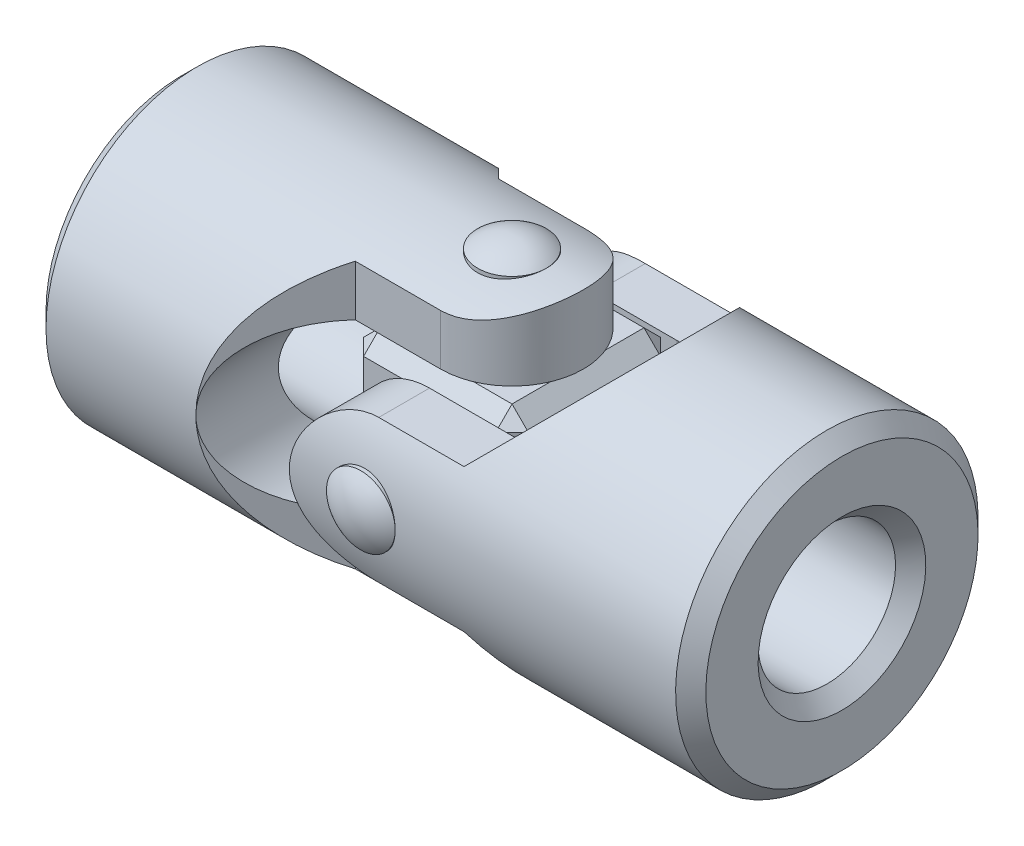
ISO-10303-21;
HEADER;
FILE_DESCRIPTION(('STEP AP214'),'2;1');
FILE_NAME('part.step','',(''),(''),'','','');
FILE_SCHEMA(('AUTOMOTIVE_DESIGN { 1 0 10303 214 1 1 1 1 }'));
ENDSEC;
DATA;
#1=APPLICATION_CONTEXT('core data for automotive mechanical design processes');
#2=APPLICATION_PROTOCOL_DEFINITION('international standard','automotive_design',2000,#1);
#3=PRODUCT_CONTEXT('',#1,'mechanical');
#4=PRODUCT('Part','Part','',(#3));
#5=PRODUCT_RELATED_PRODUCT_CATEGORY('part','',(#4));
#6=PRODUCT_DEFINITION_FORMATION('','',#4);
#7=PRODUCT_DEFINITION_CONTEXT('part definition',#1,'design');
#8=PRODUCT_DEFINITION('design','',#6,#7);
#9=PRODUCT_DEFINITION_SHAPE('','',#8);
#10=(LENGTH_UNIT() NAMED_UNIT(*) SI_UNIT(.MILLI.,.METRE.));
#11=(NAMED_UNIT(*) PLANE_ANGLE_UNIT() SI_UNIT($,.RADIAN.));
#12=(NAMED_UNIT(*) SI_UNIT($,.STERADIAN.) SOLID_ANGLE_UNIT());
#13=UNCERTAINTY_MEASURE_WITH_UNIT(LENGTH_MEASURE(1.E-05),#10,'distance_accuracy_value','');
#14=(GEOMETRIC_REPRESENTATION_CONTEXT(3) GLOBAL_UNCERTAINTY_ASSIGNED_CONTEXT((#13)) GLOBAL_UNIT_ASSIGNED_CONTEXT((#10,
#11,#12)) REPRESENTATION_CONTEXT('',''));
#15=CARTESIAN_POINT('',(0.,0.,0.));
#16=DIRECTION('',(0.,0.,1.));
#17=DIRECTION('',(1.,0.,0.));
#18=AXIS2_PLACEMENT_3D('',#15,#16,#17);
#19=CARTESIAN_POINT('',(0.,11.,0.));
#20=DIRECTION('',(0.,-1.,0.));
#21=DIRECTION('',(-1.,0.,0.));
#22=AXIS2_PLACEMENT_3D('',#19,#20,#21);
#23=CYLINDRICAL_SURFACE('',#22,2.5);
#24=CARTESIAN_POINT('',(0.,11.,0.));
#25=DIRECTION('',(0.,1.,0.));
#26=DIRECTION('',(1.,0.,0.));
#27=AXIS2_PLACEMENT_3D('',#24,#25,#26);
#28=CIRCLE('',#27,2.5);
#29=CARTESIAN_POINT('',(2.5,11.,0.));
#30=VERTEX_POINT('',#29);
#31=EDGE_CURVE('P0_E10',#30,#30,#28,.T.);
#32=ORIENTED_EDGE('',*,*,#31,.F.);
#33=EDGE_LOOP('',(#32));
#34=FACE_BOUND('',#33,.T.);
#35=CARTESIAN_POINT('',(0.,-11.,0.));
#36=DIRECTION('',(0.,-1.,0.));
#37=DIRECTION('',(0.,0.,-1.));
#38=AXIS2_PLACEMENT_3D('',#35,#36,#37);
#39=CIRCLE('',#38,2.5);
#40=CARTESIAN_POINT('',(0.,-11.,-2.5));
#41=VERTEX_POINT('',#40);
#42=EDGE_CURVE('P0_E20',#41,#41,#39,.T.);
#43=ORIENTED_EDGE('',*,*,#42,.F.);
#44=EDGE_LOOP('',(#43));
#45=FACE_BOUND('',#44,.T.);
#46=ADVANCED_FACE('P0_F14',(#34,#45),#23,.T.);
#47=CARTESIAN_POINT('',(0.,7.88886363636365,0.));
#48=DIRECTION('',(0.,-1.,0.));
#49=DIRECTION('',(0.,0.,-1.));
#50=AXIS2_PLACEMENT_3D('',#47,#48,#49);
#51=SPHERICAL_SURFACE('',#50,3.99113636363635);
#52=ORIENTED_EDGE('',*,*,#31,.T.);
#53=EDGE_LOOP('',(#52));
#54=FACE_BOUND('',#53,.T.);
#55=ADVANCED_FACE('P0_F29',(#54),#51,.T.);
#56=CARTESIAN_POINT('',(0.,-7.88886363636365,0.));
#57=DIRECTION('',(0.,1.,0.));
#58=DIRECTION('',(0.,0.,-1.));
#59=AXIS2_PLACEMENT_3D('',#56,#57,#58);
#60=SPHERICAL_SURFACE('',#59,3.99113636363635);
#61=ORIENTED_EDGE('',*,*,#42,.T.);
#62=EDGE_LOOP('',(#61));
#63=FACE_BOUND('',#62,.T.);
#64=ADVANCED_FACE('P0_F26',(#63),#60,.T.);
#65=CLOSED_SHELL('',(#46,#55,#64));
#66=MANIFOLD_SOLID_BREP('P0_B1',#65);
#67=CARTESIAN_POINT('',(0.,0.,11.));
#68=DIRECTION('',(0.,0.,-1.));
#69=DIRECTION('',(-1.,0.,0.));
#70=AXIS2_PLACEMENT_3D('',#67,#68,#69);
#71=CYLINDRICAL_SURFACE('',#70,2.5);
#72=CARTESIAN_POINT('',(0.,0.,11.));
#73=DIRECTION('',(0.,0.,1.));
#74=DIRECTION('',(1.,0.,0.));
#75=AXIS2_PLACEMENT_3D('',#72,#73,#74);
#76=CIRCLE('',#75,2.5);
#77=CARTESIAN_POINT('',(2.5,0.,11.));
#78=VERTEX_POINT('',#77);
#79=EDGE_CURVE('P1_E10',#78,#78,#76,.T.);
#80=ORIENTED_EDGE('',*,*,#79,.F.);
#81=EDGE_LOOP('',(#80));
#82=FACE_BOUND('',#81,.T.);
#83=CARTESIAN_POINT('',(0.,0.,-11.));
#84=DIRECTION('',(0.,0.,-1.));
#85=DIRECTION('',(0.,1.,0.));
#86=AXIS2_PLACEMENT_3D('',#83,#84,#85);
#87=CIRCLE('',#86,2.5);
#88=CARTESIAN_POINT('',(0.,2.5,-11.));
#89=VERTEX_POINT('',#88);
#90=EDGE_CURVE('P1_E20',#89,#89,#87,.T.);
#91=ORIENTED_EDGE('',*,*,#90,.F.);
#92=EDGE_LOOP('',(#91));
#93=FACE_BOUND('',#92,.T.);
#94=ADVANCED_FACE('P1_F14',(#82,#93),#71,.T.);
#95=CARTESIAN_POINT('',(0.,0.,7.88886363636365));
#96=DIRECTION('',(0.,0.,-1.));
#97=DIRECTION('',(0.,1.,0.));
#98=AXIS2_PLACEMENT_3D('',#95,#96,#97);
#99=SPHERICAL_SURFACE('',#98,3.99113636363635);
#100=ORIENTED_EDGE('',*,*,#79,.T.);
#101=EDGE_LOOP('',(#100));
#102=FACE_BOUND('',#101,.T.);
#103=ADVANCED_FACE('P1_F29',(#102),#99,.T.);
#104=CARTESIAN_POINT('',(0.,0.,-7.88886363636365));
#105=DIRECTION('',(0.,0.,1.));
#106=DIRECTION('',(0.,1.,0.));
#107=AXIS2_PLACEMENT_3D('',#104,#105,#106);
#108=SPHERICAL_SURFACE('',#107,3.99113636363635);
#109=ORIENTED_EDGE('',*,*,#90,.T.);
#110=EDGE_LOOP('',(#109));
#111=FACE_BOUND('',#110,.T.);
#112=ADVANCED_FACE('P1_F26',(#111),#108,.T.);
#113=CLOSED_SHELL('',(#94,#103,#112));
#114=MANIFOLD_SOLID_BREP('P1_B1',#113);
#115=CARTESIAN_POINT('',(0.,-11.,-5.2));
#116=DIRECTION('',(0.,0.,1.));
#117=DIRECTION('',(1.,0.,0.));
#118=AXIS2_PLACEMENT_3D('',#115,#116,#117);
#119=PLANE('',#118);
#120=DIRECTION('',(0.,1.,0.));
#121=VECTOR('',#120,1.);
#122=CARTESIAN_POINT('',(0.,-11.,-5.2));
#123=LINE('',#122,#121);
#124=CARTESIAN_POINT('',(0.,6.,-5.2));
#125=VERTEX_POINT('',#124);
#126=CARTESIAN_POINT('',(0.,9.69329665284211,-5.2));
#127=VERTEX_POINT('',#126);
#128=EDGE_CURVE('P2_E282',#125,#127,#123,.T.);
#129=ORIENTED_EDGE('',*,*,#128,.F.);
#130=DIRECTION('',(-1.,0.,0.));
#131=VECTOR('',#130,1.);
#132=CARTESIAN_POINT('',(0.,6.,-5.2));
#133=LINE('',#132,#131);
#134=CARTESIAN_POINT('',(-6.,6.,-5.2));
#135=VERTEX_POINT('',#134);
#136=EDGE_CURVE('P2_E132',#125,#135,#133,.T.);
#137=ORIENTED_EDGE('',*,*,#136,.T.);
#138=CARTESIAN_POINT('',(-6.00000000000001,0.,-5.2));
#139=DIRECTION('',(0.,0.,1.));
#140=DIRECTION('',(1.,0.,0.));
#141=AXIS2_PLACEMENT_3D('',#138,#139,#140);
#142=CIRCLE('',#141,6.);
#143=CARTESIAN_POINT('',(-6.20000000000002,5.99666574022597,-5.2));
#144=VERTEX_POINT('',#143);
#145=EDGE_CURVE('P2_E146',#135,#144,#142,.T.);
#146=ORIENTED_EDGE('',*,*,#145,.T.);
#147=DIRECTION('',(0.,1.,0.));
#148=VECTOR('',#147,1.);
#149=CARTESIAN_POINT('',(-6.20000000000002,-11.,-5.2));
#150=LINE('',#149,#148);
#151=CARTESIAN_POINT('',(-6.20000000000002,9.6932966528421,-5.2));
#152=VERTEX_POINT('',#151);
#153=EDGE_CURVE('P2_E289',#144,#152,#150,.T.);
#154=ORIENTED_EDGE('',*,*,#153,.T.);
#155=DIRECTION('',(1.,0.,0.));
#156=VECTOR('',#155,1.);
#157=CARTESIAN_POINT('',(-24.,9.69329665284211,-5.19999999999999));
#158=LINE('',#157,#156);
#159=EDGE_CURVE('P2_E227',#127,#152,#158,.F.);
#160=ORIENTED_EDGE('',*,*,#159,.F.);
#161=EDGE_LOOP('',(#129,#137,#146,#154,#160));
#162=FACE_BOUND('',#161,.T.);
#163=ADVANCED_FACE('P2_F16',(#162),#119,.F.);
#164=CARTESIAN_POINT('',(-6.20000000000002,-11.,-5.2));
#165=DIRECTION('',(-0.707106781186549,0.,0.707106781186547));
#166=DIRECTION('',(0.707106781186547,0.,0.707106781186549));
#167=AXIS2_PLACEMENT_3D('',#164,#165,#166);
#168=PLANE('',#167);
#169=CARTESIAN_POINT('',(-1.00000000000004,0.,0.));
#170=DIRECTION('',(-0.707106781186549,0.,0.707106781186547));
#171=DIRECTION('',(0.707106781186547,0.,0.707106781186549));
#172=AXIS2_PLACEMENT_3D('',#169,#170,#171);
#173=ELLIPSE('',#172,15.556349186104,11.);
#174=CARTESIAN_POINT('',(-12.,0.,-11.));
#175=VERTEX_POINT('',#174);
#176=CARTESIAN_POINT('',(-6.20000000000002,-9.69329665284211,-5.2));
#177=VERTEX_POINT('',#176);
#178=EDGE_CURVE('P2_E230',#175,#177,#173,.T.);
#179=ORIENTED_EDGE('',*,*,#178,.F.);
#180=CARTESIAN_POINT('',(-6.00000000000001,0.,-4.99999999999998));
#181=DIRECTION('',(-0.707106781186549,0.,0.707106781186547));
#182=DIRECTION('',(-0.707106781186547,0.,-0.707106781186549));
#183=AXIS2_PLACEMENT_3D('',#180,#181,#182);
#184=ELLIPSE('',#183,8.48528137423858,6.);
#185=CARTESIAN_POINT('',(-6.20000000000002,-5.99666574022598,-5.2));
#186=VERTEX_POINT('',#185);
#187=EDGE_CURVE('P2_E143',#175,#186,#184,.T.);
#188=ORIENTED_EDGE('',*,*,#187,.T.);
#189=EDGE_CURVE('P2_E286',#177,#186,#150,.T.);
#190=ORIENTED_EDGE('',*,*,#189,.F.);
#191=EDGE_LOOP('',(#179,#188,#190));
#192=FACE_BOUND('',#191,.T.);
#193=ADVANCED_FACE('P2_F181',(#192),#168,.F.);
#194=CARTESIAN_POINT('',(-6.20000000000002,-11.,5.2));
#195=DIRECTION('',(-0.707106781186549,0.,-0.707106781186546));
#196=DIRECTION('',(-0.707106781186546,0.,0.707106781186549));
#197=AXIS2_PLACEMENT_3D('',#194,#195,#196);
#198=PLANE('',#197);
#199=DIRECTION('',(0.,1.,0.));
#200=VECTOR('',#199,1.);
#201=CARTESIAN_POINT('',(-6.20000000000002,-11.,5.2));
#202=LINE('',#201,#200);
#203=CARTESIAN_POINT('',(-6.20000000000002,-9.69329665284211,5.2));
#204=VERTEX_POINT('',#203);
#205=CARTESIAN_POINT('',(-6.20000000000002,-5.99666574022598,5.2));
#206=VERTEX_POINT('',#205);
#207=EDGE_CURVE('P2_E39',#204,#206,#202,.T.);
#208=ORIENTED_EDGE('',*,*,#207,.T.);
#209=CARTESIAN_POINT('',(-6.00000000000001,0.,4.99999999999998));
#210=DIRECTION('',(-0.707106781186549,0.,-0.707106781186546));
#211=DIRECTION('',(0.707106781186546,0.,-0.707106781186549));
#212=AXIS2_PLACEMENT_3D('',#209,#210,#211);
#213=ELLIPSE('',#212,8.48528137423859,6.);
#214=CARTESIAN_POINT('',(-12.,0.,11.));
#215=VERTEX_POINT('',#214);
#216=EDGE_CURVE('P2_E107',#206,#215,#213,.T.);
#217=ORIENTED_EDGE('',*,*,#216,.T.);
#218=CARTESIAN_POINT('',(-1.00000000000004,0.,0.));
#219=DIRECTION('',(-0.707106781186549,0.,-0.707106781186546));
#220=DIRECTION('',(0.707106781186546,0.,-0.707106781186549));
#221=AXIS2_PLACEMENT_3D('',#218,#219,#220);
#222=ELLIPSE('',#221,15.556349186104,11.);
#223=EDGE_CURVE('P2_E241',#204,#215,#222,.T.);
#224=ORIENTED_EDGE('',*,*,#223,.F.);
#225=EDGE_LOOP('',(#208,#217,#224));
#226=FACE_BOUND('',#225,.T.);
#227=ADVANCED_FACE('P2_F185',(#226),#198,.F.);
#228=CARTESIAN_POINT('',(0.,-11.,5.2));
#229=DIRECTION('',(0.,0.,-1.));
#230=DIRECTION('',(-1.,0.,0.));
#231=AXIS2_PLACEMENT_3D('',#228,#229,#230);
#232=PLANE('',#231);
#233=CARTESIAN_POINT('',(-6.00000000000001,0.,5.2));
#234=DIRECTION('',(0.,0.,-1.));
#235=DIRECTION('',(-1.,0.,0.));
#236=AXIS2_PLACEMENT_3D('',#233,#234,#235);
#237=CIRCLE('',#236,6.);
#238=CARTESIAN_POINT('',(-6.20000000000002,5.99666574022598,5.2));
#239=VERTEX_POINT('',#238);
#240=CARTESIAN_POINT('',(-6.,6.,5.2));
#241=VERTEX_POINT('',#240);
#242=EDGE_CURVE('P2_E108',#239,#241,#237,.T.);
#243=ORIENTED_EDGE('',*,*,#242,.T.);
#244=DIRECTION('',(1.,0.,0.));
#245=VECTOR('',#244,1.);
#246=CARTESIAN_POINT('',(0.,6.,5.2));
#247=LINE('',#246,#245);
#248=CARTESIAN_POINT('',(0.,6.,5.2));
#249=VERTEX_POINT('',#248);
#250=EDGE_CURVE('P2_E129',#241,#249,#247,.T.);
#251=ORIENTED_EDGE('',*,*,#250,.T.);
#252=DIRECTION('',(0.,1.,0.));
#253=VECTOR('',#252,1.);
#254=CARTESIAN_POINT('',(0.,-11.,5.2));
#255=LINE('',#254,#253);
#256=CARTESIAN_POINT('',(0.,9.69329665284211,5.2));
#257=VERTEX_POINT('',#256);
#258=EDGE_CURVE('P2_E154',#249,#257,#255,.T.);
#259=ORIENTED_EDGE('',*,*,#258,.T.);
#260=DIRECTION('',(1.,0.,0.));
#261=VECTOR('',#260,1.);
#262=CARTESIAN_POINT('',(-24.,9.69329665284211,5.2));
#263=LINE('',#262,#261);
#264=CARTESIAN_POINT('',(-6.20000000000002,9.69329665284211,5.2));
#265=VERTEX_POINT('',#264);
#266=EDGE_CURVE('P2_E244',#265,#257,#263,.T.);
#267=ORIENTED_EDGE('',*,*,#266,.F.);
#268=EDGE_CURVE('P2_E292',#239,#265,#202,.T.);
#269=ORIENTED_EDGE('',*,*,#268,.F.);
#270=EDGE_LOOP('',(#243,#251,#259,#267,#269));
#271=FACE_BOUND('',#270,.T.);
#272=ADVANCED_FACE('P2_F188',(#271),#232,.F.);
#273=CARTESIAN_POINT('',(0.,-11.,0.));
#274=DIRECTION('',(0.,1.,0.));
#275=DIRECTION('',(0.,0.,-1.));
#276=AXIS2_PLACEMENT_3D('',#273,#274,#275);
#277=CYLINDRICAL_SURFACE('',#276,5.2);
#278=ORIENTED_EDGE('',*,*,#258,.F.);
#279=CARTESIAN_POINT('',(0.,6.,0.));
#280=DIRECTION('',(0.,1.,0.));
#281=DIRECTION('',(1.,0.,0.));
#282=AXIS2_PLACEMENT_3D('',#279,#280,#281);
#283=CIRCLE('',#282,5.2);
#284=EDGE_CURVE('P2_E109',#249,#125,#283,.T.);
#285=ORIENTED_EDGE('',*,*,#284,.T.);
#286=ORIENTED_EDGE('',*,*,#128,.T.);
#287=CARTESIAN_POINT('',(0.,9.69329665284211,5.2));
#288=CARTESIAN_POINT('',(0.137285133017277,9.69325927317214,5.20002455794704));
#289=CARTESIAN_POINT('',(0.274553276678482,9.69621198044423,5.19456447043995));
#290=CARTESIAN_POINT('',(0.547919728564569,9.70782011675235,5.17286231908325));
#291=CARTESIAN_POINT('',(0.684018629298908,9.71647246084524,5.15662608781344));
#292=CARTESIAN_POINT('',(0.95335971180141,9.73914389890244,5.11367052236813));
#293=CARTESIAN_POINT('',(1.08661306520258,9.7531348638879,5.0870061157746));
#294=CARTESIAN_POINT('',(1.35006536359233,9.78599003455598,5.02351307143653));
#295=CARTESIAN_POINT('',(1.48026400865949,9.80485471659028,4.98668344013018));
#296=CARTESIAN_POINT('',(1.73651432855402,9.8468033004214,4.90332855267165));
#297=CARTESIAN_POINT('',(1.8625740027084,9.86987841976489,4.8568234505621));
#298=CARTESIAN_POINT('',(2.11014776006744,9.91957630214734,4.75449705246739));
#299=CARTESIAN_POINT('',(2.23166009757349,9.94620041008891,4.69867222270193));
#300=CARTESIAN_POINT('',(2.58865543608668,10.0303390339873,4.51774231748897));
#301=CARTESIAN_POINT('',(2.8164985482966,10.0921028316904,4.37921408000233));
#302=CARTESIAN_POINT('',(3.26303971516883,10.2253906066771,4.05877180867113));
#303=CARTESIAN_POINT('',(3.47987046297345,10.2972976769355,3.87443675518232));
#304=CARTESIAN_POINT('',(3.88104241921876,10.4396991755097,3.47246473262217));
#305=CARTESIAN_POINT('',(4.06537549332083,10.5101932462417,3.25481945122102));
#306=CARTESIAN_POINT('',(4.31887289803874,10.6116076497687,2.90003488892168));
#307=CARTESIAN_POINT('',(4.40144852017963,10.6455560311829,2.77313315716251));
#308=CARTESIAN_POINT('',(4.5555241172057,10.7101775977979,2.5120008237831));
#309=CARTESIAN_POINT('',(4.62702842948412,10.7408520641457,2.37777312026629));
#310=CARTESIAN_POINT('',(4.75827033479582,10.7980391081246,2.10287048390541));
#311=CARTESIAN_POINT('',(4.81801043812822,10.8245525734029,1.96219693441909));
#312=CARTESIAN_POINT('',(4.92508877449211,10.8726357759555,1.67538711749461));
#313=CARTESIAN_POINT('',(4.97242816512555,10.8942059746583,1.52925136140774));
#314=CARTESIAN_POINT('',(5.05147547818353,10.9305194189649,1.24229233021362));
#315=CARTESIAN_POINT('',(5.08399677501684,10.9456141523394,1.10173734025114));
#316=CARTESIAN_POINT('',(5.13729342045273,10.9704706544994,0.817957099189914));
#317=CARTESIAN_POINT('',(5.15806977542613,10.9802328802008,0.674732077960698));
#318=CARTESIAN_POINT('',(5.187609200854,10.99414022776,0.386835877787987));
#319=CARTESIAN_POINT('',(5.19637719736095,10.9982876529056,0.242165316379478));
#320=CARTESIAN_POINT('',(5.20179985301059,11.0008506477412,-0.0474500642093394));
#321=CARTESIAN_POINT('',(5.19845515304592,10.9992665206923,-0.192394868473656));
#322=CARTESIAN_POINT('',(5.18043423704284,10.9907617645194,-0.470011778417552));
#323=CARTESIAN_POINT('',(5.16666485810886,10.9842682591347,-0.60275700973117));
#324=CARTESIAN_POINT('',(5.12902280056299,10.9666129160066,-0.86653385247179));
#325=CARTESIAN_POINT('',(5.1051469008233,10.9554495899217,-0.997564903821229));
#326=CARTESIAN_POINT('',(5.04754753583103,10.9287274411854,-1.25694073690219));
#327=CARTESIAN_POINT('',(5.01382753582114,10.9131701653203,-1.38528644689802));
#328=CARTESIAN_POINT('',(4.93687318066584,10.8780309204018,-1.63854477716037));
#329=CARTESIAN_POINT('',(4.89363518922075,10.8584474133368,-1.76345606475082));
#330=CARTESIAN_POINT('',(4.74881982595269,10.7936867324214,-2.13542747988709));
#331=CARTESIAN_POINT('',(4.63294669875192,10.7428870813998,-2.37612329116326));
#332=CARTESIAN_POINT('',(4.36720139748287,10.6309910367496,-2.83514664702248));
#333=CARTESIAN_POINT('',(4.21731623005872,10.5698907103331,-3.05346559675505));
#334=CARTESIAN_POINT('',(3.8728028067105,10.4370092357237,-3.48186110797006));
#335=CARTESIAN_POINT('',(3.67542157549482,10.3647613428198,-3.68958094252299));
#336=CARTESIAN_POINT('',(3.24880946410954,10.2212770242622,-4.0702531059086));
#337=CARTESIAN_POINT('',(3.01955504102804,10.1500413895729,-4.24317950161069));
#338=CARTESIAN_POINT('',(2.64908020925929,10.0480099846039,-4.47719536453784));
#339=CARTESIAN_POINT('',(2.51751455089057,10.0140244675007,-4.5524934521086));
#340=CARTESIAN_POINT('',(2.24763801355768,9.94960944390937,-4.69160309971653));
#341=CARTESIAN_POINT('',(2.10933012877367,9.91917837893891,-4.75541970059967));
#342=CARTESIAN_POINT('',(1.82705012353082,9.86301283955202,-4.87084180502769));
#343=CARTESIAN_POINT('',(1.68308751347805,9.83727085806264,-4.922466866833));
#344=CARTESIAN_POINT('',(1.39041843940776,9.79144379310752,-5.01300298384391));
#345=CARTESIAN_POINT('',(1.24171408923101,9.7713562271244,-5.05191961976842));
#346=CARTESIAN_POINT('',(0.912815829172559,9.73457266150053,-5.12249906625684));
#347=CARTESIAN_POINT('',(0.731882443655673,9.71919007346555,-5.15149104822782));
#348=CARTESIAN_POINT('',(0.458549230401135,9.70370762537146,-5.18055614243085));
#349=CARTESIAN_POINT('',(0.36706241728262,9.69981199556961,-5.18784072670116));
#350=CARTESIAN_POINT('',(0.1837254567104,9.6946038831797,-5.19756406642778));
#351=CARTESIAN_POINT('',(0.0918751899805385,9.69329233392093,-5.20000107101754));
#352=CARTESIAN_POINT('',(0.,9.69329665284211,-5.2));
#353=B_SPLINE_CURVE_WITH_KNOTS('',3,(#287,#288,#289,#290,#291,#292,#293,#294,#295,#296,#297,
#298,#299,#300,#301,#302,#303,#304,#305,#306,#307,#308,#309,#310,#311,#312,#313,#314,#315,#316,
#317,#318,#319,#320,#321,#322,#323,#324,#325,#326,#327,#328,#329,#330,#331,#332,#333,#334,#335,
#336,#337,#338,#339,#340,#341,#342,#343,#344,#345,#346,#347,#348,#349,#350,#351,#352),
.UNSPECIFIED.,.F.,.F.,(4,2,2,2,2,2,2,2,2,2,2,2,2,2,2,2,2,2,2,2,2,2,2,2,2,2,2,2,2,2,2,2,4),(0.,
0.411688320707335,0.82315399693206,1.2324809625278,1.64184795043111,2.0503706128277,
2.459048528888,3.27671515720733,4.15379218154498,5.03108843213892,5.49607293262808,
5.96087480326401,6.42557738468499,6.8902365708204,7.32482324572,7.7593726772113,
8.19374379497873,8.6280919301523,9.02846455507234,9.4289648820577,9.82932439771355,
10.2298371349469,11.0418659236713,11.8542054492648,12.7369930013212,13.6204361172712,
14.0859833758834,14.5513257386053,15.0159164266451,15.4803028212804,16.0305352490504,
16.3059707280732,16.5815056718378),.UNSPECIFIED.);
#354=EDGE_CURVE('P2_E203',#257,#127,#353,.T.);
#355=ORIENTED_EDGE('',*,*,#354,.F.);
#356=EDGE_LOOP('',(#278,#285,#286,#355));
#357=FACE_BOUND('',#356,.T.);
#358=ADVANCED_FACE('P2_F192',(#357),#277,.T.);
#359=CARTESIAN_POINT('',(-24.,0.,0.));
#360=DIRECTION('',(-1.,0.,0.));
#361=DIRECTION('',(0.,0.,1.));
#362=AXIS2_PLACEMENT_3D('',#359,#360,#361);
#363=PLANE('',#362);
#364=CARTESIAN_POINT('',(-24.,0.,0.));
#365=DIRECTION('',(-1.,0.,0.));
#366=DIRECTION('',(0.,0.,1.));
#367=AXIS2_PLACEMENT_3D('',#364,#365,#366);
#368=CIRCLE('',#367,6.1);
#369=CARTESIAN_POINT('',(-24.,0.,6.1));
#370=VERTEX_POINT('',#369);
#371=EDGE_CURVE('P2_E24',#370,#370,#368,.F.);
#372=ORIENTED_EDGE('',*,*,#371,.T.);
#373=EDGE_LOOP('',(#372));
#374=FACE_BOUND('',#373,.T.);
#375=CARTESIAN_POINT('',(-24.,0.,0.));
#376=DIRECTION('',(-1.,0.,0.));
#377=DIRECTION('',(0.,0.,1.));
#378=AXIS2_PLACEMENT_3D('',#375,#376,#377);
#379=CIRCLE('',#378,9.89999999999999);
#380=CARTESIAN_POINT('',(-24.,0.,9.89999999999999));
#381=VERTEX_POINT('',#380);
#382=EDGE_CURVE('P2_E254',#381,#381,#379,.T.);
#383=ORIENTED_EDGE('',*,*,#382,.T.);
#384=EDGE_LOOP('',(#383));
#385=FACE_BOUND('',#384,.T.);
#386=ADVANCED_FACE('P2_F213',(#374,#385),#363,.T.);
#387=CARTESIAN_POINT('',(-24.,0.,0.));
#388=DIRECTION('',(1.,0.,0.));
#389=DIRECTION('',(0.,0.,-1.));
#390=AXIS2_PLACEMENT_3D('',#387,#388,#389);
#391=CYLINDRICAL_SURFACE('',#390,11.);
#392=CARTESIAN_POINT('',(-22.9,0.,0.));
#393=DIRECTION('',(-1.,0.,0.));
#394=DIRECTION('',(0.,0.,1.));
#395=AXIS2_PLACEMENT_3D('',#392,#393,#394);
#396=CIRCLE('',#395,11.);
#397=CARTESIAN_POINT('',(-22.9,0.,11.));
#398=VERTEX_POINT('',#397);
#399=EDGE_CURVE('P2_E11',#398,#398,#396,.F.);
#400=ORIENTED_EDGE('',*,*,#399,.T.);
#401=EDGE_LOOP('',(#400));
#402=FACE_BOUND('',#401,.T.);
#403=CARTESIAN_POINT('',(2.5,-11.,0.));
#404=CARTESIAN_POINT('',(2.49999546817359,-10.9999974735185,-0.138518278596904));
#405=CARTESIAN_POINT('',(2.48844877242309,-10.9973570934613,-0.277090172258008));
#406=CARTESIAN_POINT('',(2.44262052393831,-10.987079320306,-0.550288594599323));
#407=CARTESIAN_POINT('',(2.40832360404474,-10.9794385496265,-0.68491239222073));
#408=CARTESIAN_POINT('',(2.31813195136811,-10.9600095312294,-0.946227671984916));
#409=CARTESIAN_POINT('',(2.26226067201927,-10.9482257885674,-1.07292759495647));
#410=CARTESIAN_POINT('',(2.13058288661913,-10.921778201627,-1.31515227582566));
#411=CARTESIAN_POINT('',(2.05477657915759,-10.9071143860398,-1.43067714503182));
#412=CARTESIAN_POINT('',(1.88399795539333,-10.8762265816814,-1.64926760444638));
#413=CARTESIAN_POINT('',(1.78874742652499,-10.8599819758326,-1.75211293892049));
#414=CARTESIAN_POINT('',(1.58238102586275,-10.827906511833,-1.9405138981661));
#415=CARTESIAN_POINT('',(1.47126364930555,-10.8120756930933,-2.02606788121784));
#416=CARTESIAN_POINT('',(1.23466794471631,-10.7824158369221,-2.17844599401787));
#417=CARTESIAN_POINT('',(1.10903300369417,-10.7686131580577,-2.24503254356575));
#418=CARTESIAN_POINT('',(0.847990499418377,-10.7448696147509,-2.3560606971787));
#419=CARTESIAN_POINT('',(0.71258420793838,-10.7349282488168,-2.40050517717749));
#420=CARTESIAN_POINT('',(0.438240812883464,-10.7202434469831,-2.46525349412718));
#421=CARTESIAN_POINT('',(0.299400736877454,-10.715415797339,-2.48594892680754));
#422=CARTESIAN_POINT('',(0.0201417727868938,-10.7112523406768,-2.50382988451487));
#423=CARTESIAN_POINT('',(-0.120276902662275,-10.711915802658,-2.50101853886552));
#424=CARTESIAN_POINT('',(-0.395772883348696,-10.7185835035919,-2.47228016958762));
#425=CARTESIAN_POINT('',(-0.53090090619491,-10.7244819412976,-2.44681104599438));
#426=CARTESIAN_POINT('',(-0.794914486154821,-10.7407873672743,-2.37420684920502));
#427=CARTESIAN_POINT('',(-0.923799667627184,-10.7511946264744,-2.32707047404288));
#428=CARTESIAN_POINT('',(-1.17294067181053,-10.7754474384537,-2.21205734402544));
#429=CARTESIAN_POINT('',(-1.29311351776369,-10.7893215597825,-2.14400712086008));
#430=CARTESIAN_POINT('',(-1.52050255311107,-10.8189276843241,-1.98921977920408));
#431=CARTESIAN_POINT('',(-1.62771684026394,-10.8346599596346,-1.90247992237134));
#432=CARTESIAN_POINT('',(-1.82877856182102,-10.8666615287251,-1.71036518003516));
#433=CARTESIAN_POINT('',(-1.92225442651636,-10.882934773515,-1.60460166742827));
#434=CARTESIAN_POINT('',(-2.09020588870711,-10.9138502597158,-1.37871229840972));
#435=CARTESIAN_POINT('',(-2.16468108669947,-10.9284924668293,-1.2585861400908));
#436=CARTESIAN_POINT('',(-2.2926203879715,-10.9545497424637,-1.00690799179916));
#437=CARTESIAN_POINT('',(-2.34603277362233,-10.9659568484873,-0.875328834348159));
#438=CARTESIAN_POINT('',(-2.42988400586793,-10.9841998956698,-0.604745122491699));
#439=CARTESIAN_POINT('',(-2.46032646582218,-10.9910365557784,-0.465741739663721));
#440=CARTESIAN_POINT('',(-2.49682623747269,-10.9992650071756,-0.187439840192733));
#441=CARTESIAN_POINT('',(-2.50339069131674,-11.0007700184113,-0.0482110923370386));
#442=CARTESIAN_POINT('',(-2.49332696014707,-10.9984842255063,0.229353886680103));
#443=CARTESIAN_POINT('',(-2.47670048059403,-10.9946938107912,0.367690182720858));
#444=CARTESIAN_POINT('',(-2.42114683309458,-10.9823148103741,0.637841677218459));
#445=CARTESIAN_POINT('',(-2.38248845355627,-10.973784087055,0.769715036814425));
#446=CARTESIAN_POINT('',(-2.28426897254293,-10.9528806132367,1.0251039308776));
#447=CARTESIAN_POINT('',(-2.22470599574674,-10.9405075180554,1.14861871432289));
#448=CARTESIAN_POINT('',(-2.08533085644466,-10.9130143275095,1.38586085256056));
#449=CARTESIAN_POINT('',(-2.00522437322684,-10.8978552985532,1.49941068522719));
#450=CARTESIAN_POINT('',(-1.8274206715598,-10.866546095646,1.71163773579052));
#451=CARTESIAN_POINT('',(-1.72972097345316,-10.8503957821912,1.8103128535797));
#452=CARTESIAN_POINT('',(-1.51716903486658,-10.8185287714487,1.99201706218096));
#453=CARTESIAN_POINT('',(-1.40201275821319,-10.8028272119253,2.07469366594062));
#454=CARTESIAN_POINT('',(-1.15915360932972,-10.7740023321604,2.21953814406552));
#455=CARTESIAN_POINT('',(-1.03145129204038,-10.7608788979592,2.28170692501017));
#456=CARTESIAN_POINT('',(-0.767819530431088,-10.7388274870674,2.38333597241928));
#457=CARTESIAN_POINT('',(-0.631942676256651,-10.7298753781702,2.42292716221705));
#458=CARTESIAN_POINT('',(-0.355233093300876,-10.7171411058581,2.47865258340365));
#459=CARTESIAN_POINT('',(-0.214401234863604,-10.7133580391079,2.49479091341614));
#460=CARTESIAN_POINT('',(0.064658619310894,-10.7114502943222,2.50296739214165));
#461=CARTESIAN_POINT('',(0.202869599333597,-10.7131941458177,2.4955654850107));
#462=CARTESIAN_POINT('',(0.476018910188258,-10.7218446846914,2.45813115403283));
#463=CARTESIAN_POINT('',(0.610957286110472,-10.7287513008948,2.42809904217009));
#464=CARTESIAN_POINT('',(0.873243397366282,-10.7468826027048,2.34653692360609));
#465=CARTESIAN_POINT('',(1.0006196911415,-10.758089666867,2.29509457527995));
#466=CARTESIAN_POINT('',(1.24501470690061,-10.783564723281,2.1722453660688));
#467=CARTESIAN_POINT('',(1.36203225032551,-10.7978330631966,2.10083623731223));
#468=CARTESIAN_POINT('',(1.58513442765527,-10.828211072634,1.93824996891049));
#469=CARTESIAN_POINT('',(1.69092572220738,-10.8443540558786,1.84667645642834));
#470=CARTESIAN_POINT('',(1.88582318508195,-10.8764454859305,1.64715628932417));
#471=CARTESIAN_POINT('',(1.97492547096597,-10.8923938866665,1.53920583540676));
#472=CARTESIAN_POINT('',(2.13513806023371,-10.9225693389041,1.30814060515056));
#473=CARTESIAN_POINT('',(2.20597382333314,-10.9367686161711,1.1848316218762));
#474=CARTESIAN_POINT('',(2.32579997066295,-10.9615640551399,0.927755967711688));
#475=CARTESIAN_POINT('',(2.37480799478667,-10.9721631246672,0.793997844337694));
#476=CARTESIAN_POINT('',(2.44122790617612,-10.9867559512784,0.550163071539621));
#477=CARTESIAN_POINT('',(2.46322398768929,-10.9916908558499,0.441368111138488));
#478=CARTESIAN_POINT('',(2.49261147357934,-10.9983138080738,0.221726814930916));
#479=CARTESIAN_POINT('',(2.50000362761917,-11.0000020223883,0.110880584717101));
#480=CARTESIAN_POINT('',(2.5,-11.,0.));
#481=B_SPLINE_CURVE_WITH_KNOTS('',3,(#403,#404,#405,#406,#407,#408,#409,#410,#411,#412,#413,
#414,#415,#416,#417,#418,#419,#420,#421,#422,#423,#424,#425,#426,#427,#428,#429,#430,#431,#432,
#433,#434,#435,#436,#437,#438,#439,#440,#441,#442,#443,#444,#445,#446,#447,#448,#449,#450,#451,
#452,#453,#454,#455,#456,#457,#458,#459,#460,#461,#462,#463,#464,#465,#466,#467,#468,#469,#470,
#471,#472,#473,#474,#475,#476,#477,#478,#479,#480),.UNSPECIFIED.,.T.,.F.,(4,2,2,2,2,2,2,2,2,2,2,
2,2,2,2,2,2,2,2,2,2,2,2,2,2,2,2,2,2,2,2,2,2,2,2,2,2,2,4),(0.,0.415148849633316,
0.830578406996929,1.24555761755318,1.66053269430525,2.08192389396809,2.50335508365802,
2.92985362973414,3.35629676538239,3.77560244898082,4.19485231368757,4.60581714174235,
5.01680666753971,5.4313015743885,5.84585725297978,6.27011531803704,6.69438230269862,
7.11968464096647,7.54492006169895,7.96106941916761,8.37718817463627,8.78833576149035,
9.19952024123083,9.61696129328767,10.0344612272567,10.4603132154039,10.8861463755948,
11.3094844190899,11.732748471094,12.1460204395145,12.5592867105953,12.9708773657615,
13.382514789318,13.8031102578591,14.2238034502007,14.6504927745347,15.0768366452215,
15.4091704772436,15.74148724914),.UNSPECIFIED.);
#482=CARTESIAN_POINT('',(2.5,-11.,0.));
#483=VERTEX_POINT('',#482);
#484=EDGE_CURVE('P2_E222',#483,#483,#481,.T.);
#485=ORIENTED_EDGE('',*,*,#484,.T.);
#486=EDGE_LOOP('',(#485));
#487=FACE_BOUND('',#486,.T.);
#488=CARTESIAN_POINT('',(0.,10.7121426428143,-2.5));
#489=CARTESIAN_POINT('',(0.138466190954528,10.7121454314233,-2.49999543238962));
#490=CARTESIAN_POINT('',(0.276986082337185,10.7148566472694,-2.48845712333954));
#491=CARTESIAN_POINT('',(0.550076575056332,10.7253866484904,-2.44266520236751));
#492=CARTESIAN_POINT('',(0.684644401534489,10.7332089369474,-2.40839601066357));
#493=CARTESIAN_POINT('',(0.945841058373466,10.7530304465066,-2.31828540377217));
#494=CARTESIAN_POINT('',(1.07247880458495,10.7650248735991,-2.26246873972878));
#495=CARTESIAN_POINT('',(1.31459839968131,10.7918333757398,-2.13091974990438));
#496=CARTESIAN_POINT('',(1.43008029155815,10.8066474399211,-2.05518750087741));
#497=CARTESIAN_POINT('',(1.6487154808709,10.8377278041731,-1.88448528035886));
#498=CARTESIAN_POINT('',(1.75163578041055,10.8540139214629,-1.78922044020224));
#499=CARTESIAN_POINT('',(1.94018250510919,10.8860302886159,-1.58279346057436));
#500=CARTESIAN_POINT('',(2.02580751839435,10.9017604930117,-1.4716300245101));
#501=CARTESIAN_POINT('',(2.17826304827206,10.93110941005,-1.23499021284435));
#502=CARTESIAN_POINT('',(2.24486820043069,10.9447020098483,-1.10936512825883));
#503=CARTESIAN_POINT('',(2.35593341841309,10.9680197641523,-0.848343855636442));
#504=CARTESIAN_POINT('',(2.40039617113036,10.9777453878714,-0.712948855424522));
#505=CARTESIAN_POINT('',(2.4651780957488,10.992093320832,-0.438655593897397));
#506=CARTESIAN_POINT('',(2.48589197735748,10.9967989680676,-0.299854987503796));
#507=CARTESIAN_POINT('',(2.5038235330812,11.0008659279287,-0.0206744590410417));
#508=CARTESIAN_POINT('',(2.50104410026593,11.0002278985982,0.119705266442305));
#509=CARTESIAN_POINT('',(2.47235927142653,10.9937426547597,0.395333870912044));
#510=CARTESIAN_POINT('',(2.44687947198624,10.9879913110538,0.53062963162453));
#511=CARTESIAN_POINT('',(2.37419692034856,10.972035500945,0.794973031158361));
#512=CARTESIAN_POINT('',(2.32699313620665,10.9618308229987,0.92402037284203));
#513=CARTESIAN_POINT('',(2.21183459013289,10.9379627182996,1.17336944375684));
#514=CARTESIAN_POINT('',(2.14372109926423,10.9242729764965,1.29359524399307));
#515=CARTESIAN_POINT('',(1.9887954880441,10.8949317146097,1.52106399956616));
#516=CARTESIAN_POINT('',(1.90198063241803,10.8792799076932,1.62830505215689));
#517=CARTESIAN_POINT('',(1.7098085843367,10.8473171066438,1.82929354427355));
#518=CARTESIAN_POINT('',(1.60407898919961,10.8309992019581,1.92268414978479));
#519=CARTESIAN_POINT('',(1.37828918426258,10.7998704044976,2.09047920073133));
#520=CARTESIAN_POINT('',(1.25822852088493,10.7850595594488,2.16488304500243));
#521=CARTESIAN_POINT('',(1.00657601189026,10.7586016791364,2.29276887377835));
#522=CARTESIAN_POINT('',(0.874946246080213,10.7469656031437,2.3461786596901));
#523=CARTESIAN_POINT('',(0.604251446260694,10.7283231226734,2.43000958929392));
#524=CARTESIAN_POINT('',(0.465187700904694,10.7213159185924,2.46043470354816));
#525=CARTESIAN_POINT('',(0.186845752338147,10.7128889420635,2.49686920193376));
#526=CARTESIAN_POINT('',(0.0476393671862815,10.7113498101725,2.50340025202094));
#527=CARTESIAN_POINT('',(-0.229873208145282,10.7137104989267,2.49327772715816));
#528=CARTESIAN_POINT('',(-0.368179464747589,10.7176099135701,2.47662588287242));
#529=CARTESIAN_POINT('',(-0.638118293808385,10.7302951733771,2.42106417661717));
#530=CARTESIAN_POINT('',(-0.769814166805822,10.7390169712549,2.38244586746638));
#531=CARTESIAN_POINT('',(-1.02486559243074,10.7603057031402,2.28436509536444));
#532=CARTESIAN_POINT('',(-1.14822029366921,10.7728730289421,2.22490050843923));
#533=CARTESIAN_POINT('',(-1.38533303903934,10.8006961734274,2.08568096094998));
#534=CARTESIAN_POINT('',(-1.49889893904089,10.8159929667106,2.00560710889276));
#535=CARTESIAN_POINT('',(-1.71117330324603,10.847445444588,1.82785558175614));
#536=CARTESIAN_POINT('',(-1.80987976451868,10.8636012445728,1.73017553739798));
#537=CARTESIAN_POINT('',(-1.99168109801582,10.8953477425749,1.51761489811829));
#538=CARTESIAN_POINT('',(-2.07441892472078,10.9109203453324,1.40242575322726));
#539=CARTESIAN_POINT('',(-2.21937081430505,10.9394030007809,1.159481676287));
#540=CARTESIAN_POINT('',(-2.28158587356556,10.9523131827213,1.03172735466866));
#541=CARTESIAN_POINT('',(-2.38324041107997,10.9739405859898,0.768105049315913));
#542=CARTESIAN_POINT('',(-2.42283032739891,10.9826854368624,0.632297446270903));
#543=CARTESIAN_POINT('',(-2.47857654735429,10.9951167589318,0.355736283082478));
#544=CARTESIAN_POINT('',(-2.4947365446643,10.9988040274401,0.214983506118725));
#545=CARTESIAN_POINT('',(-2.50298711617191,11.0006787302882,-0.064092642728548));
#546=CARTESIAN_POINT('',(-2.49560907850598,10.9989875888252,-0.202399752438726));
#547=CARTESIAN_POINT('',(-2.45818905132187,10.9905580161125,-0.475747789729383));
#548=CARTESIAN_POINT('',(-2.42814753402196,10.9838196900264,-0.610788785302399));
#549=CARTESIAN_POINT('',(-2.3465163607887,10.96606448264,-0.873322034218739));
#550=CARTESIAN_POINT('',(-2.29500755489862,10.9550636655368,-1.00084058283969));
#551=CARTESIAN_POINT('',(-2.17198077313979,10.9299536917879,-1.24549315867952));
#552=CARTESIAN_POINT('',(-2.10046069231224,10.9158442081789,-1.36262609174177));
#553=CARTESIAN_POINT('',(-1.93773803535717,10.8856935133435,-1.58575630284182));
#554=CARTESIAN_POINT('',(-1.84616508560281,10.8696188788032,-1.69147898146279));
#555=CARTESIAN_POINT('',(-1.64667602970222,10.8375213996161,-1.88623829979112));
#556=CARTESIAN_POINT('',(-1.53875594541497,10.8214985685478,-1.97527086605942));
#557=CARTESIAN_POINT('',(-1.30772800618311,10.7910549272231,-2.13539007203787));
#558=CARTESIAN_POINT('',(-1.18442028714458,10.7766611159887,-2.2061937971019));
#559=CARTESIAN_POINT('',(-0.927351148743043,10.7514502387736,-2.32596037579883));
#560=CARTESIAN_POINT('',(-0.793598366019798,10.7406302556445,-2.37494105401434));
#561=CARTESIAN_POINT('',(-0.549832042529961,10.72571344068,-2.44129910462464));
#562=CARTESIAN_POINT('',(-0.441103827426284,10.7206593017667,-2.46326828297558));
#563=CARTESIAN_POINT('',(-0.221595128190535,10.7138728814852,-2.49262014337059));
#564=CARTESIAN_POINT('',(-0.110814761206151,10.712140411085,-2.50000365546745));
#565=CARTESIAN_POINT('',(0.,10.7121426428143,-2.5));
#566=B_SPLINE_CURVE_WITH_KNOTS('',3,(#488,#489,#490,#491,#492,#493,#494,#495,#496,#497,#498,
#499,#500,#501,#502,#503,#504,#505,#506,#507,#508,#509,#510,#511,#512,#513,#514,#515,#516,#517,
#518,#519,#520,#521,#522,#523,#524,#525,#526,#527,#528,#529,#530,#531,#532,#533,#534,#535,#536,
#537,#538,#539,#540,#541,#542,#543,#544,#545,#546,#547,#548,#549,#550,#551,#552,#553,#554,#555,
#556,#557,#558,#559,#560,#561,#562,#563,#564,#565),.UNSPECIFIED.,.T.,.F.,(4,2,2,2,2,2,2,2,2,2,2,
2,2,2,2,2,2,2,2,2,2,2,2,2,2,2,2,2,2,2,2,2,2,2,2,2,2,2,4),(0.,0.414992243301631,0.83026921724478,
1.2450705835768,1.65987035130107,2.08146637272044,2.5030967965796,2.92953338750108,
3.35591821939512,3.77510878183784,4.1942477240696,4.60569006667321,5.01715195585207,
5.43181796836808,5.84654467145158,6.27057865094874,6.69462605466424,7.12011925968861,
7.54553894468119,7.96161330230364,8.37765660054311,8.78830262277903,9.19899049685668,
9.6164612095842,10.0339881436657,10.4599792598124,10.8859496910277,11.3090538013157,
11.7320912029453,12.1456463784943,12.5591929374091,12.9711958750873,13.3832421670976,
13.8036601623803,14.2241806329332,14.6508801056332,15.0772304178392,15.4093684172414,
15.7414875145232),.UNSPECIFIED.);
#567=CARTESIAN_POINT('',(0.,10.7121426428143,-2.5));
#568=VERTEX_POINT('',#567);
#569=EDGE_CURVE('P2_E217',#568,#568,#566,.T.);
#570=ORIENTED_EDGE('',*,*,#569,.T.);
#571=EDGE_LOOP('',(#570));
#572=FACE_BOUND('',#571,.T.);
#573=ORIENTED_EDGE('',*,*,#266,.T.);
#574=ORIENTED_EDGE('',*,*,#354,.T.);
#575=ORIENTED_EDGE('',*,*,#159,.T.);
#576=EDGE_CURVE('P2_E231',#152,#175,#173,.T.);
#577=ORIENTED_EDGE('',*,*,#576,.T.);
#578=ORIENTED_EDGE('',*,*,#178,.T.);
#579=DIRECTION('',(1.,0.,0.));
#580=VECTOR('',#579,1.);
#581=CARTESIAN_POINT('',(-24.,-9.69329665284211,-5.19999999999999));
#582=LINE('',#581,#580);
#583=CARTESIAN_POINT('',(0.,-9.69329665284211,-5.2));
#584=VERTEX_POINT('',#583);
#585=EDGE_CURVE('P2_E234',#177,#584,#582,.T.);
#586=ORIENTED_EDGE('',*,*,#585,.T.);
#587=CARTESIAN_POINT('',(0.,-9.69329665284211,-5.2));
#588=CARTESIAN_POINT('',(0.137285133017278,-9.69325927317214,-5.20002455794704));
#589=CARTESIAN_POINT('',(0.274553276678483,-9.69621198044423,-5.19456447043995));
#590=CARTESIAN_POINT('',(0.547919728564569,-9.70782011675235,-5.17286231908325));
#591=CARTESIAN_POINT('',(0.684018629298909,-9.71647246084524,-5.15662608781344));
#592=CARTESIAN_POINT('',(0.953359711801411,-9.73914389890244,-5.11367052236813));
#593=CARTESIAN_POINT('',(1.08661306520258,-9.7531348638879,-5.0870061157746));
#594=CARTESIAN_POINT('',(1.35006536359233,-9.78599003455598,-5.02351307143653));
#595=CARTESIAN_POINT('',(1.48026400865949,-9.80485471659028,-4.98668344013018));
#596=CARTESIAN_POINT('',(1.73651432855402,-9.8468033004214,-4.90332855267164));
#597=CARTESIAN_POINT('',(1.8625740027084,-9.86987841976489,-4.8568234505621));
#598=CARTESIAN_POINT('',(2.11014776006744,-9.91957630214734,-4.75449705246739));
#599=CARTESIAN_POINT('',(2.23166009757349,-9.94620041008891,-4.69867222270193));
#600=CARTESIAN_POINT('',(2.58865543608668,-10.0303390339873,-4.51774231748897));
#601=CARTESIAN_POINT('',(2.8164985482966,-10.0921028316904,-4.37921408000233));
#602=CARTESIAN_POINT('',(3.26303971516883,-10.2253906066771,-4.05877180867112));
#603=CARTESIAN_POINT('',(3.47987046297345,-10.2972976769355,-3.87443675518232));
#604=CARTESIAN_POINT('',(3.88104241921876,-10.4396991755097,-3.47246473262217));
#605=CARTESIAN_POINT('',(4.06537549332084,-10.5101932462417,-3.25481945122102));
#606=CARTESIAN_POINT('',(4.31887289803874,-10.6116076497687,-2.90003488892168));
#607=CARTESIAN_POINT('',(4.40144852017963,-10.6455560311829,-2.7731331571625));
#608=CARTESIAN_POINT('',(4.5555241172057,-10.7101775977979,-2.51200082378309));
#609=CARTESIAN_POINT('',(4.62702842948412,-10.7408520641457,-2.37777312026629));
#610=CARTESIAN_POINT('',(4.75827033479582,-10.7980391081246,-2.10287048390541));
#611=CARTESIAN_POINT('',(4.81801043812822,-10.8245525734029,-1.96219693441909));
#612=CARTESIAN_POINT('',(4.92508877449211,-10.8726357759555,-1.67538711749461));
#613=CARTESIAN_POINT('',(4.97242816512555,-10.8942059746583,-1.52925136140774));
#614=CARTESIAN_POINT('',(5.05147547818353,-10.9305194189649,-1.24229233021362));
#615=CARTESIAN_POINT('',(5.08399677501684,-10.9456141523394,-1.10173734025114));
#616=CARTESIAN_POINT('',(5.13729342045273,-10.9704706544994,-0.817957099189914));
#617=CARTESIAN_POINT('',(5.15806977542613,-10.9802328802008,-0.674732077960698));
#618=CARTESIAN_POINT('',(5.187609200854,-10.99414022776,-0.386835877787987));
#619=CARTESIAN_POINT('',(5.19637719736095,-10.9982876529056,-0.242165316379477));
#620=CARTESIAN_POINT('',(5.20179985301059,-11.0008506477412,0.0474500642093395));
#621=CARTESIAN_POINT('',(5.19845515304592,-10.9992665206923,0.192394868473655));
#622=CARTESIAN_POINT('',(5.18043423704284,-10.9907617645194,0.47001177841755));
#623=CARTESIAN_POINT('',(5.16666485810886,-10.9842682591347,0.602757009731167));
#624=CARTESIAN_POINT('',(5.12902280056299,-10.9666129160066,0.866533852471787));
#625=CARTESIAN_POINT('',(5.1051469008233,-10.9554495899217,0.997564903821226));
#626=CARTESIAN_POINT('',(5.04754753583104,-10.9287274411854,1.25694073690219));
#627=CARTESIAN_POINT('',(5.01382753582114,-10.9131701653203,1.38528644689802));
#628=CARTESIAN_POINT('',(4.93687318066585,-10.8780309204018,1.63854477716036));
#629=CARTESIAN_POINT('',(4.89363518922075,-10.8584474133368,1.76345606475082));
#630=CARTESIAN_POINT('',(4.74881982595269,-10.7936867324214,2.13542747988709));
#631=CARTESIAN_POINT('',(4.63294669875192,-10.7428870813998,2.37612329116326));
#632=CARTESIAN_POINT('',(4.36720139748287,-10.6309910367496,2.83514664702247));
#633=CARTESIAN_POINT('',(4.21731623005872,-10.5698907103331,3.05346559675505));
#634=CARTESIAN_POINT('',(3.8728028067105,-10.4370092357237,3.48186110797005));
#635=CARTESIAN_POINT('',(3.67542157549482,-10.3647613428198,3.68958094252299));
#636=CARTESIAN_POINT('',(3.24880946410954,-10.2212770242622,4.07025310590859));
#637=CARTESIAN_POINT('',(3.01955504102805,-10.1500413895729,4.24317950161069));
#638=CARTESIAN_POINT('',(2.64908020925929,-10.0480099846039,4.47719536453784));
#639=CARTESIAN_POINT('',(2.51751455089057,-10.0140244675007,4.5524934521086));
#640=CARTESIAN_POINT('',(2.24763801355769,-9.94960944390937,4.69160309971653));
#641=CARTESIAN_POINT('',(2.10933012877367,-9.91917837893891,4.75541970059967));
#642=CARTESIAN_POINT('',(1.82705012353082,-9.86301283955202,4.87084180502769));
#643=CARTESIAN_POINT('',(1.68308751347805,-9.83727085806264,4.92246686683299));
#644=CARTESIAN_POINT('',(1.39041843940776,-9.79144379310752,5.01300298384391));
#645=CARTESIAN_POINT('',(1.24171408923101,-9.7713562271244,5.05191961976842));
#646=CARTESIAN_POINT('',(0.912815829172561,-9.73457266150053,5.12249906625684));
#647=CARTESIAN_POINT('',(0.731882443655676,-9.71919007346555,5.15149104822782));
#648=CARTESIAN_POINT('',(0.458549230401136,-9.70370762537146,5.18055614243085));
#649=CARTESIAN_POINT('',(0.367062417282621,-9.69981199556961,5.18784072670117));
#650=CARTESIAN_POINT('',(0.183725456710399,-9.6946038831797,5.19756406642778));
#651=CARTESIAN_POINT('',(0.0918751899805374,-9.69329233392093,5.20000107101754));
#652=CARTESIAN_POINT('',(0.,-9.69329665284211,5.2));
#653=B_SPLINE_CURVE_WITH_KNOTS('',3,(#587,#588,#589,#590,#591,#592,#593,#594,#595,#596,#597,
#598,#599,#600,#601,#602,#603,#604,#605,#606,#607,#608,#609,#610,#611,#612,#613,#614,#615,#616,
#617,#618,#619,#620,#621,#622,#623,#624,#625,#626,#627,#628,#629,#630,#631,#632,#633,#634,#635,
#636,#637,#638,#639,#640,#641,#642,#643,#644,#645,#646,#647,#648,#649,#650,#651,#652),
.UNSPECIFIED.,.F.,.F.,(4,2,2,2,2,2,2,2,2,2,2,2,2,2,2,2,2,2,2,2,2,2,2,2,2,2,2,2,2,2,2,2,4),(0.,
0.411688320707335,0.82315399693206,1.2324809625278,1.64184795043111,2.0503706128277,
2.459048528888,3.27671515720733,4.15379218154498,5.03108843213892,5.49607293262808,
5.96087480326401,6.42557738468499,6.8902365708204,7.32482324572,7.7593726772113,
8.19374379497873,8.6280919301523,9.02846455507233,9.4289648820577,9.82932439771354,
10.2298371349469,11.0418659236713,11.8542054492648,12.7369930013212,13.6204361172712,
14.0859833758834,14.5513257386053,15.0159164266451,15.4803028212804,16.0305352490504,
16.3059707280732,16.5815056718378),.UNSPECIFIED.);
#654=CARTESIAN_POINT('',(0.,-9.69329665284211,5.2));
#655=VERTEX_POINT('',#654);
#656=EDGE_CURVE('P2_E196',#584,#655,#653,.T.);
#657=ORIENTED_EDGE('',*,*,#656,.T.);
#658=DIRECTION('',(1.,0.,0.));
#659=VECTOR('',#658,1.);
#660=CARTESIAN_POINT('',(-24.,-9.69329665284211,5.2));
#661=LINE('',#660,#659);
#662=EDGE_CURVE('P2_E237',#655,#204,#661,.F.);
#663=ORIENTED_EDGE('',*,*,#662,.T.);
#664=ORIENTED_EDGE('',*,*,#223,.T.);
#665=EDGE_CURVE('P2_E240',#215,#265,#222,.T.);
#666=ORIENTED_EDGE('',*,*,#665,.T.);
#667=EDGE_LOOP('',(#573,#574,#575,#577,#578,#586,#657,#663,#664,#666));
#668=FACE_BOUND('',#667,.T.);
#669=ADVANCED_FACE('P2_F210',(#402,#487,#572,#668),#391,.T.);
#670=CARTESIAN_POINT('',(-24.,0.,0.));
#671=DIRECTION('',(1.,0.,0.));
#672=DIRECTION('',(0.,0.,-1.));
#673=AXIS2_PLACEMENT_3D('',#670,#671,#672);
#674=CYLINDRICAL_SURFACE('',#673,5.);
#675=CARTESIAN_POINT('',(-22.9,0.,0.));
#676=DIRECTION('',(-1.,0.,0.));
#677=DIRECTION('',(0.,0.,1.));
#678=AXIS2_PLACEMENT_3D('',#675,#676,#677);
#679=CIRCLE('',#678,5.);
#680=CARTESIAN_POINT('',(-22.9,0.,5.));
#681=VERTEX_POINT('',#680);
#682=EDGE_CURVE('P2_E251',#681,#681,#679,.T.);
#683=ORIENTED_EDGE('',*,*,#682,.T.);
#684=EDGE_LOOP('',(#683));
#685=FACE_BOUND('',#684,.T.);
#686=CARTESIAN_POINT('',(-12.,0.,-5.));
#687=CARTESIAN_POINT('',(-12.0000063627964,-0.118803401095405,-5.0000064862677));
#688=CARTESIAN_POINT('',(-11.9964675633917,-0.237558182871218,-4.99576243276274));
#689=CARTESIAN_POINT('',(-11.9824121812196,-0.474087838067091,-4.97888342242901));
#690=CARTESIAN_POINT('',(-11.9718947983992,-0.591862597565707,-4.96624750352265));
#691=CARTESIAN_POINT('',(-11.9441093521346,-0.825474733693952,-4.93280067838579));
#692=CARTESIAN_POINT('',(-11.9268388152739,-0.941311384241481,-4.9119867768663));
#693=CARTESIAN_POINT('',(-11.8859338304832,-1.17018155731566,-4.86255145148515));
#694=CARTESIAN_POINT('',(-11.862296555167,-1.28321381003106,-4.83392655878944));
#695=CARTESIAN_POINT('',(-11.7828745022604,-1.61550772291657,-4.73740362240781));
#696=CARTESIAN_POINT('',(-11.7183695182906,-1.82964493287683,-4.65860789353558));
#697=CARTESIAN_POINT('',(-11.5705679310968,-2.23973970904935,-4.47594785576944));
#698=CARTESIAN_POINT('',(-11.4872649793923,-2.43569110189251,-4.37207507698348));
#699=CARTESIAN_POINT('',(-11.335203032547,-2.7487493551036,-4.17931765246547));
#700=CARTESIAN_POINT('',(-11.2701545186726,-2.87121824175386,-4.09605321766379));
#701=CARTESIAN_POINT('',(-11.1349560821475,-3.10654667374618,-3.92057491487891));
#702=CARTESIAN_POINT('',(-11.0648062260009,-3.21940634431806,-3.82836116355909));
#703=CARTESIAN_POINT('',(-10.9206690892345,-3.43568816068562,-3.63553308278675));
#704=CARTESIAN_POINT('',(-10.8466719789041,-3.53908406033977,-3.53489678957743));
#705=CARTESIAN_POINT('',(-10.6964931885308,-3.73607907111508,-3.32600704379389));
#706=CARTESIAN_POINT('',(-10.6203117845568,-3.82967941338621,-3.21775455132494));
#707=CARTESIAN_POINT('',(-10.4659094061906,-4.00872533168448,-2.99186847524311));
#708=CARTESIAN_POINT('',(-10.3876766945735,-4.09398918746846,-2.87409893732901));
#709=CARTESIAN_POINT('',(-10.2324091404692,-4.25431125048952,-2.63097870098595));
#710=CARTESIAN_POINT('',(-10.1553747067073,-4.32936604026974,-2.50562548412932));
#711=CARTESIAN_POINT('',(-10.0050115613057,-4.46882104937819,-2.24746866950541));
#712=CARTESIAN_POINT('',(-9.93167441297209,-4.53324636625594,-2.11468364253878));
#713=CARTESIAN_POINT('',(-9.79155403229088,-4.65107409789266,-1.84110422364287));
#714=CARTESIAN_POINT('',(-9.72476524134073,-4.70448590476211,-1.70031678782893));
#715=CARTESIAN_POINT('',(-9.59583630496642,-4.8038705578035,-1.39667622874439));
#716=CARTESIAN_POINT('',(-9.53471789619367,-4.8486776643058,-1.23299156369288));
#717=CARTESIAN_POINT('',(-9.43187191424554,-4.92202476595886,-0.896180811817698));
#718=CARTESIAN_POINT('',(-9.39009732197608,-4.95060424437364,-0.723078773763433));
#719=CARTESIAN_POINT('',(-9.34688431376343,-4.97982440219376,-0.457661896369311));
#720=CARTESIAN_POINT('',(-9.33571370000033,-4.98729261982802,-0.367618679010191));
#721=CARTESIAN_POINT('',(-9.3206515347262,-4.99733565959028,-0.186635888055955));
#722=CARTESIAN_POINT('',(-9.31675930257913,-4.99991093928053,-0.09569639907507));
#723=CARTESIAN_POINT('',(-9.31649708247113,-5.00008454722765,0.0861953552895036));
#724=CARTESIAN_POINT('',(-9.32012711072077,-4.99768286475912,0.177147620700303));
#725=CARTESIAN_POINT('',(-9.33469045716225,-4.98797701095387,0.358199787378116));
#726=CARTESIAN_POINT('',(-9.34562466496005,-4.9806722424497,0.448299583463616));
#727=CARTESIAN_POINT('',(-9.3753832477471,-4.9605577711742,0.63429034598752));
#728=CARTESIAN_POINT('',(-9.39478515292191,-4.94734291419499,0.730044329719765));
#729=CARTESIAN_POINT('',(-9.44038747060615,-4.9157405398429,0.919072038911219));
#730=CARTESIAN_POINT('',(-9.4665926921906,-4.89734936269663,1.01234395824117));
#731=CARTESIAN_POINT('',(-9.55374344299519,-4.83487145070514,1.28826795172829));
#732=CARTESIAN_POINT('',(-9.62315426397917,-4.78352415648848,1.46664526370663));
#733=CARTESIAN_POINT('',(-9.76004871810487,-4.67632227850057,1.77568076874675));
#734=CARTESIAN_POINT('',(-9.82500795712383,-4.62355194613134,1.90862269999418));
#735=CARTESIAN_POINT('',(-9.96043831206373,-4.50808681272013,2.16730339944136));
#736=CARTESIAN_POINT('',(-10.030912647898,-4.44538619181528,2.29303788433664));
#737=CARTESIAN_POINT('',(-10.1749187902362,-4.31043075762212,2.53766285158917));
#738=CARTESIAN_POINT('',(-10.2484546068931,-4.23816312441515,2.65654383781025));
#739=CARTESIAN_POINT('',(-10.3965270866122,-4.0843540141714,2.88743564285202));
#740=CARTESIAN_POINT('',(-10.4710635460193,-4.00281439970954,2.99944783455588));
#741=CARTESIAN_POINT('',(-10.6234207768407,-3.82600354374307,3.22226109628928));
#742=CARTESIAN_POINT('',(-10.7012092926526,-3.73023700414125,3.33269201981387));
#743=CARTESIAN_POINT('',(-10.8544640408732,-3.52848927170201,3.54559939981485));
#744=CARTESIAN_POINT('',(-10.9299299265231,-3.42250656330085,3.64807467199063));
#745=CARTESIAN_POINT('',(-11.0768164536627,-3.20056123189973,3.84425294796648));
#746=CARTESIAN_POINT('',(-11.1482451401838,-3.08461970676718,3.9379736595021));
#747=CARTESIAN_POINT('',(-11.2856610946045,-2.84274064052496,4.11599426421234));
#748=CARTESIAN_POINT('',(-11.3516481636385,-2.71680273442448,4.20029381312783));
#749=CARTESIAN_POINT('',(-11.508533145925,-2.38827463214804,4.39878554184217));
#750=CARTESIAN_POINT('',(-11.5949894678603,-2.17932731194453,4.50631929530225));
#751=CARTESIAN_POINT('',(-11.7084038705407,-1.85137170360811,4.64613821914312));
#752=CARTESIAN_POINT('',(-11.7435044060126,-1.73959798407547,4.68917312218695));
#753=CARTESIAN_POINT('',(-11.8076429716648,-1.51170856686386,4.76751793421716));
#754=CARTESIAN_POINT('',(-11.8366840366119,-1.39559507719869,4.80283171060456));
#755=CARTESIAN_POINT('',(-11.8883051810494,-1.15874024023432,4.86543453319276));
#756=CARTESIAN_POINT('',(-11.9108298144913,-1.03796855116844,4.89265476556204));
#757=CARTESIAN_POINT('',(-11.9485572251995,-0.793680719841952,4.93816722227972));
#758=CARTESIAN_POINT('',(-11.9637636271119,-0.670165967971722,4.95646386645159));
#759=CARTESIAN_POINT('',(-11.9864827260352,-0.421443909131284,4.98377697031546));
#760=CARTESIAN_POINT('',(-11.9939975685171,-0.29623708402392,4.99279601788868));
#761=CARTESIAN_POINT('',(-12.0011416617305,-0.0452813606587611,5.00137053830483));
#762=CARTESIAN_POINT('',(-12.0007717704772,0.0804674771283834,5.00092704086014));
#763=CARTESIAN_POINT('',(-11.9926791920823,0.316217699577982,4.9912131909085));
#764=CARTESIAN_POINT('',(-11.9858451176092,0.426296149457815,4.98300958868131));
#765=CARTESIAN_POINT('',(-11.9662234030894,0.64517857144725,4.95942180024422));
#766=CARTESIAN_POINT('',(-11.9534339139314,0.753982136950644,4.94403538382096));
#767=CARTESIAN_POINT('',(-11.922153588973,0.969508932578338,4.90632392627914));
#768=CARTESIAN_POINT('',(-11.9036645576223,1.07623280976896,4.88400108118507));
#769=CARTESIAN_POINT('',(-11.8613292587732,1.28701083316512,4.83274114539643));
#770=CARTESIAN_POINT('',(-11.8374809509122,1.39106394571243,4.80380153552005));
#771=CARTESIAN_POINT('',(-11.7578099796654,1.70100357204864,4.70677908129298));
#772=CARTESIAN_POINT('',(-11.6942654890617,1.90197317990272,4.62897463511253));
#773=CARTESIAN_POINT('',(-11.5507082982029,2.28736622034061,4.45119251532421));
#774=CARTESIAN_POINT('',(-11.4706895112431,2.4717835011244,4.35120664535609));
#775=CARTESIAN_POINT('',(-11.3219640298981,2.77431022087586,4.16241303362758));
#776=CARTESIAN_POINT('',(-11.2561875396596,2.89671891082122,4.07807881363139));
#777=CARTESIAN_POINT('',(-11.1195873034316,3.13182124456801,3.90043631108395));
#778=CARTESIAN_POINT('',(-11.048763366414,3.24451452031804,3.80712768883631));
#779=CARTESIAN_POINT('',(-10.9033290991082,3.46039828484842,3.61204642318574));
#780=CARTESIAN_POINT('',(-10.8287080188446,3.56355916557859,3.51024916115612));
#781=CARTESIAN_POINT('',(-10.6773842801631,3.75997885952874,3.2989938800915));
#782=CARTESIAN_POINT('',(-10.6006819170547,3.85323906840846,3.18953694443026));
#783=CARTESIAN_POINT('',(-10.4454072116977,4.03144708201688,2.96121350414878));
#784=CARTESIAN_POINT('',(-10.3668259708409,4.11621624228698,2.84221365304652));
#785=CARTESIAN_POINT('',(-10.2110601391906,4.27543853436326,2.59654816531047));
#786=CARTESIAN_POINT('',(-10.1338760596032,4.34988795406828,2.46987979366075));
#787=CARTESIAN_POINT('',(-9.98352281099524,4.48797579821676,2.20902653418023));
#788=CARTESIAN_POINT('',(-9.9103434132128,4.55164272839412,2.07486275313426));
#789=CARTESIAN_POINT('',(-9.77095158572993,4.66777738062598,1.79841659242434));
#790=CARTESIAN_POINT('',(-9.70473280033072,4.72025536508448,1.6561418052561));
#791=CARTESIAN_POINT('',(-9.57850891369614,4.81674752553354,1.35146946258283));
#792=CARTESIAN_POINT('',(-9.51940536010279,4.85976816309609,1.18836978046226));
#793=CARTESIAN_POINT('',(-9.42087013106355,4.92964324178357,0.853057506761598));
#794=CARTESIAN_POINT('',(-9.38138936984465,4.95653805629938,0.680868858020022));
#795=CARTESIAN_POINT('',(-9.34161185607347,4.98335884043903,0.417267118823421));
#796=CARTESIAN_POINT('',(-9.33159299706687,4.9900439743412,0.327939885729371));
#797=CARTESIAN_POINT('',(-9.31874657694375,4.99859875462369,0.148522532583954));
#798=CARTESIAN_POINT('',(-9.31591841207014,5.00046880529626,0.058432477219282));
#799=CARTESIAN_POINT('',(-9.31763235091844,4.99933140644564,-0.121644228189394));
#800=CARTESIAN_POINT('',(-9.32217462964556,4.99632384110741,-0.211630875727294));
#801=CARTESIAN_POINT('',(-9.33836659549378,4.98551920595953,-0.390705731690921));
#802=CARTESIAN_POINT('',(-9.3500200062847,4.97771962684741,-0.479793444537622));
#803=CARTESIAN_POINT('',(-9.38139896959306,4.95646386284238,-0.665670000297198));
#804=CARTESIAN_POINT('',(-9.40184751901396,4.94249693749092,-0.762277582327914));
#805=CARTESIAN_POINT('',(-9.44956299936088,4.90931375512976,-0.952897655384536));
#806=CARTESIAN_POINT('',(-9.47683489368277,4.89009367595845,-1.04690820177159));
#807=CARTESIAN_POINT('',(-9.56715037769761,4.82502893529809,-1.32490519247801));
#808=CARTESIAN_POINT('',(-9.6386203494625,4.7718260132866,-1.50447425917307));
#809=CARTESIAN_POINT('',(-9.77905708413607,4.66101333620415,-1.81560530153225));
#810=CARTESIAN_POINT('',(-9.84555788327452,4.60651894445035,-1.94948557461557));
#811=CARTESIAN_POINT('',(-9.98390215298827,4.48741065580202,-2.20989471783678));
#812=CARTESIAN_POINT('',(-10.0557487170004,4.42279087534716,-2.33641925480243));
#813=CARTESIAN_POINT('',(-10.2023092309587,4.28378589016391,-2.58247503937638));
#814=CARTESIAN_POINT('',(-10.2770269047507,4.20938767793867,-2.70199665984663));
#815=CARTESIAN_POINT('',(-10.427250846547,4.0510934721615,-2.93399936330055));
#816=CARTESIAN_POINT('',(-10.5027569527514,3.96719939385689,-3.04648185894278));
#817=CARTESIAN_POINT('',(-10.6566194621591,3.78559728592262,-3.26970299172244));
#818=CARTESIAN_POINT('',(-10.734933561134,3.68741297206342,-3.38008420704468));
#819=CARTESIAN_POINT('',(-10.8889534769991,3.48062708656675,-3.59266286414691));
#820=CARTESIAN_POINT('',(-10.964658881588,3.37202387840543,-3.694859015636));
#821=CARTESIAN_POINT('',(-11.1116914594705,3.14465963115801,-3.89018127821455));
#822=CARTESIAN_POINT('',(-11.1830276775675,3.0259208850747,-3.98332637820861));
#823=CARTESIAN_POINT('',(-11.3198898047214,2.77827797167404,-4.15984718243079));
#824=CARTESIAN_POINT('',(-11.385415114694,2.64937275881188,-4.24322187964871));
#825=CARTESIAN_POINT('',(-11.538800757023,2.31715775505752,-4.43658392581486));
#826=CARTESIAN_POINT('',(-11.6222639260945,2.10785901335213,-4.54010823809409));
#827=CARTESIAN_POINT('',(-11.7310328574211,1.780046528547,-4.67390583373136));
#828=CARTESIAN_POINT('',(-11.7645471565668,1.66848545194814,-4.71491832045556));
#829=CARTESIAN_POINT('',(-11.825520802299,1.44122911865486,-4.78927419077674));
#830=CARTESIAN_POINT('',(-11.8529809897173,1.32553443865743,-4.82261863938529));
#831=CARTESIAN_POINT('',(-11.9171448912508,1.0133323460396,-4.90034346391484));
#832=CARTESIAN_POINT('',(-11.9480401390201,0.813745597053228,-4.93754678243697));
#833=CARTESIAN_POINT('',(-11.9894611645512,0.409390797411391,-4.98736819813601));
#834=CARTESIAN_POINT('',(-11.9999890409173,0.204623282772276,-4.99998882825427));
#835=CARTESIAN_POINT('',(-12.,0.,-5.));
#836=B_SPLINE_CURVE_WITH_KNOTS('',3,(#686,#687,#688,#689,#690,#691,#692,#693,#694,#695,#696,
#697,#698,#699,#700,#701,#702,#703,#704,#705,#706,#707,#708,#709,#710,#711,#712,#713,#714,#715,
#716,#717,#718,#719,#720,#721,#722,#723,#724,#725,#726,#727,#728,#729,#730,#731,#732,#733,#734,
#735,#736,#737,#738,#739,#740,#741,#742,#743,#744,#745,#746,#747,#748,#749,#750,#751,#752,#753,
#754,#755,#756,#757,#758,#759,#760,#761,#762,#763,#764,#765,#766,#767,#768,#769,#770,#771,#772,
#773,#774,#775,#776,#777,#778,#779,#780,#781,#782,#783,#784,#785,#786,#787,#788,#789,#790,#791,
#792,#793,#794,#795,#796,#797,#798,#799,#800,#801,#802,#803,#804,#805,#806,#807,#808,#809,#810,
#811,#812,#813,#814,#815,#816,#817,#818,#819,#820,#821,#822,#823,#824,#825,#826,#827,#828,#829,
#830,#831,#832,#833,#834,#835),.UNSPECIFIED.,.T.,.F.,(4,2,2,2,2,2,2,2,2,2,2,2,2,2,2,2,2,2,2,2,2,
2,2,2,2,2,2,2,2,2,2,2,2,2,2,2,2,2,2,2,2,2,2,2,2,2,2,2,2,2,2,2,2,2,2,2,2,2,2,2,2,2,2,2,2,2,2,2,2,
2,2,2,2,2,4),(0.,0.356198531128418,0.712437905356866,1.06880787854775,1.42533637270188,
2.13333209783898,2.84156728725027,3.32622201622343,3.81087042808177,4.29682459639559,
4.78271761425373,5.27755036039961,5.77254834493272,6.26636031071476,6.75974940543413,
7.29936255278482,7.83765708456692,8.11040822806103,8.38313386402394,8.65586008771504,
8.92861953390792,9.22392701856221,9.51944381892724,10.1116379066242,10.5823769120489,
11.0533928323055,11.5250464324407,11.9966054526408,12.4928422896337,12.9891528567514,
13.4844367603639,13.9797387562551,14.7274446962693,15.10150349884,15.4753745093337,
15.8523389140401,16.2291164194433,16.6057887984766,16.9824201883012,17.3138076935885,
17.6452981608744,17.9766837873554,18.3081957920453,18.9794342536,19.6509211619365,
20.1379627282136,20.6250227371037,21.1135480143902,21.6020043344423,22.0992028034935,
22.5965796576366,23.0926203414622,23.5882040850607,24.1228614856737,24.6561746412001,
24.9262177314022,25.196238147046,25.4662649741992,25.7364333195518,26.0351569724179,
26.3340985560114,26.9331443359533,27.4099325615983,27.8869988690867,28.3647063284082,
28.8423176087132,29.3434029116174,29.844567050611,30.3446559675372,30.8447963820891,
31.5852621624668,31.9553671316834,32.325420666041,32.9389891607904,33.5524944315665),.UNSPECIFIED.);
#837=CARTESIAN_POINT('',(-12.,0.,-5.));
#838=VERTEX_POINT('',#837);
#839=EDGE_CURVE('P2_E147',#838,#838,#836,.T.);
#840=ORIENTED_EDGE('',*,*,#839,.F.);
#841=EDGE_LOOP('',(#840));
#842=FACE_BOUND('',#841,.T.);
#843=ADVANCED_FACE('P2_F157',(#685,#842),#674,.F.);
#844=CARTESIAN_POINT('',(0.,-11.,0.));
#845=DIRECTION('',(0.,1.,0.));
#846=DIRECTION('',(0.,0.,-1.));
#847=AXIS2_PLACEMENT_3D('',#844,#845,#846);
#848=CYLINDRICAL_SURFACE('',#847,2.5);
#849=CARTESIAN_POINT('',(0.,6.,0.));
#850=DIRECTION('',(0.,1.,0.));
#851=DIRECTION('',(1.,0.,0.));
#852=AXIS2_PLACEMENT_3D('',#849,#850,#851);
#853=CIRCLE('',#852,2.5);
#854=CARTESIAN_POINT('',(2.5,6.,0.));
#855=VERTEX_POINT('',#854);
#856=EDGE_CURVE('P2_E135',#855,#855,#853,.F.);
#857=ORIENTED_EDGE('',*,*,#856,.T.);
#858=EDGE_LOOP('',(#857));
#859=FACE_BOUND('',#858,.T.);
#860=ORIENTED_EDGE('',*,*,#569,.F.);
#861=EDGE_LOOP('',(#860));
#862=FACE_BOUND('',#861,.T.);
#863=ADVANCED_FACE('P2_F267',(#859,#862),#848,.F.);
#864=CARTESIAN_POINT('',(0.,-6.,0.));
#865=DIRECTION('',(0.,-1.,0.));
#866=DIRECTION('',(0.,0.,1.));
#867=AXIS2_PLACEMENT_3D('',#864,#865,#866);
#868=CIRCLE('',#867,2.5);
#869=CARTESIAN_POINT('',(0.,-6.,2.5));
#870=VERTEX_POINT('',#869);
#871=EDGE_CURVE('P2_E122',#870,#870,#868,.F.);
#872=ORIENTED_EDGE('',*,*,#871,.T.);
#873=EDGE_LOOP('',(#872));
#874=FACE_BOUND('',#873,.T.);
#875=ORIENTED_EDGE('',*,*,#484,.F.);
#876=EDGE_LOOP('',(#875));
#877=FACE_BOUND('',#876,.T.);
#878=ADVANCED_FACE('P2_F175',(#874,#877),#848,.F.);
#879=ORIENTED_EDGE('',*,*,#189,.T.);
#880=CARTESIAN_POINT('',(-6.00000000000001,-6.,-5.2));
#881=VERTEX_POINT('',#880);
#882=EDGE_CURVE('P2_E144',#186,#881,#142,.T.);
#883=ORIENTED_EDGE('',*,*,#882,.T.);
#884=DIRECTION('',(1.,0.,0.));
#885=VECTOR('',#884,1.);
#886=CARTESIAN_POINT('',(0.,-6.,-5.2));
#887=LINE('',#886,#885);
#888=CARTESIAN_POINT('',(0.,-6.,-5.2));
#889=VERTEX_POINT('',#888);
#890=EDGE_CURVE('P2_E114',#881,#889,#887,.T.);
#891=ORIENTED_EDGE('',*,*,#890,.T.);
#892=EDGE_CURVE('P2_E155',#584,#889,#123,.T.);
#893=ORIENTED_EDGE('',*,*,#892,.F.);
#894=ORIENTED_EDGE('',*,*,#585,.F.);
#895=EDGE_LOOP('',(#879,#883,#891,#893,#894));
#896=FACE_BOUND('',#895,.T.);
#897=ADVANCED_FACE('P2_F171',(#896),#119,.F.);
#898=ORIENTED_EDGE('',*,*,#153,.F.);
#899=EDGE_CURVE('P2_E140',#144,#175,#184,.T.);
#900=ORIENTED_EDGE('',*,*,#899,.T.);
#901=ORIENTED_EDGE('',*,*,#576,.F.);
#902=EDGE_LOOP('',(#898,#900,#901));
#903=FACE_BOUND('',#902,.T.);
#904=ADVANCED_FACE('P2_F174',(#903),#168,.F.);
#905=ORIENTED_EDGE('',*,*,#665,.F.);
#906=EDGE_CURVE('P2_E139',#215,#239,#213,.T.);
#907=ORIENTED_EDGE('',*,*,#906,.T.);
#908=ORIENTED_EDGE('',*,*,#268,.T.);
#909=EDGE_LOOP('',(#905,#907,#908));
#910=FACE_BOUND('',#909,.T.);
#911=ADVANCED_FACE('P2_F179',(#910),#198,.F.);
#912=DIRECTION('',(-1.,0.,0.));
#913=VECTOR('',#912,1.);
#914=CARTESIAN_POINT('',(0.,-6.,5.2));
#915=LINE('',#914,#913);
#916=CARTESIAN_POINT('',(0.,-6.,5.2));
#917=VERTEX_POINT('',#916);
#918=CARTESIAN_POINT('',(-6.00000000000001,-6.,5.2));
#919=VERTEX_POINT('',#918);
#920=EDGE_CURVE('P2_E31',#917,#919,#915,.T.);
#921=ORIENTED_EDGE('',*,*,#920,.T.);
#922=EDGE_CURVE('P2_E101',#919,#206,#237,.T.);
#923=ORIENTED_EDGE('',*,*,#922,.T.);
#924=ORIENTED_EDGE('',*,*,#207,.F.);
#925=ORIENTED_EDGE('',*,*,#662,.F.);
#926=EDGE_CURVE('P2_E120',#655,#917,#255,.T.);
#927=ORIENTED_EDGE('',*,*,#926,.T.);
#928=EDGE_LOOP('',(#921,#923,#924,#925,#927));
#929=FACE_BOUND('',#928,.T.);
#930=ADVANCED_FACE('P2_F118',(#929),#232,.F.);
#931=ORIENTED_EDGE('',*,*,#892,.T.);
#932=CARTESIAN_POINT('',(0.,-6.,0.));
#933=DIRECTION('',(0.,-1.,0.));
#934=DIRECTION('',(0.,0.,1.));
#935=AXIS2_PLACEMENT_3D('',#932,#933,#934);
#936=CIRCLE('',#935,5.2);
#937=EDGE_CURVE('P2_E247',#889,#917,#936,.T.);
#938=ORIENTED_EDGE('',*,*,#937,.T.);
#939=ORIENTED_EDGE('',*,*,#926,.F.);
#940=ORIENTED_EDGE('',*,*,#656,.F.);
#941=EDGE_LOOP('',(#931,#938,#939,#940));
#942=FACE_BOUND('',#941,.T.);
#943=ADVANCED_FACE('P2_F166',(#942),#277,.T.);
#944=CARTESIAN_POINT('',(-6.00000000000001,0.,11.));
#945=DIRECTION('',(0.,0.,-1.));
#946=DIRECTION('',(-1.,0.,0.));
#947=AXIS2_PLACEMENT_3D('',#944,#945,#946);
#948=CYLINDRICAL_SURFACE('',#947,6.);
#949=ORIENTED_EDGE('',*,*,#839,.T.);
#950=EDGE_LOOP('',(#949));
#951=FACE_BOUND('',#950,.T.);
#952=DIRECTION('',(0.,0.,-1.));
#953=VECTOR('',#952,1.);
#954=CARTESIAN_POINT('',(-6.,6.,11.));
#955=LINE('',#954,#953);
#956=EDGE_CURVE('P2_E115',#241,#135,#955,.T.);
#957=ORIENTED_EDGE('',*,*,#956,.F.);
#958=ORIENTED_EDGE('',*,*,#242,.F.);
#959=ORIENTED_EDGE('',*,*,#906,.F.);
#960=ORIENTED_EDGE('',*,*,#216,.F.);
#961=ORIENTED_EDGE('',*,*,#922,.F.);
#962=DIRECTION('',(0.,0.,-1.));
#963=VECTOR('',#962,1.);
#964=CARTESIAN_POINT('',(-6.00000000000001,-6.,11.));
#965=LINE('',#964,#963);
#966=EDGE_CURVE('P2_E104',#919,#881,#965,.T.);
#967=ORIENTED_EDGE('',*,*,#966,.T.);
#968=ORIENTED_EDGE('',*,*,#882,.F.);
#969=ORIENTED_EDGE('',*,*,#187,.F.);
#970=ORIENTED_EDGE('',*,*,#899,.F.);
#971=ORIENTED_EDGE('',*,*,#145,.F.);
#972=EDGE_LOOP('',(#957,#958,#959,#960,#961,#967,#968,#969,#970,#971));
#973=FACE_BOUND('',#972,.T.);
#974=ADVANCED_FACE('P2_F103',(#951,#973),#948,.F.);
#975=CARTESIAN_POINT('',(-6.,6.,11.));
#976=DIRECTION('',(0.,1.,0.));
#977=DIRECTION('',(1.,0.,0.));
#978=AXIS2_PLACEMENT_3D('',#975,#976,#977);
#979=PLANE('',#978);
#980=ORIENTED_EDGE('',*,*,#284,.F.);
#981=ORIENTED_EDGE('',*,*,#250,.F.);
#982=ORIENTED_EDGE('',*,*,#956,.T.);
#983=ORIENTED_EDGE('',*,*,#136,.F.);
#984=EDGE_LOOP('',(#980,#981,#982,#983));
#985=FACE_BOUND('',#984,.T.);
#986=ORIENTED_EDGE('',*,*,#856,.F.);
#987=EDGE_LOOP('',(#986));
#988=FACE_BOUND('',#987,.T.);
#989=ADVANCED_FACE('P2_F165',(#985,#988),#979,.F.);
#990=CARTESIAN_POINT('',(12.,-6.,11.));
#991=DIRECTION('',(0.,-1.,0.));
#992=DIRECTION('',(0.,0.,1.));
#993=AXIS2_PLACEMENT_3D('',#990,#991,#992);
#994=PLANE('',#993);
#995=ORIENTED_EDGE('',*,*,#966,.F.);
#996=ORIENTED_EDGE('',*,*,#920,.F.);
#997=ORIENTED_EDGE('',*,*,#937,.F.);
#998=ORIENTED_EDGE('',*,*,#890,.F.);
#999=EDGE_LOOP('',(#995,#996,#997,#998));
#1000=FACE_BOUND('',#999,.T.);
#1001=ORIENTED_EDGE('',*,*,#871,.F.);
#1002=EDGE_LOOP('',(#1001));
#1003=FACE_BOUND('',#1002,.T.);
#1004=ADVANCED_FACE('P2_F111',(#1000,#1003),#994,.F.);
#1005=CARTESIAN_POINT('',(-22.9,0.,0.));
#1006=DIRECTION('',(-1.,0.,0.));
#1007=DIRECTION('',(0.,0.,1.));
#1008=AXIS2_PLACEMENT_3D('',#1005,#1006,#1007);
#1009=CONICAL_SURFACE('',#1008,5.,0.78539816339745);
#1010=ORIENTED_EDGE('',*,*,#371,.F.);
#1011=EDGE_LOOP('',(#1010));
#1012=FACE_BOUND('',#1011,.T.);
#1013=ORIENTED_EDGE('',*,*,#682,.F.);
#1014=EDGE_LOOP('',(#1013));
#1015=FACE_BOUND('',#1014,.T.);
#1016=ADVANCED_FACE('P2_F170',(#1012,#1015),#1009,.F.);
#1017=CARTESIAN_POINT('',(-24.,0.,0.));
#1018=DIRECTION('',(1.,0.,0.));
#1019=DIRECTION('',(0.,0.,-1.));
#1020=AXIS2_PLACEMENT_3D('',#1017,#1018,#1019);
#1021=CONICAL_SURFACE('',#1020,9.89999999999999,0.785398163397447);
#1022=ORIENTED_EDGE('',*,*,#399,.F.);
#1023=EDGE_LOOP('',(#1022));
#1024=FACE_BOUND('',#1023,.T.);
#1025=ORIENTED_EDGE('',*,*,#382,.F.);
#1026=EDGE_LOOP('',(#1025));
#1027=FACE_BOUND('',#1026,.T.);
#1028=ADVANCED_FACE('P2_F18',(#1024,#1027),#1021,.T.);
#1029=CLOSED_SHELL('',(#163,#193,#227,#272,#358,#386,#669,#843,#863,#878,#897,#904,#911,#930,
#943,#974,#989,#1004,#1016,#1028));
#1030=MANIFOLD_SOLID_BREP('P2_B1',#1029);
#1031=CARTESIAN_POINT('',(0.,0.,6.));
#1032=DIRECTION('',(0.,0.,-1.));
#1033=DIRECTION('',(-1.,0.,0.));
#1034=AXIS2_PLACEMENT_3D('',#1031,#1032,#1033);
#1035=CYLINDRICAL_SURFACE('',#1034,2.5);
#1036=CARTESIAN_POINT('',(0.,0.,0.));
#1037=DIRECTION('',(0.,0.707106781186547,-0.707106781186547));
#1038=DIRECTION('',(0.,-0.707106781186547,-0.707106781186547));
#1039=AXIS2_PLACEMENT_3D('',#1036,#1037,#1038);
#1040=ELLIPSE('',#1039,3.53553390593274,2.5);
#1041=CARTESIAN_POINT('',(2.5,0.,0.));
#1042=VERTEX_POINT('',#1041);
#1043=CARTESIAN_POINT('',(-2.5,0.,0.));
#1044=VERTEX_POINT('',#1043);
#1045=EDGE_CURVE('P3_E119',#1042,#1044,#1040,.F.);
#1046=ORIENTED_EDGE('',*,*,#1045,.F.);
#1047=CARTESIAN_POINT('',(0.,0.,0.));
#1048=DIRECTION('',(0.,-0.707106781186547,-0.707106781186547));
#1049=DIRECTION('',(0.,0.707106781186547,-0.707106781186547));
#1050=AXIS2_PLACEMENT_3D('',#1047,#1048,#1049);
#1051=ELLIPSE('',#1050,3.53553390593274,2.5);
#1052=EDGE_CURVE('P3_E123',#1044,#1042,#1051,.F.);
#1053=ORIENTED_EDGE('',*,*,#1052,.F.);
#1054=EDGE_LOOP('',(#1046,#1053));
#1055=FACE_BOUND('',#1054,.T.);
#1056=CARTESIAN_POINT('',(0.,0.,6.));
#1057=DIRECTION('',(0.,0.,1.));
#1058=DIRECTION('',(1.,0.,0.));
#1059=AXIS2_PLACEMENT_3D('',#1056,#1057,#1058);
#1060=CIRCLE('',#1059,2.5);
#1061=CARTESIAN_POINT('',(2.5,0.,6.));
#1062=VERTEX_POINT('',#1061);
#1063=EDGE_CURVE('P3_E130',#1062,#1062,#1060,.T.);
#1064=ORIENTED_EDGE('',*,*,#1063,.T.);
#1065=EDGE_LOOP('',(#1064));
#1066=FACE_BOUND('',#1065,.T.);
#1067=ADVANCED_FACE('P3_F16',(#1055,#1066),#1035,.F.);
#1068=CARTESIAN_POINT('',(5.99999999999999,5.99999999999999,6.));
#1069=DIRECTION('',(0.,0.,-1.));
#1070=DIRECTION('',(-1.,0.,0.));
#1071=AXIS2_PLACEMENT_3D('',#1068,#1069,#1070);
#1072=PLANE('',#1071);
#1073=DIRECTION('',(0.,-1.,0.));
#1074=VECTOR('',#1073,1.);
#1075=CARTESIAN_POINT('',(-4.80000000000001,5.99999999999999,6.));
#1076=LINE('',#1075,#1074);
#1077=CARTESIAN_POINT('',(-4.80000000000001,4.79999999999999,6.));
#1078=VERTEX_POINT('',#1077);
#1079=CARTESIAN_POINT('',(-4.80000000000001,-4.80000000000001,6.));
#1080=VERTEX_POINT('',#1079);
#1081=EDGE_CURVE('P3_E142',#1078,#1080,#1076,.T.);
#1082=ORIENTED_EDGE('',*,*,#1081,.T.);
#1083=DIRECTION('',(1.,0.,0.));
#1084=VECTOR('',#1083,1.);
#1085=CARTESIAN_POINT('',(5.99999999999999,-4.80000000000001,6.));
#1086=LINE('',#1085,#1084);
#1087=CARTESIAN_POINT('',(4.8,-4.80000000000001,6.));
#1088=VERTEX_POINT('',#1087);
#1089=EDGE_CURVE('P3_E144',#1080,#1088,#1086,.T.);
#1090=ORIENTED_EDGE('',*,*,#1089,.T.);
#1091=DIRECTION('',(0.,1.,0.));
#1092=VECTOR('',#1091,1.);
#1093=CARTESIAN_POINT('',(4.8,5.99999999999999,6.));
#1094=LINE('',#1093,#1092);
#1095=CARTESIAN_POINT('',(4.8,4.79999999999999,6.));
#1096=VERTEX_POINT('',#1095);
#1097=EDGE_CURVE('P3_E133',#1088,#1096,#1094,.T.);
#1098=ORIENTED_EDGE('',*,*,#1097,.T.);
#1099=DIRECTION('',(-1.,0.,0.));
#1100=VECTOR('',#1099,1.);
#1101=CARTESIAN_POINT('',(5.99999999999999,4.79999999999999,6.));
#1102=LINE('',#1101,#1100);
#1103=EDGE_CURVE('P3_E140',#1096,#1078,#1102,.T.);
#1104=ORIENTED_EDGE('',*,*,#1103,.T.);
#1105=EDGE_LOOP('',(#1082,#1090,#1098,#1104));
#1106=FACE_BOUND('',#1105,.T.);
#1107=ORIENTED_EDGE('',*,*,#1063,.F.);
#1108=EDGE_LOOP('',(#1107));
#1109=FACE_BOUND('',#1108,.T.);
#1110=ADVANCED_FACE('P3_F285',(#1106,#1109),#1072,.F.);
#1111=CARTESIAN_POINT('',(5.99999999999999,5.99999999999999,-6.));
#1112=DIRECTION('',(0.,0.,-1.));
#1113=DIRECTION('',(-1.,0.,0.));
#1114=AXIS2_PLACEMENT_3D('',#1111,#1112,#1113);
#1115=PLANE('',#1114);
#1116=DIRECTION('',(0.,-1.,0.));
#1117=VECTOR('',#1116,1.);
#1118=CARTESIAN_POINT('',(4.8,-6.00000000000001,-6.));
#1119=LINE('',#1118,#1117);
#1120=CARTESIAN_POINT('',(4.8,4.79999999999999,-6.));
#1121=VERTEX_POINT('',#1120);
#1122=CARTESIAN_POINT('',(4.8,-4.8,-6.));
#1123=VERTEX_POINT('',#1122);
#1124=EDGE_CURVE('P3_E183',#1121,#1123,#1119,.T.);
#1125=ORIENTED_EDGE('',*,*,#1124,.T.);
#1126=DIRECTION('',(-1.,0.,0.));
#1127=VECTOR('',#1126,1.);
#1128=CARTESIAN_POINT('',(-6.00000000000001,-4.8,-6.));
#1129=LINE('',#1128,#1127);
#1130=CARTESIAN_POINT('',(-4.8,-4.8,-6.));
#1131=VERTEX_POINT('',#1130);
#1132=EDGE_CURVE('P3_E11',#1123,#1131,#1129,.T.);
#1133=ORIENTED_EDGE('',*,*,#1132,.T.);
#1134=DIRECTION('',(0.,1.,0.));
#1135=VECTOR('',#1134,1.);
#1136=CARTESIAN_POINT('',(-4.8,5.99999999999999,-6.));
#1137=LINE('',#1136,#1135);
#1138=CARTESIAN_POINT('',(-4.8,4.79999999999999,-6.));
#1139=VERTEX_POINT('',#1138);
#1140=EDGE_CURVE('P3_E25',#1131,#1139,#1137,.T.);
#1141=ORIENTED_EDGE('',*,*,#1140,.T.);
#1142=DIRECTION('',(1.,0.,0.));
#1143=VECTOR('',#1142,1.);
#1144=CARTESIAN_POINT('',(5.99999999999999,4.79999999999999,-6.));
#1145=LINE('',#1144,#1143);
#1146=EDGE_CURVE('P3_E185',#1139,#1121,#1145,.T.);
#1147=ORIENTED_EDGE('',*,*,#1146,.T.);
#1148=EDGE_LOOP('',(#1125,#1133,#1141,#1147));
#1149=FACE_BOUND('',#1148,.T.);
#1150=CARTESIAN_POINT('',(0.,0.,-6.));
#1151=DIRECTION('',(0.,0.,1.));
#1152=DIRECTION('',(1.,0.,0.));
#1153=AXIS2_PLACEMENT_3D('',#1150,#1151,#1152);
#1154=CIRCLE('',#1153,2.5);
#1155=CARTESIAN_POINT('',(2.5,0.,-6.));
#1156=VERTEX_POINT('',#1155);
#1157=EDGE_CURVE('P3_E262',#1156,#1156,#1154,.T.);
#1158=ORIENTED_EDGE('',*,*,#1157,.T.);
#1159=EDGE_LOOP('',(#1158));
#1160=FACE_BOUND('',#1159,.T.);
#1161=ADVANCED_FACE('P3_F270',(#1149,#1160),#1115,.T.);
#1162=CARTESIAN_POINT('',(5.99999999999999,-6.00000000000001,6.));
#1163=DIRECTION('',(-1.,0.,0.));
#1164=DIRECTION('',(0.,0.,1.));
#1165=AXIS2_PLACEMENT_3D('',#1162,#1163,#1164);
#1166=PLANE('',#1165);
#1167=DIRECTION('',(0.,0.,1.));
#1168=VECTOR('',#1167,1.);
#1169=CARTESIAN_POINT('',(5.99999999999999,4.79999999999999,6.));
#1170=LINE('',#1169,#1168);
#1171=CARTESIAN_POINT('',(5.99999999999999,4.79999999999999,-4.8));
#1172=VERTEX_POINT('',#1171);
#1173=CARTESIAN_POINT('',(5.99999999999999,4.79999999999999,4.8));
#1174=VERTEX_POINT('',#1173);
#1175=EDGE_CURVE('P3_E174',#1172,#1174,#1170,.T.);
#1176=ORIENTED_EDGE('',*,*,#1175,.T.);
#1177=DIRECTION('',(0.,-1.,0.));
#1178=VECTOR('',#1177,1.);
#1179=CARTESIAN_POINT('',(5.99999999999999,-6.00000000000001,4.8));
#1180=LINE('',#1179,#1178);
#1181=CARTESIAN_POINT('',(5.99999999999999,-4.8,4.8));
#1182=VERTEX_POINT('',#1181);
#1183=EDGE_CURVE('P3_E180',#1174,#1182,#1180,.T.);
#1184=ORIENTED_EDGE('',*,*,#1183,.T.);
#1185=DIRECTION('',(0.,0.,-1.));
#1186=VECTOR('',#1185,1.);
#1187=CARTESIAN_POINT('',(5.99999999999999,-4.8,6.));
#1188=LINE('',#1187,#1186);
#1189=CARTESIAN_POINT('',(5.99999999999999,-4.8,-4.8));
#1190=VERTEX_POINT('',#1189);
#1191=EDGE_CURVE('P3_E178',#1182,#1190,#1188,.T.);
#1192=ORIENTED_EDGE('',*,*,#1191,.T.);
#1193=DIRECTION('',(0.,1.,0.));
#1194=VECTOR('',#1193,1.);
#1195=CARTESIAN_POINT('',(5.99999999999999,5.99999999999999,-4.8));
#1196=LINE('',#1195,#1194);
#1197=EDGE_CURVE('P3_E176',#1190,#1172,#1196,.T.);
#1198=ORIENTED_EDGE('',*,*,#1197,.T.);
#1199=EDGE_LOOP('',(#1176,#1184,#1192,#1198));
#1200=FACE_BOUND('',#1199,.T.);
#1201=ADVANCED_FACE('P3_F293',(#1200),#1166,.F.);
#1202=CARTESIAN_POINT('',(-6.00000000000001,5.99999999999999,6.));
#1203=DIRECTION('',(0.,-1.,0.));
#1204=DIRECTION('',(0.,0.,-1.));
#1205=AXIS2_PLACEMENT_3D('',#1202,#1203,#1204);
#1206=PLANE('',#1205);
#1207=DIRECTION('',(0.,0.,1.));
#1208=VECTOR('',#1207,1.);
#1209=CARTESIAN_POINT('',(-4.80000000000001,5.99999999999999,6.));
#1210=LINE('',#1209,#1208);
#1211=CARTESIAN_POINT('',(-4.80000000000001,5.99999999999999,-4.8));
#1212=VERTEX_POINT('',#1211);
#1213=CARTESIAN_POINT('',(-4.80000000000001,5.99999999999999,4.8));
#1214=VERTEX_POINT('',#1213);
#1215=EDGE_CURVE('P3_E169',#1212,#1214,#1210,.T.);
#1216=ORIENTED_EDGE('',*,*,#1215,.T.);
#1217=DIRECTION('',(1.,0.,0.));
#1218=VECTOR('',#1217,1.);
#1219=CARTESIAN_POINT('',(-6.00000000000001,5.99999999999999,4.8));
#1220=LINE('',#1219,#1218);
#1221=CARTESIAN_POINT('',(4.8,5.99999999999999,4.8));
#1222=VERTEX_POINT('',#1221);
#1223=EDGE_CURVE('P3_E171',#1214,#1222,#1220,.T.);
#1224=ORIENTED_EDGE('',*,*,#1223,.T.);
#1225=DIRECTION('',(0.,0.,-1.));
#1226=VECTOR('',#1225,1.);
#1227=CARTESIAN_POINT('',(4.8,5.99999999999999,6.));
#1228=LINE('',#1227,#1226);
#1229=CARTESIAN_POINT('',(4.8,5.99999999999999,-4.8));
#1230=VERTEX_POINT('',#1229);
#1231=EDGE_CURVE('P3_E165',#1222,#1230,#1228,.T.);
#1232=ORIENTED_EDGE('',*,*,#1231,.T.);
#1233=DIRECTION('',(-1.,0.,0.));
#1234=VECTOR('',#1233,1.);
#1235=CARTESIAN_POINT('',(-6.00000000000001,5.99999999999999,-4.8));
#1236=LINE('',#1235,#1234);
#1237=EDGE_CURVE('P3_E167',#1230,#1212,#1236,.T.);
#1238=ORIENTED_EDGE('',*,*,#1237,.T.);
#1239=EDGE_LOOP('',(#1216,#1224,#1232,#1238));
#1240=FACE_BOUND('',#1239,.T.);
#1241=CARTESIAN_POINT('',(0.,5.99999999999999,0.));
#1242=DIRECTION('',(0.,1.,0.));
#1243=DIRECTION('',(0.,0.,1.));
#1244=AXIS2_PLACEMENT_3D('',#1241,#1242,#1243);
#1245=CIRCLE('',#1244,2.5);
#1246=CARTESIAN_POINT('',(0.,5.99999999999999,2.5));
#1247=VERTEX_POINT('',#1246);
#1248=EDGE_CURVE('P3_E252',#1247,#1247,#1245,.T.);
#1249=ORIENTED_EDGE('',*,*,#1248,.F.);
#1250=EDGE_LOOP('',(#1249));
#1251=FACE_BOUND('',#1250,.T.);
#1252=ADVANCED_FACE('P3_F299',(#1240,#1251),#1206,.F.);
#1253=CARTESIAN_POINT('',(-6.00000000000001,-6.00000000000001,6.));
#1254=DIRECTION('',(1.,0.,0.));
#1255=DIRECTION('',(0.,0.,-1.));
#1256=AXIS2_PLACEMENT_3D('',#1253,#1254,#1255);
#1257=PLANE('',#1256);
#1258=DIRECTION('',(0.,0.,1.));
#1259=VECTOR('',#1258,1.);
#1260=CARTESIAN_POINT('',(-6.00000000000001,-4.8,6.));
#1261=LINE('',#1260,#1259);
#1262=CARTESIAN_POINT('',(-6.00000000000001,-4.8,-4.8));
#1263=VERTEX_POINT('',#1262);
#1264=CARTESIAN_POINT('',(-6.00000000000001,-4.8,4.8));
#1265=VERTEX_POINT('',#1264);
#1266=EDGE_CURVE('P3_E160',#1263,#1265,#1261,.T.);
#1267=ORIENTED_EDGE('',*,*,#1266,.T.);
#1268=DIRECTION('',(0.,1.,0.));
#1269=VECTOR('',#1268,1.);
#1270=CARTESIAN_POINT('',(-6.00000000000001,-6.00000000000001,4.8));
#1271=LINE('',#1270,#1269);
#1272=CARTESIAN_POINT('',(-6.00000000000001,4.79999999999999,4.8));
#1273=VERTEX_POINT('',#1272);
#1274=EDGE_CURVE('P3_E162',#1265,#1273,#1271,.T.);
#1275=ORIENTED_EDGE('',*,*,#1274,.T.);
#1276=DIRECTION('',(0.,0.,-1.));
#1277=VECTOR('',#1276,1.);
#1278=CARTESIAN_POINT('',(-6.00000000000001,4.79999999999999,6.));
#1279=LINE('',#1278,#1277);
#1280=CARTESIAN_POINT('',(-6.00000000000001,4.79999999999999,-4.8));
#1281=VERTEX_POINT('',#1280);
#1282=EDGE_CURVE('P3_E156',#1273,#1281,#1279,.T.);
#1283=ORIENTED_EDGE('',*,*,#1282,.T.);
#1284=DIRECTION('',(0.,-1.,0.));
#1285=VECTOR('',#1284,1.);
#1286=CARTESIAN_POINT('',(-6.00000000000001,-6.00000000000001,-4.8));
#1287=LINE('',#1286,#1285);
#1288=EDGE_CURVE('P3_E158',#1281,#1263,#1287,.T.);
#1289=ORIENTED_EDGE('',*,*,#1288,.T.);
#1290=EDGE_LOOP('',(#1267,#1275,#1283,#1289));
#1291=FACE_BOUND('',#1290,.T.);
#1292=ADVANCED_FACE('P3_F280',(#1291),#1257,.F.);
#1293=CARTESIAN_POINT('',(-6.00000000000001,-6.00000000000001,6.));
#1294=DIRECTION('',(0.,1.,0.));
#1295=DIRECTION('',(0.,0.,1.));
#1296=AXIS2_PLACEMENT_3D('',#1293,#1294,#1295);
#1297=PLANE('',#1296);
#1298=DIRECTION('',(1.,0.,0.));
#1299=VECTOR('',#1298,1.);
#1300=CARTESIAN_POINT('',(5.99999999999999,-6.00000000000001,-4.8));
#1301=LINE('',#1300,#1299);
#1302=CARTESIAN_POINT('',(-4.80000000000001,-6.00000000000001,-4.8));
#1303=VERTEX_POINT('',#1302);
#1304=CARTESIAN_POINT('',(4.8,-6.00000000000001,-4.8));
#1305=VERTEX_POINT('',#1304);
#1306=EDGE_CURVE('P3_E149',#1303,#1305,#1301,.T.);
#1307=ORIENTED_EDGE('',*,*,#1306,.T.);
#1308=DIRECTION('',(0.,0.,1.));
#1309=VECTOR('',#1308,1.);
#1310=CARTESIAN_POINT('',(4.8,-6.00000000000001,6.));
#1311=LINE('',#1310,#1309);
#1312=CARTESIAN_POINT('',(4.8,-6.00000000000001,4.8));
#1313=VERTEX_POINT('',#1312);
#1314=EDGE_CURVE('P3_E154',#1305,#1313,#1311,.T.);
#1315=ORIENTED_EDGE('',*,*,#1314,.T.);
#1316=DIRECTION('',(-1.,0.,0.));
#1317=VECTOR('',#1316,1.);
#1318=CARTESIAN_POINT('',(-6.00000000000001,-6.00000000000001,4.8));
#1319=LINE('',#1318,#1317);
#1320=CARTESIAN_POINT('',(-4.80000000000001,-6.00000000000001,4.8));
#1321=VERTEX_POINT('',#1320);
#1322=EDGE_CURVE('P3_E151',#1313,#1321,#1319,.T.);
#1323=ORIENTED_EDGE('',*,*,#1322,.T.);
#1324=DIRECTION('',(0.,0.,-1.));
#1325=VECTOR('',#1324,1.);
#1326=CARTESIAN_POINT('',(-4.80000000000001,-6.00000000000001,6.));
#1327=LINE('',#1326,#1325);
#1328=EDGE_CURVE('P3_E147',#1321,#1303,#1327,.T.);
#1329=ORIENTED_EDGE('',*,*,#1328,.T.);
#1330=EDGE_LOOP('',(#1307,#1315,#1323,#1329));
#1331=FACE_BOUND('',#1330,.T.);
#1332=CARTESIAN_POINT('',(0.,-6.00000000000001,0.));
#1333=DIRECTION('',(0.,1.,0.));
#1334=DIRECTION('',(0.,0.,1.));
#1335=AXIS2_PLACEMENT_3D('',#1332,#1333,#1334);
#1336=CIRCLE('',#1335,2.5);
#1337=CARTESIAN_POINT('',(0.,-6.00000000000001,2.5));
#1338=VERTEX_POINT('',#1337);
#1339=EDGE_CURVE('P3_E258',#1338,#1338,#1336,.T.);
#1340=ORIENTED_EDGE('',*,*,#1339,.T.);
#1341=EDGE_LOOP('',(#1340));
#1342=FACE_BOUND('',#1341,.T.);
#1343=ADVANCED_FACE('P3_F272',(#1331,#1342),#1297,.F.);
#1344=CARTESIAN_POINT('',(0.,0.,0.));
#1345=DIRECTION('',(0.,0.707106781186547,-0.707106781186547));
#1346=DIRECTION('',(0.,-0.707106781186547,-0.707106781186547));
#1347=AXIS2_PLACEMENT_3D('',#1344,#1345,#1346);
#1348=ELLIPSE('',#1347,3.53553390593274,2.5);
#1349=EDGE_CURVE('P3_E122',#1042,#1044,#1348,.T.);
#1350=ORIENTED_EDGE('',*,*,#1349,.F.);
#1351=CARTESIAN_POINT('',(0.,0.,0.));
#1352=DIRECTION('',(0.,-0.707106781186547,-0.707106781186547));
#1353=DIRECTION('',(0.,0.707106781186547,-0.707106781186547));
#1354=AXIS2_PLACEMENT_3D('',#1351,#1352,#1353);
#1355=ELLIPSE('',#1354,3.53553390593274,2.5);
#1356=EDGE_CURVE('P3_E114',#1044,#1042,#1355,.T.);
#1357=ORIENTED_EDGE('',*,*,#1356,.F.);
#1358=EDGE_LOOP('',(#1350,#1357));
#1359=FACE_BOUND('',#1358,.T.);
#1360=ORIENTED_EDGE('',*,*,#1157,.F.);
#1361=EDGE_LOOP('',(#1360));
#1362=FACE_BOUND('',#1361,.T.);
#1363=ADVANCED_FACE('P3_F135',(#1359,#1362),#1035,.F.);
#1364=CARTESIAN_POINT('',(0.,-6.00000000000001,0.));
#1365=DIRECTION('',(0.,1.,0.));
#1366=DIRECTION('',(0.,0.,1.));
#1367=AXIS2_PLACEMENT_3D('',#1364,#1365,#1366);
#1368=CYLINDRICAL_SURFACE('',#1367,2.5);
#1369=ORIENTED_EDGE('',*,*,#1349,.T.);
#1370=ORIENTED_EDGE('',*,*,#1052,.T.);
#1371=EDGE_LOOP('',(#1369,#1370));
#1372=FACE_BOUND('',#1371,.T.);
#1373=ORIENTED_EDGE('',*,*,#1339,.F.);
#1374=EDGE_LOOP('',(#1373));
#1375=FACE_BOUND('',#1374,.T.);
#1376=ADVANCED_FACE('P3_F127',(#1372,#1375),#1368,.F.);
#1377=ORIENTED_EDGE('',*,*,#1045,.T.);
#1378=ORIENTED_EDGE('',*,*,#1356,.T.);
#1379=EDGE_LOOP('',(#1377,#1378));
#1380=FACE_BOUND('',#1379,.T.);
#1381=ORIENTED_EDGE('',*,*,#1248,.T.);
#1382=EDGE_LOOP('',(#1381));
#1383=FACE_BOUND('',#1382,.T.);
#1384=ADVANCED_FACE('P3_F116',(#1380,#1383),#1368,.F.);
#1385=CARTESIAN_POINT('',(-6.00000000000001,5.99999999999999,-4.8));
#1386=DIRECTION('',(0.,0.707106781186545,-0.70710678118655));
#1387=DIRECTION('',(0.,0.70710678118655,0.707106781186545));
#1388=AXIS2_PLACEMENT_3D('',#1385,#1386,#1387);
#1389=PLANE('',#1388);
#1390=DIRECTION('',(0.,-0.70710678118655,-0.707106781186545));
#1391=VECTOR('',#1390,1.);
#1392=CARTESIAN_POINT('',(-4.8,4.79999999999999,-6.));
#1393=LINE('',#1392,#1391);
#1394=EDGE_CURVE('P3_E20',#1212,#1139,#1393,.T.);
#1395=ORIENTED_EDGE('',*,*,#1394,.F.);
#1396=ORIENTED_EDGE('',*,*,#1237,.F.);
#1397=DIRECTION('',(0.,0.70710678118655,0.707106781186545));
#1398=VECTOR('',#1397,1.);
#1399=CARTESIAN_POINT('',(4.8,4.79999999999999,-6.));
#1400=LINE('',#1399,#1398);
#1401=EDGE_CURVE('P3_E245',#1121,#1230,#1400,.T.);
#1402=ORIENTED_EDGE('',*,*,#1401,.F.);
#1403=ORIENTED_EDGE('',*,*,#1146,.F.);
#1404=EDGE_LOOP('',(#1395,#1396,#1402,#1403));
#1405=FACE_BOUND('',#1404,.T.);
#1406=ADVANCED_FACE('P3_F18',(#1405),#1389,.T.);
#1407=CARTESIAN_POINT('',(-4.8,4.79999999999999,-6.));
#1408=DIRECTION('',(-0.577350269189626,0.577350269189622,-0.577350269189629));
#1409=DIRECTION('',(-0.70710678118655,0.,0.707106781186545));
#1410=AXIS2_PLACEMENT_3D('',#1407,#1408,#1409);
#1411=PLANE('',#1410);
#1412=DIRECTION('',(-0.707106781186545,-0.70710678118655,0.));
#1413=VECTOR('',#1412,1.);
#1414=CARTESIAN_POINT('',(-5.40000000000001,5.39999999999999,-4.8));
#1415=LINE('',#1414,#1413);
#1416=EDGE_CURVE('P3_E240',#1212,#1281,#1415,.T.);
#1417=ORIENTED_EDGE('',*,*,#1416,.F.);
#1418=ORIENTED_EDGE('',*,*,#1394,.T.);
#1419=DIRECTION('',(-0.70710678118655,0.,0.707106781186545));
#1420=VECTOR('',#1419,1.);
#1421=CARTESIAN_POINT('',(-4.8,4.79999999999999,-6.));
#1422=LINE('',#1421,#1420);
#1423=EDGE_CURVE('P3_E243',#1281,#1139,#1422,.F.);
#1424=ORIENTED_EDGE('',*,*,#1423,.F.);
#1425=EDGE_LOOP('',(#1417,#1418,#1424));
#1426=FACE_BOUND('',#1425,.T.);
#1427=ADVANCED_FACE('P3_F376',(#1426),#1411,.T.);
#1428=CARTESIAN_POINT('',(4.8,4.79999999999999,-6.));
#1429=DIRECTION('',(0.577350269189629,0.577350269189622,-0.577350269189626));
#1430=DIRECTION('',(-0.707106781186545,0.,-0.70710678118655));
#1431=AXIS2_PLACEMENT_3D('',#1428,#1429,#1430);
#1432=PLANE('',#1431);
#1433=DIRECTION('',(-0.707106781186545,0.,-0.70710678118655));
#1434=VECTOR('',#1433,1.);
#1435=CARTESIAN_POINT('',(4.8,4.79999999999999,-6.));
#1436=LINE('',#1435,#1434);
#1437=EDGE_CURVE('P3_E234',#1121,#1172,#1436,.F.);
#1438=ORIENTED_EDGE('',*,*,#1437,.F.);
#1439=ORIENTED_EDGE('',*,*,#1401,.T.);
#1440=DIRECTION('',(-0.707106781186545,0.70710678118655,0.));
#1441=VECTOR('',#1440,1.);
#1442=CARTESIAN_POINT('',(5.4,5.39999999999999,-4.8));
#1443=LINE('',#1442,#1441);
#1444=EDGE_CURVE('P3_E237',#1172,#1230,#1443,.T.);
#1445=ORIENTED_EDGE('',*,*,#1444,.F.);
#1446=EDGE_LOOP('',(#1438,#1439,#1445));
#1447=FACE_BOUND('',#1446,.T.);
#1448=ADVANCED_FACE('P3_F373',(#1447),#1432,.T.);
#1449=CARTESIAN_POINT('',(-6.00000000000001,-6.00000000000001,-4.8));
#1450=DIRECTION('',(-0.707106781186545,0.,-0.70710678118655));
#1451=DIRECTION('',(-0.70710678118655,0.,0.707106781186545));
#1452=AXIS2_PLACEMENT_3D('',#1449,#1450,#1451);
#1453=PLANE('',#1452);
#1454=ORIENTED_EDGE('',*,*,#1423,.T.);
#1455=ORIENTED_EDGE('',*,*,#1140,.F.);
#1456=DIRECTION('',(0.70710678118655,0.,-0.707106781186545));
#1457=VECTOR('',#1456,1.);
#1458=CARTESIAN_POINT('',(-4.8,-4.8,-6.));
#1459=LINE('',#1458,#1457);
#1460=EDGE_CURVE('P3_E33',#1263,#1131,#1459,.T.);
#1461=ORIENTED_EDGE('',*,*,#1460,.F.);
#1462=ORIENTED_EDGE('',*,*,#1288,.F.);
#1463=EDGE_LOOP('',(#1454,#1455,#1461,#1462));
#1464=FACE_BOUND('',#1463,.T.);
#1465=ADVANCED_FACE('P3_F369',(#1464),#1453,.T.);
#1466=CARTESIAN_POINT('',(-6.00000000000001,4.79999999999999,6.));
#1467=DIRECTION('',(0.70710678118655,-0.707106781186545,0.));
#1468=DIRECTION('',(0.707106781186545,0.70710678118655,0.));
#1469=AXIS2_PLACEMENT_3D('',#1466,#1467,#1468);
#1470=PLANE('',#1469);
#1471=ORIENTED_EDGE('',*,*,#1416,.T.);
#1472=ORIENTED_EDGE('',*,*,#1282,.F.);
#1473=DIRECTION('',(0.707106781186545,0.70710678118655,0.));
#1474=VECTOR('',#1473,1.);
#1475=CARTESIAN_POINT('',(-6.00000000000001,4.79999999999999,4.8));
#1476=LINE('',#1475,#1474);
#1477=EDGE_CURVE('P3_E228',#1214,#1273,#1476,.F.);
#1478=ORIENTED_EDGE('',*,*,#1477,.F.);
#1479=ORIENTED_EDGE('',*,*,#1215,.F.);
#1480=EDGE_LOOP('',(#1471,#1472,#1478,#1479));
#1481=FACE_BOUND('',#1480,.T.);
#1482=ADVANCED_FACE('P3_F365',(#1481),#1470,.F.);
#1483=CARTESIAN_POINT('',(5.99999999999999,4.79999999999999,6.));
#1484=DIRECTION('',(0.,-0.707106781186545,-0.70710678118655));
#1485=DIRECTION('',(0.,0.70710678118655,-0.707106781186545));
#1486=AXIS2_PLACEMENT_3D('',#1483,#1484,#1485);
#1487=PLANE('',#1486);
#1488=DIRECTION('',(0.,0.70710678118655,-0.707106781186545));
#1489=VECTOR('',#1488,1.);
#1490=CARTESIAN_POINT('',(4.8,5.99999999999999,4.8));
#1491=LINE('',#1490,#1489);
#1492=EDGE_CURVE('P3_E222',#1222,#1096,#1491,.F.);
#1493=ORIENTED_EDGE('',*,*,#1492,.F.);
#1494=ORIENTED_EDGE('',*,*,#1223,.F.);
#1495=DIRECTION('',(0.,-0.70710678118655,0.707106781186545));
#1496=VECTOR('',#1495,1.);
#1497=CARTESIAN_POINT('',(-4.80000000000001,5.39999999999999,5.4));
#1498=LINE('',#1497,#1496);
#1499=EDGE_CURVE('P3_E225',#1078,#1214,#1498,.F.);
#1500=ORIENTED_EDGE('',*,*,#1499,.F.);
#1501=ORIENTED_EDGE('',*,*,#1103,.F.);
#1502=EDGE_LOOP('',(#1493,#1494,#1500,#1501));
#1503=FACE_BOUND('',#1502,.T.);
#1504=ADVANCED_FACE('P3_F361',(#1503),#1487,.F.);
#1505=CARTESIAN_POINT('',(4.8,5.99999999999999,6.));
#1506=DIRECTION('',(-0.70710678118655,-0.707106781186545,0.));
#1507=DIRECTION('',(0.707106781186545,-0.70710678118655,0.));
#1508=AXIS2_PLACEMENT_3D('',#1505,#1506,#1507);
#1509=PLANE('',#1508);
#1510=ORIENTED_EDGE('',*,*,#1444,.T.);
#1511=ORIENTED_EDGE('',*,*,#1231,.F.);
#1512=DIRECTION('',(0.707106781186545,-0.70710678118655,0.));
#1513=VECTOR('',#1512,1.);
#1514=CARTESIAN_POINT('',(4.8,5.99999999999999,4.8));
#1515=LINE('',#1514,#1513);
#1516=EDGE_CURVE('P3_E220',#1174,#1222,#1515,.F.);
#1517=ORIENTED_EDGE('',*,*,#1516,.F.);
#1518=ORIENTED_EDGE('',*,*,#1175,.F.);
#1519=EDGE_LOOP('',(#1510,#1511,#1517,#1518));
#1520=FACE_BOUND('',#1519,.T.);
#1521=ADVANCED_FACE('P3_F357',(#1520),#1509,.F.);
#1522=CARTESIAN_POINT('',(5.99999999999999,-6.00000000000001,-4.8));
#1523=DIRECTION('',(0.70710678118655,0.,-0.707106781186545));
#1524=DIRECTION('',(-0.707106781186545,0.,-0.70710678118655));
#1525=AXIS2_PLACEMENT_3D('',#1522,#1523,#1524);
#1526=PLANE('',#1525);
#1527=ORIENTED_EDGE('',*,*,#1437,.T.);
#1528=ORIENTED_EDGE('',*,*,#1197,.F.);
#1529=DIRECTION('',(0.707106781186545,0.,0.70710678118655));
#1530=VECTOR('',#1529,1.);
#1531=CARTESIAN_POINT('',(5.4,-4.8,-5.4));
#1532=LINE('',#1531,#1530);
#1533=EDGE_CURVE('P3_E217',#1123,#1190,#1532,.T.);
#1534=ORIENTED_EDGE('',*,*,#1533,.F.);
#1535=ORIENTED_EDGE('',*,*,#1124,.F.);
#1536=EDGE_LOOP('',(#1527,#1528,#1534,#1535));
#1537=FACE_BOUND('',#1536,.T.);
#1538=ADVANCED_FACE('P3_F353',(#1537),#1526,.T.);
#1539=CARTESIAN_POINT('',(-6.00000000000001,-6.00000000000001,-4.8));
#1540=DIRECTION('',(0.,-0.707106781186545,-0.70710678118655));
#1541=DIRECTION('',(0.,0.70710678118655,-0.707106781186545));
#1542=AXIS2_PLACEMENT_3D('',#1539,#1540,#1541);
#1543=PLANE('',#1542);
#1544=DIRECTION('',(0.,-0.70710678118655,0.707106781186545));
#1545=VECTOR('',#1544,1.);
#1546=CARTESIAN_POINT('',(-4.8,-4.8,-6.));
#1547=LINE('',#1546,#1545);
#1548=EDGE_CURVE('P3_E232',#1131,#1303,#1547,.T.);
#1549=ORIENTED_EDGE('',*,*,#1548,.F.);
#1550=ORIENTED_EDGE('',*,*,#1132,.F.);
#1551=DIRECTION('',(0.,0.70710678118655,-0.707106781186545));
#1552=VECTOR('',#1551,1.);
#1553=CARTESIAN_POINT('',(4.8,-6.00000000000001,-4.8));
#1554=LINE('',#1553,#1552);
#1555=EDGE_CURVE('P3_E214',#1305,#1123,#1554,.T.);
#1556=ORIENTED_EDGE('',*,*,#1555,.F.);
#1557=ORIENTED_EDGE('',*,*,#1306,.F.);
#1558=EDGE_LOOP('',(#1549,#1550,#1556,#1557));
#1559=FACE_BOUND('',#1558,.T.);
#1560=ADVANCED_FACE('P3_F350',(#1559),#1543,.T.);
#1561=CARTESIAN_POINT('',(-4.8,-4.8,-6.));
#1562=DIRECTION('',(-0.577350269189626,-0.577350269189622,-0.577350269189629));
#1563=DIRECTION('',(-0.70710678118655,0.,0.707106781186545));
#1564=AXIS2_PLACEMENT_3D('',#1561,#1562,#1563);
#1565=PLANE('',#1564);
#1566=ORIENTED_EDGE('',*,*,#1460,.T.);
#1567=ORIENTED_EDGE('',*,*,#1548,.T.);
#1568=DIRECTION('',(0.707106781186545,-0.70710678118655,0.));
#1569=VECTOR('',#1568,1.);
#1570=CARTESIAN_POINT('',(-5.40000000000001,-5.4,-4.8));
#1571=LINE('',#1570,#1569);
#1572=EDGE_CURVE('P3_E211',#1263,#1303,#1571,.T.);
#1573=ORIENTED_EDGE('',*,*,#1572,.F.);
#1574=EDGE_LOOP('',(#1566,#1567,#1573));
#1575=FACE_BOUND('',#1574,.T.);
#1576=ADVANCED_FACE('P3_F346',(#1575),#1565,.T.);
#1577=CARTESIAN_POINT('',(-6.00000000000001,4.79999999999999,4.8));
#1578=DIRECTION('',(-0.577350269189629,0.577350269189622,0.577350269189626));
#1579=DIRECTION('',(0.707106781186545,0.,0.70710678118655));
#1580=AXIS2_PLACEMENT_3D('',#1577,#1578,#1579);
#1581=PLANE('',#1580);
#1582=ORIENTED_EDGE('',*,*,#1499,.T.);
#1583=ORIENTED_EDGE('',*,*,#1477,.T.);
#1584=DIRECTION('',(-0.707106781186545,0.,-0.70710678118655));
#1585=VECTOR('',#1584,1.);
#1586=CARTESIAN_POINT('',(-6.00000000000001,4.79999999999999,4.8));
#1587=LINE('',#1586,#1585);
#1588=EDGE_CURVE('P3_E209',#1078,#1273,#1587,.T.);
#1589=ORIENTED_EDGE('',*,*,#1588,.F.);
#1590=EDGE_LOOP('',(#1582,#1583,#1589));
#1591=FACE_BOUND('',#1590,.T.);
#1592=ADVANCED_FACE('P3_F342',(#1591),#1581,.T.);
#1593=CARTESIAN_POINT('',(4.8,5.99999999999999,4.8));
#1594=DIRECTION('',(0.577350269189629,0.577350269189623,0.577350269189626));
#1595=DIRECTION('',(0.707106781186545,0.,-0.70710678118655));
#1596=AXIS2_PLACEMENT_3D('',#1593,#1594,#1595);
#1597=PLANE('',#1596);
#1598=ORIENTED_EDGE('',*,*,#1516,.T.);
#1599=ORIENTED_EDGE('',*,*,#1492,.T.);
#1600=DIRECTION('',(-0.707106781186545,0.,0.70710678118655));
#1601=VECTOR('',#1600,1.);
#1602=CARTESIAN_POINT('',(5.4,4.79999999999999,5.4));
#1603=LINE('',#1602,#1601);
#1604=EDGE_CURVE('P3_E206',#1174,#1096,#1603,.T.);
#1605=ORIENTED_EDGE('',*,*,#1604,.F.);
#1606=EDGE_LOOP('',(#1598,#1599,#1605));
#1607=FACE_BOUND('',#1606,.T.);
#1608=ADVANCED_FACE('P3_F338',(#1607),#1597,.T.);
#1609=CARTESIAN_POINT('',(4.8,-6.00000000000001,-4.8));
#1610=DIRECTION('',(0.577350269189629,-0.577350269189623,-0.577350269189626));
#1611=DIRECTION('',(-0.707106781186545,0.,-0.70710678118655));
#1612=AXIS2_PLACEMENT_3D('',#1609,#1610,#1611);
#1613=PLANE('',#1612);
#1614=ORIENTED_EDGE('',*,*,#1555,.T.);
#1615=ORIENTED_EDGE('',*,*,#1533,.T.);
#1616=DIRECTION('',(0.707106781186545,0.70710678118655,0.));
#1617=VECTOR('',#1616,1.);
#1618=CARTESIAN_POINT('',(4.8,-6.00000000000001,-4.8));
#1619=LINE('',#1618,#1617);
#1620=EDGE_CURVE('P3_E203',#1305,#1190,#1619,.T.);
#1621=ORIENTED_EDGE('',*,*,#1620,.F.);
#1622=EDGE_LOOP('',(#1614,#1615,#1621));
#1623=FACE_BOUND('',#1622,.T.);
#1624=ADVANCED_FACE('P3_F334',(#1623),#1613,.T.);
#1625=CARTESIAN_POINT('',(-4.80000000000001,-6.00000000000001,6.));
#1626=DIRECTION('',(0.70710678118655,0.707106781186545,0.));
#1627=DIRECTION('',(-0.707106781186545,0.70710678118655,0.));
#1628=AXIS2_PLACEMENT_3D('',#1625,#1626,#1627);
#1629=PLANE('',#1628);
#1630=ORIENTED_EDGE('',*,*,#1572,.T.);
#1631=ORIENTED_EDGE('',*,*,#1328,.F.);
#1632=DIRECTION('',(-0.707106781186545,0.70710678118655,0.));
#1633=VECTOR('',#1632,1.);
#1634=CARTESIAN_POINT('',(-4.80000000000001,-6.00000000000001,4.8));
#1635=LINE('',#1634,#1633);
#1636=EDGE_CURVE('P3_E200',#1265,#1321,#1635,.F.);
#1637=ORIENTED_EDGE('',*,*,#1636,.F.);
#1638=ORIENTED_EDGE('',*,*,#1266,.F.);
#1639=EDGE_LOOP('',(#1630,#1631,#1637,#1638));
#1640=FACE_BOUND('',#1639,.T.);
#1641=ADVANCED_FACE('P3_F330',(#1640),#1629,.F.);
#1642=CARTESIAN_POINT('',(-4.80000000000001,5.99999999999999,6.));
#1643=DIRECTION('',(0.70710678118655,0.,-0.707106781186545));
#1644=DIRECTION('',(-0.707106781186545,0.,-0.70710678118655));
#1645=AXIS2_PLACEMENT_3D('',#1642,#1643,#1644);
#1646=PLANE('',#1645);
#1647=ORIENTED_EDGE('',*,*,#1588,.T.);
#1648=ORIENTED_EDGE('',*,*,#1274,.F.);
#1649=DIRECTION('',(0.707106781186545,0.,0.70710678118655));
#1650=VECTOR('',#1649,1.);
#1651=CARTESIAN_POINT('',(-5.40000000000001,-4.80000000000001,5.4));
#1652=LINE('',#1651,#1650);
#1653=EDGE_CURVE('P3_E197',#1080,#1265,#1652,.F.);
#1654=ORIENTED_EDGE('',*,*,#1653,.F.);
#1655=ORIENTED_EDGE('',*,*,#1081,.F.);
#1656=EDGE_LOOP('',(#1647,#1648,#1654,#1655));
#1657=FACE_BOUND('',#1656,.T.);
#1658=ADVANCED_FACE('P3_F326',(#1657),#1646,.F.);
#1659=CARTESIAN_POINT('',(4.8,5.99999999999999,6.));
#1660=DIRECTION('',(-0.70710678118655,0.,-0.707106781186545));
#1661=DIRECTION('',(-0.707106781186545,0.,0.70710678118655));
#1662=AXIS2_PLACEMENT_3D('',#1659,#1660,#1661);
#1663=PLANE('',#1662);
#1664=ORIENTED_EDGE('',*,*,#1604,.T.);
#1665=ORIENTED_EDGE('',*,*,#1097,.F.);
#1666=DIRECTION('',(0.707106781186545,0.,-0.70710678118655));
#1667=VECTOR('',#1666,1.);
#1668=CARTESIAN_POINT('',(4.8,-4.80000000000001,6.));
#1669=LINE('',#1668,#1667);
#1670=EDGE_CURVE('P3_E194',#1182,#1088,#1669,.F.);
#1671=ORIENTED_EDGE('',*,*,#1670,.F.);
#1672=ORIENTED_EDGE('',*,*,#1183,.F.);
#1673=EDGE_LOOP('',(#1664,#1665,#1671,#1672));
#1674=FACE_BOUND('',#1673,.T.);
#1675=ADVANCED_FACE('P3_F322',(#1674),#1663,.F.);
#1676=CARTESIAN_POINT('',(5.99999999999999,-4.8,6.));
#1677=DIRECTION('',(-0.70710678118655,0.707106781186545,0.));
#1678=DIRECTION('',(-0.707106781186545,-0.70710678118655,0.));
#1679=AXIS2_PLACEMENT_3D('',#1676,#1677,#1678);
#1680=PLANE('',#1679);
#1681=ORIENTED_EDGE('',*,*,#1620,.T.);
#1682=ORIENTED_EDGE('',*,*,#1191,.F.);
#1683=DIRECTION('',(-0.707106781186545,-0.70710678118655,0.));
#1684=VECTOR('',#1683,1.);
#1685=CARTESIAN_POINT('',(5.4,-5.4,4.8));
#1686=LINE('',#1685,#1684);
#1687=EDGE_CURVE('P3_E192',#1313,#1182,#1686,.F.);
#1688=ORIENTED_EDGE('',*,*,#1687,.F.);
#1689=ORIENTED_EDGE('',*,*,#1314,.F.);
#1690=EDGE_LOOP('',(#1681,#1682,#1688,#1689));
#1691=FACE_BOUND('',#1690,.T.);
#1692=ADVANCED_FACE('P3_F318',(#1691),#1680,.F.);
#1693=CARTESIAN_POINT('',(-4.80000000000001,-6.00000000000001,4.8));
#1694=DIRECTION('',(-0.577350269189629,-0.577350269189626,0.577350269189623));
#1695=DIRECTION('',(0.707106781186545,-0.70710678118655,0.));
#1696=AXIS2_PLACEMENT_3D('',#1693,#1694,#1695);
#1697=PLANE('',#1696);
#1698=ORIENTED_EDGE('',*,*,#1653,.T.);
#1699=ORIENTED_EDGE('',*,*,#1636,.T.);
#1700=DIRECTION('',(0.,-0.707106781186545,-0.70710678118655));
#1701=VECTOR('',#1700,1.);
#1702=CARTESIAN_POINT('',(-4.80000000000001,-6.00000000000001,4.8));
#1703=LINE('',#1702,#1701);
#1704=EDGE_CURVE('P3_E190',#1080,#1321,#1703,.T.);
#1705=ORIENTED_EDGE('',*,*,#1704,.F.);
#1706=EDGE_LOOP('',(#1698,#1699,#1705));
#1707=FACE_BOUND('',#1706,.T.);
#1708=ADVANCED_FACE('P3_F314',(#1707),#1697,.T.);
#1709=CARTESIAN_POINT('',(4.8,-4.80000000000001,6.));
#1710=DIRECTION('',(0.577350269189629,-0.577350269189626,0.577350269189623));
#1711=DIRECTION('',(0.707106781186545,0.70710678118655,0.));
#1712=AXIS2_PLACEMENT_3D('',#1709,#1710,#1711);
#1713=PLANE('',#1712);
#1714=ORIENTED_EDGE('',*,*,#1687,.T.);
#1715=ORIENTED_EDGE('',*,*,#1670,.T.);
#1716=DIRECTION('',(0.,0.707106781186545,0.70710678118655));
#1717=VECTOR('',#1716,1.);
#1718=CARTESIAN_POINT('',(4.8,-4.80000000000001,6.));
#1719=LINE('',#1718,#1717);
#1720=EDGE_CURVE('P3_E188',#1313,#1088,#1719,.T.);
#1721=ORIENTED_EDGE('',*,*,#1720,.F.);
#1722=EDGE_LOOP('',(#1714,#1715,#1721));
#1723=FACE_BOUND('',#1722,.T.);
#1724=ADVANCED_FACE('P3_F310',(#1723),#1713,.T.);
#1725=CARTESIAN_POINT('',(5.99999999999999,-4.80000000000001,6.));
#1726=DIRECTION('',(0.,0.70710678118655,-0.707106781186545));
#1727=DIRECTION('',(0.,0.707106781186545,0.70710678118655));
#1728=AXIS2_PLACEMENT_3D('',#1725,#1726,#1727);
#1729=PLANE('',#1728);
#1730=ORIENTED_EDGE('',*,*,#1704,.T.);
#1731=ORIENTED_EDGE('',*,*,#1322,.F.);
#1732=ORIENTED_EDGE('',*,*,#1720,.T.);
#1733=ORIENTED_EDGE('',*,*,#1089,.F.);
#1734=EDGE_LOOP('',(#1730,#1731,#1732,#1733));
#1735=FACE_BOUND('',#1734,.T.);
#1736=ADVANCED_FACE('P3_F307',(#1735),#1729,.F.);
#1737=CLOSED_SHELL('',(#1067,#1110,#1161,#1201,#1252,#1292,#1343,#1363,#1376,#1384,#1406,#1427,
#1448,#1465,#1482,#1504,#1521,#1538,#1560,#1576,#1592,#1608,#1624,#1641,#1658,#1675,#1692,#1708,
#1724,#1736));
#1738=MANIFOLD_SOLID_BREP('P3_B1',#1737);
#1739=CARTESIAN_POINT('',(0.,-5.2,-11.));
#1740=DIRECTION('',(0.,1.,0.));
#1741=DIRECTION('',(-1.,0.,0.));
#1742=AXIS2_PLACEMENT_3D('',#1739,#1740,#1741);
#1743=PLANE('',#1742);
#1744=DIRECTION('',(0.,0.,1.));
#1745=VECTOR('',#1744,1.);
#1746=CARTESIAN_POINT('',(0.,-5.2,-11.));
#1747=LINE('',#1746,#1745);
#1748=CARTESIAN_POINT('',(0.,-5.2,6.));
#1749=VERTEX_POINT('',#1748);
#1750=CARTESIAN_POINT('',(0.,-5.2,9.69329665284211));
#1751=VERTEX_POINT('',#1750);
#1752=EDGE_CURVE('P4_E281',#1749,#1751,#1747,.T.);
#1753=ORIENTED_EDGE('',*,*,#1752,.F.);
#1754=DIRECTION('',(1.,0.,0.));
#1755=VECTOR('',#1754,1.);
#1756=CARTESIAN_POINT('',(0.,-5.2,6.));
#1757=LINE('',#1756,#1755);
#1758=CARTESIAN_POINT('',(6.,-5.2,6.));
#1759=VERTEX_POINT('',#1758);
#1760=EDGE_CURVE('P4_E131',#1749,#1759,#1757,.T.);
#1761=ORIENTED_EDGE('',*,*,#1760,.T.);
#1762=CARTESIAN_POINT('',(6.00000000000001,-5.2,0.));
#1763=DIRECTION('',(0.,1.,0.));
#1764=DIRECTION('',(-1.,0.,0.));
#1765=AXIS2_PLACEMENT_3D('',#1762,#1763,#1764);
#1766=CIRCLE('',#1765,6.);
#1767=CARTESIAN_POINT('',(6.20000000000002,-5.2,5.99666574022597));
#1768=VERTEX_POINT('',#1767);
#1769=EDGE_CURVE('P4_E145',#1759,#1768,#1766,.T.);
#1770=ORIENTED_EDGE('',*,*,#1769,.T.);
#1771=DIRECTION('',(0.,0.,1.));
#1772=VECTOR('',#1771,1.);
#1773=CARTESIAN_POINT('',(6.20000000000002,-5.2,-11.));
#1774=LINE('',#1773,#1772);
#1775=CARTESIAN_POINT('',(6.20000000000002,-5.2,9.6932966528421));
#1776=VERTEX_POINT('',#1775);
#1777=EDGE_CURVE('P4_E288',#1768,#1776,#1774,.T.);
#1778=ORIENTED_EDGE('',*,*,#1777,.T.);
#1779=DIRECTION('',(-1.,0.,0.));
#1780=VECTOR('',#1779,1.);
#1781=CARTESIAN_POINT('',(24.,-5.19999999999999,9.69329665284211));
#1782=LINE('',#1781,#1780);
#1783=EDGE_CURVE('P4_E226',#1751,#1776,#1782,.F.);
#1784=ORIENTED_EDGE('',*,*,#1783,.F.);
#1785=EDGE_LOOP('',(#1753,#1761,#1770,#1778,#1784));
#1786=FACE_BOUND('',#1785,.T.);
#1787=ADVANCED_FACE('P4_F15',(#1786),#1743,.F.);
#1788=CARTESIAN_POINT('',(6.20000000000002,-5.2,-11.));
#1789=DIRECTION('',(0.707106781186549,0.707106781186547,0.));
#1790=DIRECTION('',(-0.707106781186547,0.707106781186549,0.));
#1791=AXIS2_PLACEMENT_3D('',#1788,#1789,#1790);
#1792=PLANE('',#1791);
#1793=CARTESIAN_POINT('',(1.00000000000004,0.,0.));
#1794=DIRECTION('',(0.707106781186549,0.707106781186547,0.));
#1795=DIRECTION('',(-0.707106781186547,0.707106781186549,0.));
#1796=AXIS2_PLACEMENT_3D('',#1793,#1794,#1795);
#1797=ELLIPSE('',#1796,15.556349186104,11.);
#1798=CARTESIAN_POINT('',(12.,-11.,0.));
#1799=VERTEX_POINT('',#1798);
#1800=CARTESIAN_POINT('',(6.20000000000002,-5.2,-9.69329665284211));
#1801=VERTEX_POINT('',#1800);
#1802=EDGE_CURVE('P4_E229',#1799,#1801,#1797,.T.);
#1803=ORIENTED_EDGE('',*,*,#1802,.F.);
#1804=CARTESIAN_POINT('',(6.00000000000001,-4.99999999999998,0.));
#1805=DIRECTION('',(0.707106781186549,0.707106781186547,0.));
#1806=DIRECTION('',(0.707106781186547,-0.707106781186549,0.));
#1807=AXIS2_PLACEMENT_3D('',#1804,#1805,#1806);
#1808=ELLIPSE('',#1807,8.48528137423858,6.);
#1809=CARTESIAN_POINT('',(6.20000000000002,-5.2,-5.99666574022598));
#1810=VERTEX_POINT('',#1809);
#1811=EDGE_CURVE('P4_E142',#1799,#1810,#1808,.T.);
#1812=ORIENTED_EDGE('',*,*,#1811,.T.);
#1813=EDGE_CURVE('P4_E285',#1801,#1810,#1774,.T.);
#1814=ORIENTED_EDGE('',*,*,#1813,.F.);
#1815=EDGE_LOOP('',(#1803,#1812,#1814));
#1816=FACE_BOUND('',#1815,.T.);
#1817=ADVANCED_FACE('P4_F180',(#1816),#1792,.F.);
#1818=CARTESIAN_POINT('',(6.20000000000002,5.2,-11.));
#1819=DIRECTION('',(0.707106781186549,-0.707106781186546,0.));
#1820=DIRECTION('',(0.707106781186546,0.707106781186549,0.));
#1821=AXIS2_PLACEMENT_3D('',#1818,#1819,#1820);
#1822=PLANE('',#1821);
#1823=DIRECTION('',(0.,0.,1.));
#1824=VECTOR('',#1823,1.);
#1825=CARTESIAN_POINT('',(6.20000000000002,5.2,-11.));
#1826=LINE('',#1825,#1824);
#1827=CARTESIAN_POINT('',(6.20000000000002,5.2,-9.69329665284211));
#1828=VERTEX_POINT('',#1827);
#1829=CARTESIAN_POINT('',(6.20000000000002,5.2,-5.99666574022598));
#1830=VERTEX_POINT('',#1829);
#1831=EDGE_CURVE('P4_E38',#1828,#1830,#1826,.T.);
#1832=ORIENTED_EDGE('',*,*,#1831,.T.);
#1833=CARTESIAN_POINT('',(6.00000000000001,4.99999999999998,0.));
#1834=DIRECTION('',(0.707106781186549,-0.707106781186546,0.));
#1835=DIRECTION('',(-0.707106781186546,-0.707106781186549,0.));
#1836=AXIS2_PLACEMENT_3D('',#1833,#1834,#1835);
#1837=ELLIPSE('',#1836,8.48528137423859,6.);
#1838=CARTESIAN_POINT('',(12.,11.,0.));
#1839=VERTEX_POINT('',#1838);
#1840=EDGE_CURVE('P4_E106',#1830,#1839,#1837,.T.);
#1841=ORIENTED_EDGE('',*,*,#1840,.T.);
#1842=CARTESIAN_POINT('',(1.00000000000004,0.,0.));
#1843=DIRECTION('',(0.707106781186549,-0.707106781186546,0.));
#1844=DIRECTION('',(-0.707106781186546,-0.707106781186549,0.));
#1845=AXIS2_PLACEMENT_3D('',#1842,#1843,#1844);
#1846=ELLIPSE('',#1845,15.556349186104,11.);
#1847=EDGE_CURVE('P4_E240',#1828,#1839,#1846,.T.);
#1848=ORIENTED_EDGE('',*,*,#1847,.F.);
#1849=EDGE_LOOP('',(#1832,#1841,#1848));
#1850=FACE_BOUND('',#1849,.T.);
#1851=ADVANCED_FACE('P4_F184',(#1850),#1822,.F.);
#1852=CARTESIAN_POINT('',(0.,5.2,-11.));
#1853=DIRECTION('',(0.,-1.,0.));
#1854=DIRECTION('',(1.,0.,0.));
#1855=AXIS2_PLACEMENT_3D('',#1852,#1853,#1854);
#1856=PLANE('',#1855);
#1857=CARTESIAN_POINT('',(6.00000000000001,5.2,0.));
#1858=DIRECTION('',(0.,-1.,0.));
#1859=DIRECTION('',(1.,0.,0.));
#1860=AXIS2_PLACEMENT_3D('',#1857,#1858,#1859);
#1861=CIRCLE('',#1860,6.);
#1862=CARTESIAN_POINT('',(6.20000000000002,5.2,5.99666574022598));
#1863=VERTEX_POINT('',#1862);
#1864=CARTESIAN_POINT('',(6.,5.2,6.));
#1865=VERTEX_POINT('',#1864);
#1866=EDGE_CURVE('P4_E107',#1863,#1865,#1861,.T.);
#1867=ORIENTED_EDGE('',*,*,#1866,.T.);
#1868=DIRECTION('',(-1.,0.,0.));
#1869=VECTOR('',#1868,1.);
#1870=CARTESIAN_POINT('',(0.,5.2,6.));
#1871=LINE('',#1870,#1869);
#1872=CARTESIAN_POINT('',(0.,5.2,6.));
#1873=VERTEX_POINT('',#1872);
#1874=EDGE_CURVE('P4_E128',#1865,#1873,#1871,.T.);
#1875=ORIENTED_EDGE('',*,*,#1874,.T.);
#1876=DIRECTION('',(0.,0.,1.));
#1877=VECTOR('',#1876,1.);
#1878=CARTESIAN_POINT('',(0.,5.2,-11.));
#1879=LINE('',#1878,#1877);
#1880=CARTESIAN_POINT('',(0.,5.2,9.69329665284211));
#1881=VERTEX_POINT('',#1880);
#1882=EDGE_CURVE('P4_E153',#1873,#1881,#1879,.T.);
#1883=ORIENTED_EDGE('',*,*,#1882,.T.);
#1884=DIRECTION('',(-1.,0.,0.));
#1885=VECTOR('',#1884,1.);
#1886=CARTESIAN_POINT('',(24.,5.2,9.69329665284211));
#1887=LINE('',#1886,#1885);
#1888=CARTESIAN_POINT('',(6.20000000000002,5.2,9.69329665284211));
#1889=VERTEX_POINT('',#1888);
#1890=EDGE_CURVE('P4_E243',#1889,#1881,#1887,.T.);
#1891=ORIENTED_EDGE('',*,*,#1890,.F.);
#1892=EDGE_CURVE('P4_E291',#1863,#1889,#1826,.T.);
#1893=ORIENTED_EDGE('',*,*,#1892,.F.);
#1894=EDGE_LOOP('',(#1867,#1875,#1883,#1891,#1893));
#1895=FACE_BOUND('',#1894,.T.);
#1896=ADVANCED_FACE('P4_F187',(#1895),#1856,.F.);
#1897=CARTESIAN_POINT('',(0.,0.,-11.));
#1898=DIRECTION('',(0.,0.,1.));
#1899=DIRECTION('',(0.,-1.,0.));
#1900=AXIS2_PLACEMENT_3D('',#1897,#1898,#1899);
#1901=CYLINDRICAL_SURFACE('',#1900,5.2);
#1902=ORIENTED_EDGE('',*,*,#1882,.F.);
#1903=CARTESIAN_POINT('',(0.,0.,6.));
#1904=DIRECTION('',(0.,0.,1.));
#1905=DIRECTION('',(-1.,0.,0.));
#1906=AXIS2_PLACEMENT_3D('',#1903,#1904,#1905);
#1907=CIRCLE('',#1906,5.2);
#1908=EDGE_CURVE('P4_E108',#1873,#1749,#1907,.T.);
#1909=ORIENTED_EDGE('',*,*,#1908,.T.);
#1910=ORIENTED_EDGE('',*,*,#1752,.T.);
#1911=CARTESIAN_POINT('',(0.,5.2,9.69329665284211));
#1912=CARTESIAN_POINT('',(-0.137285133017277,5.20002455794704,9.69325927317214));
#1913=CARTESIAN_POINT('',(-0.274553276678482,5.19456447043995,9.69621198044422));
#1914=CARTESIAN_POINT('',(-0.547919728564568,5.17286231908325,9.70782011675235));
#1915=CARTESIAN_POINT('',(-0.684018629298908,5.15662608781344,9.71647246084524));
#1916=CARTESIAN_POINT('',(-0.95335971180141,5.11367052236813,9.73914389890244));
#1917=CARTESIAN_POINT('',(-1.08661306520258,5.0870061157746,9.7531348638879));
#1918=CARTESIAN_POINT('',(-1.35006536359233,5.02351307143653,9.78599003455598));
#1919=CARTESIAN_POINT('',(-1.48026400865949,4.98668344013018,9.80485471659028));
#1920=CARTESIAN_POINT('',(-1.73651432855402,4.90332855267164,9.8468033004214));
#1921=CARTESIAN_POINT('',(-1.8625740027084,4.8568234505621,9.86987841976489));
#1922=CARTESIAN_POINT('',(-2.11014776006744,4.75449705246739,9.91957630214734));
#1923=CARTESIAN_POINT('',(-2.23166009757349,4.69867222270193,9.94620041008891));
#1924=CARTESIAN_POINT('',(-2.58865543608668,4.51774231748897,10.0303390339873));
#1925=CARTESIAN_POINT('',(-2.8164985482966,4.37921408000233,10.0921028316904));
#1926=CARTESIAN_POINT('',(-3.26303971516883,4.05877180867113,10.2253906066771));
#1927=CARTESIAN_POINT('',(-3.47987046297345,3.87443675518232,10.2972976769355));
#1928=CARTESIAN_POINT('',(-3.88104241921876,3.47246473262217,10.4396991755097));
#1929=CARTESIAN_POINT('',(-4.06537549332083,3.25481945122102,10.5101932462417));
#1930=CARTESIAN_POINT('',(-4.31887289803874,2.90003488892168,10.6116076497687));
#1931=CARTESIAN_POINT('',(-4.40144852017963,2.77313315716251,10.6455560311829));
#1932=CARTESIAN_POINT('',(-4.5555241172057,2.51200082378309,10.7101775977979));
#1933=CARTESIAN_POINT('',(-4.62702842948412,2.37777312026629,10.7408520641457));
#1934=CARTESIAN_POINT('',(-4.75827033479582,2.10287048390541,10.7980391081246));
#1935=CARTESIAN_POINT('',(-4.81801043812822,1.96219693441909,10.8245525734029));
#1936=CARTESIAN_POINT('',(-4.92508877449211,1.67538711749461,10.8726357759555));
#1937=CARTESIAN_POINT('',(-4.97242816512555,1.52925136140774,10.8942059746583));
#1938=CARTESIAN_POINT('',(-5.05147547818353,1.24229233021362,10.9305194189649));
#1939=CARTESIAN_POINT('',(-5.08399677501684,1.10173734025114,10.9456141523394));
#1940=CARTESIAN_POINT('',(-5.13729342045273,0.817957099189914,10.9704706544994));
#1941=CARTESIAN_POINT('',(-5.15806977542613,0.674732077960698,10.9802328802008));
#1942=CARTESIAN_POINT('',(-5.187609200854,0.386835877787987,10.99414022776));
#1943=CARTESIAN_POINT('',(-5.19637719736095,0.242165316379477,10.9982876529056));
#1944=CARTESIAN_POINT('',(-5.20179985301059,-0.0474500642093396,11.0008506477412));
#1945=CARTESIAN_POINT('',(-5.19845515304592,-0.192394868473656,10.9992665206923));
#1946=CARTESIAN_POINT('',(-5.18043423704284,-0.470011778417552,10.9907617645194));
#1947=CARTESIAN_POINT('',(-5.16666485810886,-0.602757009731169,10.9842682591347));
#1948=CARTESIAN_POINT('',(-5.12902280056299,-0.866533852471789,10.9666129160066));
#1949=CARTESIAN_POINT('',(-5.1051469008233,-0.997564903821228,10.9554495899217));
#1950=CARTESIAN_POINT('',(-5.04754753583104,-1.25694073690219,10.9287274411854));
#1951=CARTESIAN_POINT('',(-5.01382753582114,-1.38528644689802,10.9131701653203));
#1952=CARTESIAN_POINT('',(-4.93687318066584,-1.63854477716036,10.8780309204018));
#1953=CARTESIAN_POINT('',(-4.89363518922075,-1.76345606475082,10.8584474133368));
#1954=CARTESIAN_POINT('',(-4.74881982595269,-2.13542747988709,10.7936867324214));
#1955=CARTESIAN_POINT('',(-4.63294669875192,-2.37612329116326,10.7428870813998));
#1956=CARTESIAN_POINT('',(-4.36720139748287,-2.83514664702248,10.6309910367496));
#1957=CARTESIAN_POINT('',(-4.21731623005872,-3.05346559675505,10.5698907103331));
#1958=CARTESIAN_POINT('',(-3.8728028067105,-3.48186110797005,10.4370092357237));
#1959=CARTESIAN_POINT('',(-3.67542157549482,-3.68958094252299,10.3647613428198));
#1960=CARTESIAN_POINT('',(-3.24880946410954,-4.07025310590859,10.2212770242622));
#1961=CARTESIAN_POINT('',(-3.01955504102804,-4.24317950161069,10.1500413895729));
#1962=CARTESIAN_POINT('',(-2.64908020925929,-4.47719536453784,10.0480099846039));
#1963=CARTESIAN_POINT('',(-2.51751455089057,-4.5524934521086,10.0140244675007));
#1964=CARTESIAN_POINT('',(-2.24763801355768,-4.69160309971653,9.94960944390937));
#1965=CARTESIAN_POINT('',(-2.10933012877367,-4.75541970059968,9.91917837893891));
#1966=CARTESIAN_POINT('',(-1.82705012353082,-4.87084180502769,9.86301283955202));
#1967=CARTESIAN_POINT('',(-1.68308751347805,-4.92246686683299,9.83727085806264));
#1968=CARTESIAN_POINT('',(-1.39041843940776,-5.01300298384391,9.79144379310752));
#1969=CARTESIAN_POINT('',(-1.24171408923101,-5.05191961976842,9.77135622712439));
#1970=CARTESIAN_POINT('',(-0.912815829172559,-5.12249906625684,9.73457266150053));
#1971=CARTESIAN_POINT('',(-0.731882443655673,-5.15149104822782,9.71919007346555));
#1972=CARTESIAN_POINT('',(-0.458549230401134,-5.18055614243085,9.70370762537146));
#1973=CARTESIAN_POINT('',(-0.367062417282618,-5.18784072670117,9.69981199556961));
#1974=CARTESIAN_POINT('',(-0.183725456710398,-5.19756406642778,9.6946038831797));
#1975=CARTESIAN_POINT('',(-0.0918751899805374,-5.20000107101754,9.69329233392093));
#1976=CARTESIAN_POINT('',(0.,-5.2,9.69329665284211));
#1977=B_SPLINE_CURVE_WITH_KNOTS('',3,(#1911,#1912,#1913,#1914,#1915,#1916,#1917,#1918,#1919,
#1920,#1921,#1922,#1923,#1924,#1925,#1926,#1927,#1928,#1929,#1930,#1931,#1932,#1933,#1934,#1935,
#1936,#1937,#1938,#1939,#1940,#1941,#1942,#1943,#1944,#1945,#1946,#1947,#1948,#1949,#1950,#1951,
#1952,#1953,#1954,#1955,#1956,#1957,#1958,#1959,#1960,#1961,#1962,#1963,#1964,#1965,#1966,#1967,
#1968,#1969,#1970,#1971,#1972,#1973,#1974,#1975,#1976),.UNSPECIFIED.,.F.,.F.,(4,2,2,2,2,2,2,2,2,
2,2,2,2,2,2,2,2,2,2,2,2,2,2,2,2,2,2,2,2,2,2,2,4),(0.,0.411688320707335,0.82315399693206,
1.2324809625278,1.64184795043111,2.0503706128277,2.459048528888,3.27671515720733,
4.15379218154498,5.03108843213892,5.49607293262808,5.96087480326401,6.42557738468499,
6.89023657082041,7.32482324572,7.7593726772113,8.19374379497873,8.6280919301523,
9.02846455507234,9.4289648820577,9.82932439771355,10.2298371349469,11.0418659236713,
11.8542054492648,12.7369930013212,13.6204361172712,14.0859833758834,14.5513257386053,
15.0159164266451,15.4803028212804,16.0305352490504,16.3059707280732,16.5815056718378),.UNSPECIFIED.);
#1978=EDGE_CURVE('P4_E202',#1881,#1751,#1977,.T.);
#1979=ORIENTED_EDGE('',*,*,#1978,.F.);
#1980=EDGE_LOOP('',(#1902,#1909,#1910,#1979));
#1981=FACE_BOUND('',#1980,.T.);
#1982=ADVANCED_FACE('P4_F191',(#1981),#1901,.T.);
#1983=CARTESIAN_POINT('',(24.,0.,0.));
#1984=DIRECTION('',(1.,0.,0.));
#1985=DIRECTION('',(0.,1.,0.));
#1986=AXIS2_PLACEMENT_3D('',#1983,#1984,#1985);
#1987=PLANE('',#1986);
#1988=CARTESIAN_POINT('',(24.,0.,0.));
#1989=DIRECTION('',(1.,0.,0.));
#1990=DIRECTION('',(0.,1.,0.));
#1991=AXIS2_PLACEMENT_3D('',#1988,#1989,#1990);
#1992=CIRCLE('',#1991,6.1);
#1993=CARTESIAN_POINT('',(24.,6.1,0.));
#1994=VERTEX_POINT('',#1993);
#1995=EDGE_CURVE('P4_E23',#1994,#1994,#1992,.F.);
#1996=ORIENTED_EDGE('',*,*,#1995,.T.);
#1997=EDGE_LOOP('',(#1996));
#1998=FACE_BOUND('',#1997,.T.);
#1999=CARTESIAN_POINT('',(24.,0.,0.));
#2000=DIRECTION('',(1.,0.,0.));
#2001=DIRECTION('',(0.,1.,0.));
#2002=AXIS2_PLACEMENT_3D('',#1999,#2000,#2001);
#2003=CIRCLE('',#2002,9.89999999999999);
#2004=CARTESIAN_POINT('',(24.,9.89999999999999,0.));
#2005=VERTEX_POINT('',#2004);
#2006=EDGE_CURVE('P4_E253',#2005,#2005,#2003,.T.);
#2007=ORIENTED_EDGE('',*,*,#2006,.T.);
#2008=EDGE_LOOP('',(#2007));
#2009=FACE_BOUND('',#2008,.T.);
#2010=ADVANCED_FACE('P4_F212',(#1998,#2009),#1987,.T.);
#2011=CARTESIAN_POINT('',(24.,0.,0.));
#2012=DIRECTION('',(-1.,0.,0.));
#2013=DIRECTION('',(0.,-1.,0.));
#2014=AXIS2_PLACEMENT_3D('',#2011,#2012,#2013);
#2015=CYLINDRICAL_SURFACE('',#2014,11.);
#2016=CARTESIAN_POINT('',(22.9,0.,0.));
#2017=DIRECTION('',(1.,0.,0.));
#2018=DIRECTION('',(0.,1.,0.));
#2019=AXIS2_PLACEMENT_3D('',#2016,#2017,#2018);
#2020=CIRCLE('',#2019,11.);
#2021=CARTESIAN_POINT('',(22.9,11.,0.));
#2022=VERTEX_POINT('',#2021);
#2023=EDGE_CURVE('P4_E10',#2022,#2022,#2020,.F.);
#2024=ORIENTED_EDGE('',*,*,#2023,.T.);
#2025=EDGE_LOOP('',(#2024));
#2026=FACE_BOUND('',#2025,.T.);
#2027=CARTESIAN_POINT('',(-2.5,0.,-11.));
#2028=CARTESIAN_POINT('',(-2.49999546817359,-0.138518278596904,-10.9999974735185));
#2029=CARTESIAN_POINT('',(-2.48844877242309,-0.277090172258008,-10.9973570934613));
#2030=CARTESIAN_POINT('',(-2.44262052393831,-0.550288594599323,-10.987079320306));
#2031=CARTESIAN_POINT('',(-2.40832360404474,-0.68491239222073,-10.9794385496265));
#2032=CARTESIAN_POINT('',(-2.31813195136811,-0.946227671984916,-10.9600095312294));
#2033=CARTESIAN_POINT('',(-2.26226067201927,-1.07292759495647,-10.9482257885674));
#2034=CARTESIAN_POINT('',(-2.13058288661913,-1.31515227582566,-10.921778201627));
#2035=CARTESIAN_POINT('',(-2.05477657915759,-1.43067714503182,-10.9071143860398));
#2036=CARTESIAN_POINT('',(-1.88399795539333,-1.64926760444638,-10.8762265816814));
#2037=CARTESIAN_POINT('',(-1.78874742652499,-1.75211293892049,-10.8599819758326));
#2038=CARTESIAN_POINT('',(-1.58238102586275,-1.9405138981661,-10.827906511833));
#2039=CARTESIAN_POINT('',(-1.47126364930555,-2.02606788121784,-10.8120756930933));
#2040=CARTESIAN_POINT('',(-1.23466794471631,-2.17844599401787,-10.7824158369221));
#2041=CARTESIAN_POINT('',(-1.10903300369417,-2.24503254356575,-10.7686131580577));
#2042=CARTESIAN_POINT('',(-0.847990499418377,-2.3560606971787,-10.7448696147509));
#2043=CARTESIAN_POINT('',(-0.71258420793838,-2.40050517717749,-10.7349282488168));
#2044=CARTESIAN_POINT('',(-0.438240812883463,-2.46525349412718,-10.7202434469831));
#2045=CARTESIAN_POINT('',(-0.299400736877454,-2.48594892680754,-10.715415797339));
#2046=CARTESIAN_POINT('',(-0.0201417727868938,-2.50382988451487,-10.7112523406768));
#2047=CARTESIAN_POINT('',(0.120276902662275,-2.50101853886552,-10.711915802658));
#2048=CARTESIAN_POINT('',(0.395772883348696,-2.47228016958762,-10.7185835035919));
#2049=CARTESIAN_POINT('',(0.53090090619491,-2.44681104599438,-10.7244819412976));
#2050=CARTESIAN_POINT('',(0.794914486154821,-2.37420684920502,-10.7407873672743));
#2051=CARTESIAN_POINT('',(0.923799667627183,-2.32707047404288,-10.7511946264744));
#2052=CARTESIAN_POINT('',(1.17294067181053,-2.21205734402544,-10.7754474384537));
#2053=CARTESIAN_POINT('',(1.29311351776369,-2.14400712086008,-10.7893215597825));
#2054=CARTESIAN_POINT('',(1.52050255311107,-1.98921977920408,-10.8189276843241));
#2055=CARTESIAN_POINT('',(1.62771684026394,-1.90247992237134,-10.8346599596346));
#2056=CARTESIAN_POINT('',(1.82877856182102,-1.71036518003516,-10.8666615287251));
#2057=CARTESIAN_POINT('',(1.92225442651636,-1.60460166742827,-10.882934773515));
#2058=CARTESIAN_POINT('',(2.09020588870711,-1.37871229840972,-10.9138502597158));
#2059=CARTESIAN_POINT('',(2.16468108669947,-1.2585861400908,-10.9284924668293));
#2060=CARTESIAN_POINT('',(2.2926203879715,-1.00690799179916,-10.9545497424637));
#2061=CARTESIAN_POINT('',(2.34603277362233,-0.875328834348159,-10.9659568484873));
#2062=CARTESIAN_POINT('',(2.42988400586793,-0.604745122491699,-10.9841998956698));
#2063=CARTESIAN_POINT('',(2.46032646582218,-0.465741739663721,-10.9910365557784));
#2064=CARTESIAN_POINT('',(2.49682623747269,-0.187439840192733,-10.9992650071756));
#2065=CARTESIAN_POINT('',(2.50339069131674,-0.0482110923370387,-11.0007700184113));
#2066=CARTESIAN_POINT('',(2.49332696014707,0.229353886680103,-10.9984842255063));
#2067=CARTESIAN_POINT('',(2.47670048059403,0.367690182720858,-10.9946938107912));
#2068=CARTESIAN_POINT('',(2.42114683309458,0.637841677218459,-10.9823148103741));
#2069=CARTESIAN_POINT('',(2.38248845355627,0.769715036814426,-10.973784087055));
#2070=CARTESIAN_POINT('',(2.28426897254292,1.0251039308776,-10.9528806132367));
#2071=CARTESIAN_POINT('',(2.22470599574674,1.14861871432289,-10.9405075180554));
#2072=CARTESIAN_POINT('',(2.08533085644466,1.38586085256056,-10.9130143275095));
#2073=CARTESIAN_POINT('',(2.00522437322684,1.49941068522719,-10.8978552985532));
#2074=CARTESIAN_POINT('',(1.82742067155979,1.71163773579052,-10.866546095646));
#2075=CARTESIAN_POINT('',(1.72972097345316,1.8103128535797,-10.8503957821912));
#2076=CARTESIAN_POINT('',(1.51716903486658,1.99201706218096,-10.8185287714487));
#2077=CARTESIAN_POINT('',(1.40201275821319,2.07469366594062,-10.8028272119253));
#2078=CARTESIAN_POINT('',(1.15915360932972,2.21953814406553,-10.7740023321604));
#2079=CARTESIAN_POINT('',(1.03145129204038,2.28170692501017,-10.7608788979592));
#2080=CARTESIAN_POINT('',(0.767819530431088,2.38333597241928,-10.7388274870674));
#2081=CARTESIAN_POINT('',(0.631942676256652,2.42292716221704,-10.7298753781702));
#2082=CARTESIAN_POINT('',(0.355233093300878,2.47865258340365,-10.7171411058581));
#2083=CARTESIAN_POINT('',(0.214401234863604,2.49479091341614,-10.7133580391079));
#2084=CARTESIAN_POINT('',(-0.0646586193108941,2.50296739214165,-10.7114502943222));
#2085=CARTESIAN_POINT('',(-0.202869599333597,2.4955654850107,-10.7131941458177));
#2086=CARTESIAN_POINT('',(-0.476018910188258,2.45813115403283,-10.7218446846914));
#2087=CARTESIAN_POINT('',(-0.610957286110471,2.42809904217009,-10.7287513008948));
#2088=CARTESIAN_POINT('',(-0.873243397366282,2.34653692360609,-10.7468826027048));
#2089=CARTESIAN_POINT('',(-1.0006196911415,2.29509457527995,-10.758089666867));
#2090=CARTESIAN_POINT('',(-1.24501470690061,2.1722453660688,-10.783564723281));
#2091=CARTESIAN_POINT('',(-1.36203225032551,2.10083623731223,-10.7978330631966));
#2092=CARTESIAN_POINT('',(-1.58513442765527,1.93824996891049,-10.828211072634));
#2093=CARTESIAN_POINT('',(-1.69092572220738,1.84667645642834,-10.8443540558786));
#2094=CARTESIAN_POINT('',(-1.88582318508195,1.64715628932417,-10.8764454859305));
#2095=CARTESIAN_POINT('',(-1.97492547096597,1.53920583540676,-10.8923938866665));
#2096=CARTESIAN_POINT('',(-2.13513806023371,1.30814060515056,-10.9225693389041));
#2097=CARTESIAN_POINT('',(-2.20597382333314,1.1848316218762,-10.9367686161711));
#2098=CARTESIAN_POINT('',(-2.32579997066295,0.927755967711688,-10.9615640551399));
#2099=CARTESIAN_POINT('',(-2.37480799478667,0.793997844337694,-10.9721631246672));
#2100=CARTESIAN_POINT('',(-2.44122790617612,0.55016307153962,-10.9867559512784));
#2101=CARTESIAN_POINT('',(-2.46322398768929,0.441368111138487,-10.9916908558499));
#2102=CARTESIAN_POINT('',(-2.49261147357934,0.221726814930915,-10.9983138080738));
#2103=CARTESIAN_POINT('',(-2.50000362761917,0.1108805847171,-11.0000020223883));
#2104=CARTESIAN_POINT('',(-2.5,0.,-11.));
#2105=B_SPLINE_CURVE_WITH_KNOTS('',3,(#2027,#2028,#2029,#2030,#2031,#2032,#2033,#2034,#2035,
#2036,#2037,#2038,#2039,#2040,#2041,#2042,#2043,#2044,#2045,#2046,#2047,#2048,#2049,#2050,#2051,
#2052,#2053,#2054,#2055,#2056,#2057,#2058,#2059,#2060,#2061,#2062,#2063,#2064,#2065,#2066,#2067,
#2068,#2069,#2070,#2071,#2072,#2073,#2074,#2075,#2076,#2077,#2078,#2079,#2080,#2081,#2082,#2083,
#2084,#2085,#2086,#2087,#2088,#2089,#2090,#2091,#2092,#2093,#2094,#2095,#2096,#2097,#2098,#2099,
#2100,#2101,#2102,#2103,#2104),.UNSPECIFIED.,.T.,.F.,(4,2,2,2,2,2,2,2,2,2,2,2,2,2,2,2,2,2,2,2,2,
2,2,2,2,2,2,2,2,2,2,2,2,2,2,2,2,2,4),(0.,0.415148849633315,0.830578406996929,1.24555761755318,
1.66053269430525,2.08192389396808,2.50335508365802,2.92985362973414,3.35629676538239,
3.77560244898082,4.19485231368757,4.60581714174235,5.01680666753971,5.4313015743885,
5.84585725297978,6.27011531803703,6.69438230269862,7.11968464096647,7.54492006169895,
7.96106941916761,8.37718817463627,8.78833576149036,9.19952024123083,9.61696129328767,
10.0344612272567,10.460313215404,10.8861463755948,11.3094844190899,11.732748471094,
12.1460204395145,12.5592867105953,12.9708773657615,13.382514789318,13.8031102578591,
14.2238034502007,14.6504927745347,15.0768366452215,15.4091704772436,15.74148724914),.UNSPECIFIED.);
#2106=CARTESIAN_POINT('',(-2.5,0.,-11.));
#2107=VERTEX_POINT('',#2106);
#2108=EDGE_CURVE('P4_E221',#2107,#2107,#2105,.T.);
#2109=ORIENTED_EDGE('',*,*,#2108,.T.);
#2110=EDGE_LOOP('',(#2109));
#2111=FACE_BOUND('',#2110,.T.);
#2112=CARTESIAN_POINT('',(0.,-2.5,10.7121426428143));
#2113=CARTESIAN_POINT('',(-0.138466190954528,-2.49999543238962,10.7121454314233));
#2114=CARTESIAN_POINT('',(-0.276986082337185,-2.48845712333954,10.7148566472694));
#2115=CARTESIAN_POINT('',(-0.550076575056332,-2.44266520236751,10.7253866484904));
#2116=CARTESIAN_POINT('',(-0.684644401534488,-2.40839601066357,10.7332089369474));
#2117=CARTESIAN_POINT('',(-0.945841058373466,-2.31828540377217,10.7530304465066));
#2118=CARTESIAN_POINT('',(-1.07247880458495,-2.26246873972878,10.7650248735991));
#2119=CARTESIAN_POINT('',(-1.31459839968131,-2.13091974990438,10.7918333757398));
#2120=CARTESIAN_POINT('',(-1.43008029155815,-2.05518750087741,10.8066474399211));
#2121=CARTESIAN_POINT('',(-1.6487154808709,-1.88448528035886,10.8377278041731));
#2122=CARTESIAN_POINT('',(-1.75163578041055,-1.78922044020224,10.8540139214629));
#2123=CARTESIAN_POINT('',(-1.94018250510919,-1.58279346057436,10.8860302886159));
#2124=CARTESIAN_POINT('',(-2.02580751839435,-1.4716300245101,10.9017604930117));
#2125=CARTESIAN_POINT('',(-2.17826304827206,-1.23499021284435,10.93110941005));
#2126=CARTESIAN_POINT('',(-2.24486820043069,-1.10936512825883,10.9447020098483));
#2127=CARTESIAN_POINT('',(-2.35593341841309,-0.848343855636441,10.9680197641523));
#2128=CARTESIAN_POINT('',(-2.40039617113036,-0.712948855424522,10.9777453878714));
#2129=CARTESIAN_POINT('',(-2.4651780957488,-0.438655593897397,10.992093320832));
#2130=CARTESIAN_POINT('',(-2.48589197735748,-0.299854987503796,10.9967989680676));
#2131=CARTESIAN_POINT('',(-2.5038235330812,-0.020674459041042,11.0008659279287));
#2132=CARTESIAN_POINT('',(-2.50104410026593,0.119705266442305,11.0002278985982));
#2133=CARTESIAN_POINT('',(-2.47235927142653,0.395333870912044,10.9937426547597));
#2134=CARTESIAN_POINT('',(-2.44687947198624,0.53062963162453,10.9879913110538));
#2135=CARTESIAN_POINT('',(-2.37419692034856,0.79497303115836,10.972035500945));
#2136=CARTESIAN_POINT('',(-2.32699313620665,0.924020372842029,10.9618308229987));
#2137=CARTESIAN_POINT('',(-2.21183459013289,1.17336944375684,10.9379627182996));
#2138=CARTESIAN_POINT('',(-2.14372109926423,1.29359524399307,10.9242729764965));
#2139=CARTESIAN_POINT('',(-1.9887954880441,1.52106399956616,10.8949317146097));
#2140=CARTESIAN_POINT('',(-1.90198063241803,1.62830505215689,10.8792799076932));
#2141=CARTESIAN_POINT('',(-1.7098085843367,1.82929354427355,10.8473171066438));
#2142=CARTESIAN_POINT('',(-1.60407898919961,1.92268414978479,10.8309992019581));
#2143=CARTESIAN_POINT('',(-1.37828918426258,2.09047920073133,10.7998704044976));
#2144=CARTESIAN_POINT('',(-1.25822852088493,2.16488304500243,10.7850595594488));
#2145=CARTESIAN_POINT('',(-1.00657601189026,2.29276887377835,10.7586016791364));
#2146=CARTESIAN_POINT('',(-0.874946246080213,2.3461786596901,10.7469656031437));
#2147=CARTESIAN_POINT('',(-0.604251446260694,2.43000958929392,10.7283231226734));
#2148=CARTESIAN_POINT('',(-0.465187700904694,2.46043470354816,10.7213159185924));
#2149=CARTESIAN_POINT('',(-0.186845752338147,2.49686920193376,10.7128889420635));
#2150=CARTESIAN_POINT('',(-0.0476393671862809,2.50340025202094,10.7113498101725));
#2151=CARTESIAN_POINT('',(0.229873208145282,2.49327772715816,10.7137104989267));
#2152=CARTESIAN_POINT('',(0.368179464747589,2.47662588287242,10.7176099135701));
#2153=CARTESIAN_POINT('',(0.638118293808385,2.42106417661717,10.7302951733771));
#2154=CARTESIAN_POINT('',(0.769814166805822,2.38244586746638,10.7390169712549));
#2155=CARTESIAN_POINT('',(1.02486559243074,2.28436509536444,10.7603057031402));
#2156=CARTESIAN_POINT('',(1.14822029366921,2.22490050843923,10.7728730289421));
#2157=CARTESIAN_POINT('',(1.38533303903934,2.08568096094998,10.8006961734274));
#2158=CARTESIAN_POINT('',(1.49889893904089,2.00560710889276,10.8159929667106));
#2159=CARTESIAN_POINT('',(1.71117330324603,1.82785558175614,10.847445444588));
#2160=CARTESIAN_POINT('',(1.80987976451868,1.73017553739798,10.8636012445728));
#2161=CARTESIAN_POINT('',(1.99168109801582,1.51761489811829,10.8953477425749));
#2162=CARTESIAN_POINT('',(2.07441892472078,1.40242575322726,10.9109203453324));
#2163=CARTESIAN_POINT('',(2.21937081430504,1.159481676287,10.9394030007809));
#2164=CARTESIAN_POINT('',(2.28158587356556,1.03172735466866,10.9523131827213));
#2165=CARTESIAN_POINT('',(2.38324041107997,0.768105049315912,10.9739405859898));
#2166=CARTESIAN_POINT('',(2.42283032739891,0.632297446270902,10.9826854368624));
#2167=CARTESIAN_POINT('',(2.47857654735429,0.355736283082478,10.9951167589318));
#2168=CARTESIAN_POINT('',(2.4947365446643,0.214983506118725,10.9988040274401));
#2169=CARTESIAN_POINT('',(2.50298711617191,-0.0640926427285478,11.0006787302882));
#2170=CARTESIAN_POINT('',(2.49560907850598,-0.202399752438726,10.9989875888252));
#2171=CARTESIAN_POINT('',(2.45818905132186,-0.475747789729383,10.9905580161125));
#2172=CARTESIAN_POINT('',(2.42814753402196,-0.610788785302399,10.9838196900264));
#2173=CARTESIAN_POINT('',(2.3465163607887,-0.873322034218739,10.96606448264));
#2174=CARTESIAN_POINT('',(2.29500755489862,-1.00084058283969,10.9550636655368));
#2175=CARTESIAN_POINT('',(2.17198077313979,-1.24549315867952,10.9299536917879));
#2176=CARTESIAN_POINT('',(2.10046069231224,-1.36262609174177,10.9158442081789));
#2177=CARTESIAN_POINT('',(1.93773803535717,-1.58575630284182,10.8856935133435));
#2178=CARTESIAN_POINT('',(1.84616508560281,-1.69147898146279,10.8696188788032));
#2179=CARTESIAN_POINT('',(1.64667602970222,-1.88623829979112,10.8375213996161));
#2180=CARTESIAN_POINT('',(1.53875594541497,-1.97527086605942,10.8214985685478));
#2181=CARTESIAN_POINT('',(1.30772800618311,-2.13539007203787,10.7910549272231));
#2182=CARTESIAN_POINT('',(1.18442028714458,-2.2061937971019,10.7766611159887));
#2183=CARTESIAN_POINT('',(0.927351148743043,-2.32596037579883,10.7514502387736));
#2184=CARTESIAN_POINT('',(0.793598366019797,-2.37494105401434,10.7406302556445));
#2185=CARTESIAN_POINT('',(0.549832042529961,-2.44129910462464,10.72571344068));
#2186=CARTESIAN_POINT('',(0.441103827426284,-2.46326828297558,10.7206593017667));
#2187=CARTESIAN_POINT('',(0.221595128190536,-2.49262014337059,10.7138728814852));
#2188=CARTESIAN_POINT('',(0.110814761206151,-2.50000365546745,10.712140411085));
#2189=CARTESIAN_POINT('',(0.,-2.5,10.7121426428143));
#2190=B_SPLINE_CURVE_WITH_KNOTS('',3,(#2112,#2113,#2114,#2115,#2116,#2117,#2118,#2119,#2120,
#2121,#2122,#2123,#2124,#2125,#2126,#2127,#2128,#2129,#2130,#2131,#2132,#2133,#2134,#2135,#2136,
#2137,#2138,#2139,#2140,#2141,#2142,#2143,#2144,#2145,#2146,#2147,#2148,#2149,#2150,#2151,#2152,
#2153,#2154,#2155,#2156,#2157,#2158,#2159,#2160,#2161,#2162,#2163,#2164,#2165,#2166,#2167,#2168,
#2169,#2170,#2171,#2172,#2173,#2174,#2175,#2176,#2177,#2178,#2179,#2180,#2181,#2182,#2183,#2184,
#2185,#2186,#2187,#2188,#2189),.UNSPECIFIED.,.T.,.F.,(4,2,2,2,2,2,2,2,2,2,2,2,2,2,2,2,2,2,2,2,2,
2,2,2,2,2,2,2,2,2,2,2,2,2,2,2,2,2,4),(0.,0.414992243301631,0.830269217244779,1.2450705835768,
1.65987035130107,2.08146637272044,2.5030967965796,2.92953338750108,3.35591821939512,
3.77510878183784,4.1942477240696,4.60569006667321,5.01715195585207,5.43181796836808,
5.84654467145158,6.27057865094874,6.69462605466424,7.12011925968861,7.54553894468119,
7.96161330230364,8.37765660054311,8.78830262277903,9.19899049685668,9.6164612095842,
10.0339881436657,10.4599792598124,10.8859496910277,11.3090538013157,11.7320912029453,
12.1456463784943,12.5591929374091,12.9711958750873,13.3832421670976,13.8036601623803,
14.2241806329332,14.6508801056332,15.0772304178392,15.4093684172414,15.7414875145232),.UNSPECIFIED.);
#2191=CARTESIAN_POINT('',(0.,-2.5,10.7121426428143));
#2192=VERTEX_POINT('',#2191);
#2193=EDGE_CURVE('P4_E216',#2192,#2192,#2190,.T.);
#2194=ORIENTED_EDGE('',*,*,#2193,.T.);
#2195=EDGE_LOOP('',(#2194));
#2196=FACE_BOUND('',#2195,.T.);
#2197=ORIENTED_EDGE('',*,*,#1890,.T.);
#2198=ORIENTED_EDGE('',*,*,#1978,.T.);
#2199=ORIENTED_EDGE('',*,*,#1783,.T.);
#2200=EDGE_CURVE('P4_E230',#1776,#1799,#1797,.T.);
#2201=ORIENTED_EDGE('',*,*,#2200,.T.);
#2202=ORIENTED_EDGE('',*,*,#1802,.T.);
#2203=DIRECTION('',(-1.,0.,0.));
#2204=VECTOR('',#2203,1.);
#2205=CARTESIAN_POINT('',(24.,-5.19999999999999,-9.69329665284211));
#2206=LINE('',#2205,#2204);
#2207=CARTESIAN_POINT('',(0.,-5.2,-9.69329665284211));
#2208=VERTEX_POINT('',#2207);
#2209=EDGE_CURVE('P4_E233',#1801,#2208,#2206,.T.);
#2210=ORIENTED_EDGE('',*,*,#2209,.T.);
#2211=CARTESIAN_POINT('',(0.,-5.2,-9.69329665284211));
#2212=CARTESIAN_POINT('',(-0.137285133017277,-5.20002455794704,-9.69325927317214));
#2213=CARTESIAN_POINT('',(-0.274553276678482,-5.19456447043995,-9.69621198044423));
#2214=CARTESIAN_POINT('',(-0.54791972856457,-5.17286231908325,-9.70782011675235));
#2215=CARTESIAN_POINT('',(-0.684018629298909,-5.15662608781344,-9.71647246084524));
#2216=CARTESIAN_POINT('',(-0.953359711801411,-5.11367052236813,-9.73914389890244));
#2217=CARTESIAN_POINT('',(-1.08661306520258,-5.0870061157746,-9.7531348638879));
#2218=CARTESIAN_POINT('',(-1.35006536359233,-5.02351307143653,-9.78599003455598));
#2219=CARTESIAN_POINT('',(-1.48026400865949,-4.98668344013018,-9.80485471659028));
#2220=CARTESIAN_POINT('',(-1.73651432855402,-4.90332855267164,-9.8468033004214));
#2221=CARTESIAN_POINT('',(-1.8625740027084,-4.8568234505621,-9.86987841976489));
#2222=CARTESIAN_POINT('',(-2.11014776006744,-4.75449705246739,-9.91957630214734));
#2223=CARTESIAN_POINT('',(-2.23166009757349,-4.69867222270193,-9.94620041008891));
#2224=CARTESIAN_POINT('',(-2.58865543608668,-4.51774231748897,-10.0303390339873));
#2225=CARTESIAN_POINT('',(-2.8164985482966,-4.37921408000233,-10.0921028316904));
#2226=CARTESIAN_POINT('',(-3.26303971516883,-4.05877180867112,-10.2253906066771));
#2227=CARTESIAN_POINT('',(-3.47987046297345,-3.87443675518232,-10.2972976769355));
#2228=CARTESIAN_POINT('',(-3.88104241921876,-3.47246473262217,-10.4396991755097));
#2229=CARTESIAN_POINT('',(-4.06537549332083,-3.25481945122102,-10.5101932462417));
#2230=CARTESIAN_POINT('',(-4.31887289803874,-2.90003488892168,-10.6116076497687));
#2231=CARTESIAN_POINT('',(-4.40144852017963,-2.7731331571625,-10.6455560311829));
#2232=CARTESIAN_POINT('',(-4.5555241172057,-2.51200082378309,-10.7101775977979));
#2233=CARTESIAN_POINT('',(-4.62702842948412,-2.37777312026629,-10.7408520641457));
#2234=CARTESIAN_POINT('',(-4.75827033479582,-2.10287048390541,-10.7980391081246));
#2235=CARTESIAN_POINT('',(-4.81801043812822,-1.96219693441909,-10.8245525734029));
#2236=CARTESIAN_POINT('',(-4.92508877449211,-1.67538711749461,-10.8726357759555));
#2237=CARTESIAN_POINT('',(-4.97242816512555,-1.52925136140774,-10.8942059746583));
#2238=CARTESIAN_POINT('',(-5.05147547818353,-1.24229233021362,-10.9305194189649));
#2239=CARTESIAN_POINT('',(-5.08399677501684,-1.10173734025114,-10.9456141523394));
#2240=CARTESIAN_POINT('',(-5.13729342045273,-0.817957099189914,-10.9704706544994));
#2241=CARTESIAN_POINT('',(-5.15806977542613,-0.674732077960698,-10.9802328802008));
#2242=CARTESIAN_POINT('',(-5.187609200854,-0.386835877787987,-10.99414022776));
#2243=CARTESIAN_POINT('',(-5.19637719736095,-0.242165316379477,-10.9982876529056));
#2244=CARTESIAN_POINT('',(-5.20179985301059,0.0474500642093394,-11.0008506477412));
#2245=CARTESIAN_POINT('',(-5.19845515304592,0.192394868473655,-10.9992665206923));
#2246=CARTESIAN_POINT('',(-5.18043423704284,0.470011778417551,-10.9907617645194));
#2247=CARTESIAN_POINT('',(-5.16666485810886,0.602757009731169,-10.9842682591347));
#2248=CARTESIAN_POINT('',(-5.12902280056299,0.866533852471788,-10.9666129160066));
#2249=CARTESIAN_POINT('',(-5.1051469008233,0.997564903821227,-10.9554495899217));
#2250=CARTESIAN_POINT('',(-5.04754753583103,1.25694073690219,-10.9287274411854));
#2251=CARTESIAN_POINT('',(-5.01382753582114,1.38528644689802,-10.9131701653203));
#2252=CARTESIAN_POINT('',(-4.93687318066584,1.63854477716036,-10.8780309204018));
#2253=CARTESIAN_POINT('',(-4.89363518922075,1.76345606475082,-10.8584474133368));
#2254=CARTESIAN_POINT('',(-4.74881982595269,2.13542747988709,-10.7936867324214));
#2255=CARTESIAN_POINT('',(-4.63294669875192,2.37612329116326,-10.7428870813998));
#2256=CARTESIAN_POINT('',(-4.36720139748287,2.83514664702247,-10.6309910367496));
#2257=CARTESIAN_POINT('',(-4.21731623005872,3.05346559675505,-10.5698907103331));
#2258=CARTESIAN_POINT('',(-3.8728028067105,3.48186110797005,-10.4370092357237));
#2259=CARTESIAN_POINT('',(-3.67542157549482,3.68958094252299,-10.3647613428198));
#2260=CARTESIAN_POINT('',(-3.24880946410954,4.07025310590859,-10.2212770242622));
#2261=CARTESIAN_POINT('',(-3.01955504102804,4.24317950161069,-10.1500413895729));
#2262=CARTESIAN_POINT('',(-2.64908020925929,4.47719536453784,-10.0480099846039));
#2263=CARTESIAN_POINT('',(-2.51751455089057,4.5524934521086,-10.0140244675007));
#2264=CARTESIAN_POINT('',(-2.24763801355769,4.69160309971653,-9.94960944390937));
#2265=CARTESIAN_POINT('',(-2.10933012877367,4.75541970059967,-9.91917837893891));
#2266=CARTESIAN_POINT('',(-1.82705012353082,4.87084180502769,-9.86301283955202));
#2267=CARTESIAN_POINT('',(-1.68308751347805,4.92246686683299,-9.83727085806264));
#2268=CARTESIAN_POINT('',(-1.39041843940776,5.01300298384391,-9.79144379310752));
#2269=CARTESIAN_POINT('',(-1.24171408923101,5.05191961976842,-9.7713562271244));
#2270=CARTESIAN_POINT('',(-0.912815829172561,5.12249906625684,-9.73457266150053));
#2271=CARTESIAN_POINT('',(-0.731882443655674,5.15149104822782,-9.71919007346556));
#2272=CARTESIAN_POINT('',(-0.458549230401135,5.18055614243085,-9.70370762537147));
#2273=CARTESIAN_POINT('',(-0.36706241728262,5.18784072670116,-9.69981199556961));
#2274=CARTESIAN_POINT('',(-0.183725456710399,5.19756406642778,-9.6946038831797));
#2275=CARTESIAN_POINT('',(-0.0918751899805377,5.20000107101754,-9.69329233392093));
#2276=CARTESIAN_POINT('',(0.,5.2,-9.69329665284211));
#2277=B_SPLINE_CURVE_WITH_KNOTS('',3,(#2211,#2212,#2213,#2214,#2215,#2216,#2217,#2218,#2219,
#2220,#2221,#2222,#2223,#2224,#2225,#2226,#2227,#2228,#2229,#2230,#2231,#2232,#2233,#2234,#2235,
#2236,#2237,#2238,#2239,#2240,#2241,#2242,#2243,#2244,#2245,#2246,#2247,#2248,#2249,#2250,#2251,
#2252,#2253,#2254,#2255,#2256,#2257,#2258,#2259,#2260,#2261,#2262,#2263,#2264,#2265,#2266,#2267,
#2268,#2269,#2270,#2271,#2272,#2273,#2274,#2275,#2276),.UNSPECIFIED.,.F.,.F.,(4,2,2,2,2,2,2,2,2,
2,2,2,2,2,2,2,2,2,2,2,2,2,2,2,2,2,2,2,2,2,2,2,4),(0.,0.411688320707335,0.82315399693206,
1.2324809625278,1.64184795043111,2.0503706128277,2.459048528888,3.27671515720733,
4.15379218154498,5.03108843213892,5.49607293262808,5.96087480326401,6.42557738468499,
6.8902365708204,7.32482324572,7.7593726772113,8.19374379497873,8.6280919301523,9.02846455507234,
9.4289648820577,9.82932439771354,10.2298371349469,11.0418659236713,11.8542054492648,
12.7369930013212,13.6204361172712,14.0859833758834,14.5513257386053,15.0159164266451,
15.4803028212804,16.0305352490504,16.3059707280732,16.5815056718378),.UNSPECIFIED.);
#2278=CARTESIAN_POINT('',(0.,5.2,-9.69329665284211));
#2279=VERTEX_POINT('',#2278);
#2280=EDGE_CURVE('P4_E195',#2208,#2279,#2277,.T.);
#2281=ORIENTED_EDGE('',*,*,#2280,.T.);
#2282=DIRECTION('',(-1.,0.,0.));
#2283=VECTOR('',#2282,1.);
#2284=CARTESIAN_POINT('',(24.,5.2,-9.69329665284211));
#2285=LINE('',#2284,#2283);
#2286=EDGE_CURVE('P4_E236',#2279,#1828,#2285,.F.);
#2287=ORIENTED_EDGE('',*,*,#2286,.T.);
#2288=ORIENTED_EDGE('',*,*,#1847,.T.);
#2289=EDGE_CURVE('P4_E239',#1839,#1889,#1846,.T.);
#2290=ORIENTED_EDGE('',*,*,#2289,.T.);
#2291=EDGE_LOOP('',(#2197,#2198,#2199,#2201,#2202,#2210,#2281,#2287,#2288,#2290));
#2292=FACE_BOUND('',#2291,.T.);
#2293=ADVANCED_FACE('P4_F209',(#2026,#2111,#2196,#2292),#2015,.T.);
#2294=CARTESIAN_POINT('',(24.,0.,0.));
#2295=DIRECTION('',(-1.,0.,0.));
#2296=DIRECTION('',(0.,-1.,0.));
#2297=AXIS2_PLACEMENT_3D('',#2294,#2295,#2296);
#2298=CYLINDRICAL_SURFACE('',#2297,5.);
#2299=CARTESIAN_POINT('',(22.9,0.,0.));
#2300=DIRECTION('',(1.,0.,0.));
#2301=DIRECTION('',(0.,1.,0.));
#2302=AXIS2_PLACEMENT_3D('',#2299,#2300,#2301);
#2303=CIRCLE('',#2302,5.);
#2304=CARTESIAN_POINT('',(22.9,5.,0.));
#2305=VERTEX_POINT('',#2304);
#2306=EDGE_CURVE('P4_E250',#2305,#2305,#2303,.T.);
#2307=ORIENTED_EDGE('',*,*,#2306,.T.);
#2308=EDGE_LOOP('',(#2307));
#2309=FACE_BOUND('',#2308,.T.);
#2310=CARTESIAN_POINT('',(12.,-5.,0.));
#2311=CARTESIAN_POINT('',(12.0000063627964,-5.0000064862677,-0.118803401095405));
#2312=CARTESIAN_POINT('',(11.9964675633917,-4.99576243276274,-0.237558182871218));
#2313=CARTESIAN_POINT('',(11.9824121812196,-4.97888342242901,-0.474087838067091));
#2314=CARTESIAN_POINT('',(11.9718947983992,-4.96624750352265,-0.591862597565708));
#2315=CARTESIAN_POINT('',(11.9441093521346,-4.93280067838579,-0.825474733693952));
#2316=CARTESIAN_POINT('',(11.9268388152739,-4.9119867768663,-0.941311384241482));
#2317=CARTESIAN_POINT('',(11.8859338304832,-4.86255145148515,-1.17018155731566));
#2318=CARTESIAN_POINT('',(11.862296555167,-4.83392655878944,-1.28321381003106));
#2319=CARTESIAN_POINT('',(11.7828745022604,-4.73740362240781,-1.61550772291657));
#2320=CARTESIAN_POINT('',(11.7183695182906,-4.65860789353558,-1.82964493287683));
#2321=CARTESIAN_POINT('',(11.5705679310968,-4.47594785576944,-2.23973970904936));
#2322=CARTESIAN_POINT('',(11.4872649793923,-4.37207507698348,-2.43569110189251));
#2323=CARTESIAN_POINT('',(11.335203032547,-4.17931765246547,-2.7487493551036));
#2324=CARTESIAN_POINT('',(11.2701545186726,-4.09605321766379,-2.87121824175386));
#2325=CARTESIAN_POINT('',(11.1349560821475,-3.92057491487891,-3.10654667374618));
#2326=CARTESIAN_POINT('',(11.0648062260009,-3.82836116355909,-3.21940634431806));
#2327=CARTESIAN_POINT('',(10.9206690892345,-3.63553308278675,-3.43568816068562));
#2328=CARTESIAN_POINT('',(10.8466719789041,-3.53489678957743,-3.53908406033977));
#2329=CARTESIAN_POINT('',(10.6964931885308,-3.32600704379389,-3.73607907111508));
#2330=CARTESIAN_POINT('',(10.6203117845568,-3.21775455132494,-3.82967941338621));
#2331=CARTESIAN_POINT('',(10.4659094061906,-2.99186847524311,-4.00872533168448));
#2332=CARTESIAN_POINT('',(10.3876766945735,-2.87409893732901,-4.09398918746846));
#2333=CARTESIAN_POINT('',(10.2324091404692,-2.63097870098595,-4.25431125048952));
#2334=CARTESIAN_POINT('',(10.1553747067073,-2.50562548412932,-4.32936604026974));
#2335=CARTESIAN_POINT('',(10.0050115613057,-2.24746866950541,-4.46882104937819));
#2336=CARTESIAN_POINT('',(9.93167441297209,-2.11468364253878,-4.53324636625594));
#2337=CARTESIAN_POINT('',(9.79155403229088,-1.84110422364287,-4.65107409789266));
#2338=CARTESIAN_POINT('',(9.72476524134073,-1.70031678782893,-4.70448590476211));
#2339=CARTESIAN_POINT('',(9.59583630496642,-1.39667622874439,-4.8038705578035));
#2340=CARTESIAN_POINT('',(9.53471789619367,-1.23299156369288,-4.8486776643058));
#2341=CARTESIAN_POINT('',(9.43187191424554,-0.896180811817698,-4.92202476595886));
#2342=CARTESIAN_POINT('',(9.39009732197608,-0.723078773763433,-4.95060424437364));
#2343=CARTESIAN_POINT('',(9.34688431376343,-0.45766189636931,-4.97982440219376));
#2344=CARTESIAN_POINT('',(9.33571370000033,-0.367618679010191,-4.98729261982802));
#2345=CARTESIAN_POINT('',(9.3206515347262,-0.186635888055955,-4.99733565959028));
#2346=CARTESIAN_POINT('',(9.31675930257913,-0.09569639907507,-4.99991093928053));
#2347=CARTESIAN_POINT('',(9.31649708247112,0.0861953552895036,-5.00008454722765));
#2348=CARTESIAN_POINT('',(9.32012711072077,0.177147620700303,-4.99768286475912));
#2349=CARTESIAN_POINT('',(9.33469045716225,0.358199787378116,-4.98797701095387));
#2350=CARTESIAN_POINT('',(9.34562466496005,0.448299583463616,-4.9806722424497));
#2351=CARTESIAN_POINT('',(9.3753832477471,0.63429034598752,-4.9605577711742));
#2352=CARTESIAN_POINT('',(9.39478515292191,0.730044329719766,-4.94734291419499));
#2353=CARTESIAN_POINT('',(9.44038747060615,0.91907203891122,-4.9157405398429));
#2354=CARTESIAN_POINT('',(9.46659269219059,1.01234395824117,-4.89734936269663));
#2355=CARTESIAN_POINT('',(9.55374344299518,1.28826795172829,-4.83487145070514));
#2356=CARTESIAN_POINT('',(9.62315426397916,1.46664526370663,-4.78352415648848));
#2357=CARTESIAN_POINT('',(9.76004871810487,1.77568076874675,-4.67632227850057));
#2358=CARTESIAN_POINT('',(9.82500795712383,1.90862269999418,-4.62355194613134));
#2359=CARTESIAN_POINT('',(9.96043831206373,2.16730339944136,-4.50808681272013));
#2360=CARTESIAN_POINT('',(10.030912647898,2.29303788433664,-4.44538619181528));
#2361=CARTESIAN_POINT('',(10.1749187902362,2.53766285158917,-4.31043075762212));
#2362=CARTESIAN_POINT('',(10.2484546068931,2.65654383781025,-4.23816312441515));
#2363=CARTESIAN_POINT('',(10.3965270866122,2.88743564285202,-4.0843540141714));
#2364=CARTESIAN_POINT('',(10.4710635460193,2.99944783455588,-4.00281439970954));
#2365=CARTESIAN_POINT('',(10.6234207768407,3.22226109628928,-3.82600354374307));
#2366=CARTESIAN_POINT('',(10.7012092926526,3.33269201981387,-3.73023700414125));
#2367=CARTESIAN_POINT('',(10.8544640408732,3.54559939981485,-3.52848927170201));
#2368=CARTESIAN_POINT('',(10.9299299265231,3.64807467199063,-3.42250656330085));
#2369=CARTESIAN_POINT('',(11.0768164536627,3.84425294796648,-3.20056123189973));
#2370=CARTESIAN_POINT('',(11.1482451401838,3.9379736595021,-3.08461970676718));
#2371=CARTESIAN_POINT('',(11.2856610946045,4.11599426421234,-2.84274064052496));
#2372=CARTESIAN_POINT('',(11.3516481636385,4.20029381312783,-2.71680273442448));
#2373=CARTESIAN_POINT('',(11.508533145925,4.39878554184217,-2.38827463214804));
#2374=CARTESIAN_POINT('',(11.5949894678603,4.50631929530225,-2.17932731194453));
#2375=CARTESIAN_POINT('',(11.7084038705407,4.64613821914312,-1.85137170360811));
#2376=CARTESIAN_POINT('',(11.7435044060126,4.68917312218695,-1.73959798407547));
#2377=CARTESIAN_POINT('',(11.8076429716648,4.76751793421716,-1.51170856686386));
#2378=CARTESIAN_POINT('',(11.8366840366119,4.80283171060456,-1.39559507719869));
#2379=CARTESIAN_POINT('',(11.8883051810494,4.86543453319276,-1.15874024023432));
#2380=CARTESIAN_POINT('',(11.9108298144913,4.89265476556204,-1.03796855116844));
#2381=CARTESIAN_POINT('',(11.9485572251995,4.93816722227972,-0.793680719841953));
#2382=CARTESIAN_POINT('',(11.9637636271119,4.95646386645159,-0.670165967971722));
#2383=CARTESIAN_POINT('',(11.9864827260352,4.98377697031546,-0.421443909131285));
#2384=CARTESIAN_POINT('',(11.9939975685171,4.99279601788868,-0.296237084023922));
#2385=CARTESIAN_POINT('',(12.0011416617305,5.00137053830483,-0.0452813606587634));
#2386=CARTESIAN_POINT('',(12.0007717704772,5.00092704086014,0.0804674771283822));
#2387=CARTESIAN_POINT('',(11.9926791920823,4.9912131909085,0.316217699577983));
#2388=CARTESIAN_POINT('',(11.9858451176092,4.98300958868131,0.426296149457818));
#2389=CARTESIAN_POINT('',(11.9662234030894,4.95942180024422,0.645178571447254));
#2390=CARTESIAN_POINT('',(11.9534339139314,4.94403538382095,0.753982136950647));
#2391=CARTESIAN_POINT('',(11.922153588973,4.90632392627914,0.96950893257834));
#2392=CARTESIAN_POINT('',(11.9036645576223,4.88400108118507,1.07623280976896));
#2393=CARTESIAN_POINT('',(11.8613292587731,4.83274114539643,1.28701083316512));
#2394=CARTESIAN_POINT('',(11.8374809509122,4.80380153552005,1.39106394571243));
#2395=CARTESIAN_POINT('',(11.7578099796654,4.70677908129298,1.70100357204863));
#2396=CARTESIAN_POINT('',(11.6942654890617,4.62897463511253,1.90197317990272));
#2397=CARTESIAN_POINT('',(11.5507082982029,4.45119251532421,2.28736622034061));
#2398=CARTESIAN_POINT('',(11.4706895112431,4.35120664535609,2.4717835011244));
#2399=CARTESIAN_POINT('',(11.321964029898,4.16241303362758,2.77431022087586));
#2400=CARTESIAN_POINT('',(11.2561875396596,4.07807881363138,2.89671891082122));
#2401=CARTESIAN_POINT('',(11.1195873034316,3.90043631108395,3.131821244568));
#2402=CARTESIAN_POINT('',(11.048763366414,3.80712768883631,3.24451452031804));
#2403=CARTESIAN_POINT('',(10.9033290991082,3.61204642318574,3.46039828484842));
#2404=CARTESIAN_POINT('',(10.8287080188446,3.51024916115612,3.56355916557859));
#2405=CARTESIAN_POINT('',(10.6773842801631,3.2989938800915,3.75997885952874));
#2406=CARTESIAN_POINT('',(10.6006819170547,3.18953694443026,3.85323906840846));
#2407=CARTESIAN_POINT('',(10.4454072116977,2.96121350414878,4.03144708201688));
#2408=CARTESIAN_POINT('',(10.3668259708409,2.84221365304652,4.11621624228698));
#2409=CARTESIAN_POINT('',(10.2110601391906,2.59654816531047,4.27543853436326));
#2410=CARTESIAN_POINT('',(10.1338760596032,2.46987979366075,4.34988795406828));
#2411=CARTESIAN_POINT('',(9.98352281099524,2.20902653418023,4.48797579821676));
#2412=CARTESIAN_POINT('',(9.9103434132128,2.07486275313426,4.55164272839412));
#2413=CARTESIAN_POINT('',(9.77095158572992,1.79841659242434,4.66777738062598));
#2414=CARTESIAN_POINT('',(9.70473280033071,1.6561418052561,4.72025536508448));
#2415=CARTESIAN_POINT('',(9.57850891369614,1.35146946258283,4.81674752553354));
#2416=CARTESIAN_POINT('',(9.51940536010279,1.18836978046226,4.85976816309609));
#2417=CARTESIAN_POINT('',(9.42087013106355,0.853057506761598,4.92964324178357));
#2418=CARTESIAN_POINT('',(9.38138936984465,0.680868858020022,4.95653805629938));
#2419=CARTESIAN_POINT('',(9.34161185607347,0.417267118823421,4.98335884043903));
#2420=CARTESIAN_POINT('',(9.33159299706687,0.327939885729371,4.9900439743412));
#2421=CARTESIAN_POINT('',(9.31874657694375,0.148522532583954,4.99859875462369));
#2422=CARTESIAN_POINT('',(9.31591841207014,0.0584324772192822,5.00046880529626));
#2423=CARTESIAN_POINT('',(9.31763235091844,-0.121644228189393,4.99933140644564));
#2424=CARTESIAN_POINT('',(9.32217462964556,-0.211630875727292,4.99632384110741));
#2425=CARTESIAN_POINT('',(9.33836659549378,-0.39070573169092,4.98551920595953));
#2426=CARTESIAN_POINT('',(9.3500200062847,-0.479793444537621,4.97771962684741));
#2427=CARTESIAN_POINT('',(9.38139896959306,-0.665670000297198,4.95646386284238));
#2428=CARTESIAN_POINT('',(9.40184751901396,-0.762277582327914,4.94249693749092));
#2429=CARTESIAN_POINT('',(9.44956299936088,-0.952897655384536,4.90931375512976));
#2430=CARTESIAN_POINT('',(9.47683489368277,-1.04690820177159,4.89009367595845));
#2431=CARTESIAN_POINT('',(9.56715037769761,-1.32490519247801,4.82502893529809));
#2432=CARTESIAN_POINT('',(9.6386203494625,-1.50447425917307,4.7718260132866));
#2433=CARTESIAN_POINT('',(9.77905708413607,-1.81560530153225,4.66101333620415));
#2434=CARTESIAN_POINT('',(9.84555788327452,-1.94948557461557,4.60651894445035));
#2435=CARTESIAN_POINT('',(9.98390215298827,-2.20989471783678,4.48741065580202));
#2436=CARTESIAN_POINT('',(10.0557487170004,-2.33641925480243,4.42279087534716));
#2437=CARTESIAN_POINT('',(10.2023092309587,-2.58247503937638,4.28378589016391));
#2438=CARTESIAN_POINT('',(10.2770269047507,-2.70199665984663,4.20938767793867));
#2439=CARTESIAN_POINT('',(10.427250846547,-2.93399936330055,4.0510934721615));
#2440=CARTESIAN_POINT('',(10.5027569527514,-3.04648185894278,3.96719939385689));
#2441=CARTESIAN_POINT('',(10.6566194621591,-3.26970299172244,3.78559728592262));
#2442=CARTESIAN_POINT('',(10.734933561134,-3.38008420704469,3.68741297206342));
#2443=CARTESIAN_POINT('',(10.8889534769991,-3.59266286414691,3.48062708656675));
#2444=CARTESIAN_POINT('',(10.964658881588,-3.694859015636,3.37202387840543));
#2445=CARTESIAN_POINT('',(11.1116914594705,-3.89018127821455,3.14465963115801));
#2446=CARTESIAN_POINT('',(11.1830276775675,-3.98332637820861,3.0259208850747));
#2447=CARTESIAN_POINT('',(11.3198898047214,-4.15984718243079,2.77827797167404));
#2448=CARTESIAN_POINT('',(11.385415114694,-4.24322187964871,2.64937275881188));
#2449=CARTESIAN_POINT('',(11.538800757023,-4.43658392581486,2.31715775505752));
#2450=CARTESIAN_POINT('',(11.6222639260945,-4.54010823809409,2.10785901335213));
#2451=CARTESIAN_POINT('',(11.7310328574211,-4.67390583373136,1.780046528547));
#2452=CARTESIAN_POINT('',(11.7645471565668,-4.71491832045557,1.66848545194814));
#2453=CARTESIAN_POINT('',(11.825520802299,-4.78927419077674,1.44122911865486));
#2454=CARTESIAN_POINT('',(11.8529809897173,-4.82261863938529,1.32553443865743));
#2455=CARTESIAN_POINT('',(11.9171448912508,-4.90034346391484,1.0133323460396));
#2456=CARTESIAN_POINT('',(11.9480401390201,-4.93754678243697,0.813745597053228));
#2457=CARTESIAN_POINT('',(11.9894611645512,-4.98736819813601,0.409390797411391));
#2458=CARTESIAN_POINT('',(11.9999890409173,-4.99998882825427,0.204623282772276));
#2459=CARTESIAN_POINT('',(12.,-5.,0.));
#2460=B_SPLINE_CURVE_WITH_KNOTS('',3,(#2310,#2311,#2312,#2313,#2314,#2315,#2316,#2317,#2318,
#2319,#2320,#2321,#2322,#2323,#2324,#2325,#2326,#2327,#2328,#2329,#2330,#2331,#2332,#2333,#2334,
#2335,#2336,#2337,#2338,#2339,#2340,#2341,#2342,#2343,#2344,#2345,#2346,#2347,#2348,#2349,#2350,
#2351,#2352,#2353,#2354,#2355,#2356,#2357,#2358,#2359,#2360,#2361,#2362,#2363,#2364,#2365,#2366,
#2367,#2368,#2369,#2370,#2371,#2372,#2373,#2374,#2375,#2376,#2377,#2378,#2379,#2380,#2381,#2382,
#2383,#2384,#2385,#2386,#2387,#2388,#2389,#2390,#2391,#2392,#2393,#2394,#2395,#2396,#2397,#2398,
#2399,#2400,#2401,#2402,#2403,#2404,#2405,#2406,#2407,#2408,#2409,#2410,#2411,#2412,#2413,#2414,
#2415,#2416,#2417,#2418,#2419,#2420,#2421,#2422,#2423,#2424,#2425,#2426,#2427,#2428,#2429,#2430,
#2431,#2432,#2433,#2434,#2435,#2436,#2437,#2438,#2439,#2440,#2441,#2442,#2443,#2444,#2445,#2446,
#2447,#2448,#2449,#2450,#2451,#2452,#2453,#2454,#2455,#2456,#2457,#2458,#2459),.UNSPECIFIED.,
.T.,.F.,(4,2,2,2,2,2,2,2,2,2,2,2,2,2,2,2,2,2,2,2,2,2,2,2,2,2,2,2,2,2,2,2,2,2,2,2,2,2,2,2,2,2,2,
2,2,2,2,2,2,2,2,2,2,2,2,2,2,2,2,2,2,2,2,2,2,2,2,2,2,2,2,2,2,2,4),(0.,0.356198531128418,
0.712437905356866,1.06880787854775,1.42533637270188,2.13333209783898,2.84156728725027,
3.32622201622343,3.81087042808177,4.29682459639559,4.78271761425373,5.27755036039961,
5.77254834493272,6.26636031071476,6.75974940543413,7.29936255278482,7.83765708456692,
8.11040822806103,8.38313386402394,8.65586008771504,8.92861953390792,9.22392701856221,
9.51944381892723,10.1116379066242,10.5823769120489,11.0533928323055,11.5250464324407,
11.9966054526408,12.4928422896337,12.9891528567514,13.4844367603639,13.9797387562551,
14.7274446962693,15.10150349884,15.4753745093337,15.8523389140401,16.2291164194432,
16.6057887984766,16.9824201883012,17.3138076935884,17.6452981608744,17.9766837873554,
18.3081957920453,18.9794342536,19.6509211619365,20.1379627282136,20.6250227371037,
21.1135480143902,21.6020043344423,22.0992028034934,22.5965796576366,23.0926203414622,
23.5882040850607,24.1228614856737,24.6561746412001,24.9262177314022,25.196238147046,
25.4662649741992,25.7364333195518,26.0351569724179,26.3340985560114,26.9331443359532,
27.4099325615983,27.8869988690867,28.3647063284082,28.8423176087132,29.3434029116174,
29.844567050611,30.3446559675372,30.8447963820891,31.5852621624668,31.9553671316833,
32.325420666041,32.9389891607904,33.5524944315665),.UNSPECIFIED.);
#2461=CARTESIAN_POINT('',(12.,-5.,0.));
#2462=VERTEX_POINT('',#2461);
#2463=EDGE_CURVE('P4_E146',#2462,#2462,#2460,.T.);
#2464=ORIENTED_EDGE('',*,*,#2463,.F.);
#2465=EDGE_LOOP('',(#2464));
#2466=FACE_BOUND('',#2465,.T.);
#2467=ADVANCED_FACE('P4_F156',(#2309,#2466),#2298,.F.);
#2468=CARTESIAN_POINT('',(0.,0.,-11.));
#2469=DIRECTION('',(0.,0.,1.));
#2470=DIRECTION('',(0.,-1.,0.));
#2471=AXIS2_PLACEMENT_3D('',#2468,#2469,#2470);
#2472=CYLINDRICAL_SURFACE('',#2471,2.5);
#2473=CARTESIAN_POINT('',(0.,0.,6.));
#2474=DIRECTION('',(0.,0.,1.));
#2475=DIRECTION('',(-1.,0.,0.));
#2476=AXIS2_PLACEMENT_3D('',#2473,#2474,#2475);
#2477=CIRCLE('',#2476,2.5);
#2478=CARTESIAN_POINT('',(-2.5,0.,6.));
#2479=VERTEX_POINT('',#2478);
#2480=EDGE_CURVE('P4_E134',#2479,#2479,#2477,.F.);
#2481=ORIENTED_EDGE('',*,*,#2480,.T.);
#2482=EDGE_LOOP('',(#2481));
#2483=FACE_BOUND('',#2482,.T.);
#2484=ORIENTED_EDGE('',*,*,#2193,.F.);
#2485=EDGE_LOOP('',(#2484));
#2486=FACE_BOUND('',#2485,.T.);
#2487=ADVANCED_FACE('P4_F266',(#2483,#2486),#2472,.F.);
#2488=CARTESIAN_POINT('',(0.,0.,-6.));
#2489=DIRECTION('',(0.,0.,-1.));
#2490=DIRECTION('',(0.,1.,0.));
#2491=AXIS2_PLACEMENT_3D('',#2488,#2489,#2490);
#2492=CIRCLE('',#2491,2.5);
#2493=CARTESIAN_POINT('',(0.,2.5,-6.));
#2494=VERTEX_POINT('',#2493);
#2495=EDGE_CURVE('P4_E121',#2494,#2494,#2492,.F.);
#2496=ORIENTED_EDGE('',*,*,#2495,.T.);
#2497=EDGE_LOOP('',(#2496));
#2498=FACE_BOUND('',#2497,.T.);
#2499=ORIENTED_EDGE('',*,*,#2108,.F.);
#2500=EDGE_LOOP('',(#2499));
#2501=FACE_BOUND('',#2500,.T.);
#2502=ADVANCED_FACE('P4_F174',(#2498,#2501),#2472,.F.);
#2503=ORIENTED_EDGE('',*,*,#1813,.T.);
#2504=CARTESIAN_POINT('',(6.00000000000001,-5.2,-6.));
#2505=VERTEX_POINT('',#2504);
#2506=EDGE_CURVE('P4_E143',#1810,#2505,#1766,.T.);
#2507=ORIENTED_EDGE('',*,*,#2506,.T.);
#2508=DIRECTION('',(-1.,0.,0.));
#2509=VECTOR('',#2508,1.);
#2510=CARTESIAN_POINT('',(0.,-5.2,-6.));
#2511=LINE('',#2510,#2509);
#2512=CARTESIAN_POINT('',(0.,-5.2,-6.));
#2513=VERTEX_POINT('',#2512);
#2514=EDGE_CURVE('P4_E113',#2505,#2513,#2511,.T.);
#2515=ORIENTED_EDGE('',*,*,#2514,.T.);
#2516=EDGE_CURVE('P4_E154',#2208,#2513,#1747,.T.);
#2517=ORIENTED_EDGE('',*,*,#2516,.F.);
#2518=ORIENTED_EDGE('',*,*,#2209,.F.);
#2519=EDGE_LOOP('',(#2503,#2507,#2515,#2517,#2518));
#2520=FACE_BOUND('',#2519,.T.);
#2521=ADVANCED_FACE('P4_F170',(#2520),#1743,.F.);
#2522=ORIENTED_EDGE('',*,*,#1777,.F.);
#2523=EDGE_CURVE('P4_E139',#1768,#1799,#1808,.T.);
#2524=ORIENTED_EDGE('',*,*,#2523,.T.);
#2525=ORIENTED_EDGE('',*,*,#2200,.F.);
#2526=EDGE_LOOP('',(#2522,#2524,#2525));
#2527=FACE_BOUND('',#2526,.T.);
#2528=ADVANCED_FACE('P4_F173',(#2527),#1792,.F.);
#2529=ORIENTED_EDGE('',*,*,#2289,.F.);
#2530=EDGE_CURVE('P4_E138',#1839,#1863,#1837,.T.);
#2531=ORIENTED_EDGE('',*,*,#2530,.T.);
#2532=ORIENTED_EDGE('',*,*,#1892,.T.);
#2533=EDGE_LOOP('',(#2529,#2531,#2532));
#2534=FACE_BOUND('',#2533,.T.);
#2535=ADVANCED_FACE('P4_F178',(#2534),#1822,.F.);
#2536=DIRECTION('',(1.,0.,0.));
#2537=VECTOR('',#2536,1.);
#2538=CARTESIAN_POINT('',(0.,5.2,-6.));
#2539=LINE('',#2538,#2537);
#2540=CARTESIAN_POINT('',(0.,5.2,-6.));
#2541=VERTEX_POINT('',#2540);
#2542=CARTESIAN_POINT('',(6.00000000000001,5.2,-6.));
#2543=VERTEX_POINT('',#2542);
#2544=EDGE_CURVE('P4_E30',#2541,#2543,#2539,.T.);
#2545=ORIENTED_EDGE('',*,*,#2544,.T.);
#2546=EDGE_CURVE('P4_E100',#2543,#1830,#1861,.T.);
#2547=ORIENTED_EDGE('',*,*,#2546,.T.);
#2548=ORIENTED_EDGE('',*,*,#1831,.F.);
#2549=ORIENTED_EDGE('',*,*,#2286,.F.);
#2550=EDGE_CURVE('P4_E119',#2279,#2541,#1879,.T.);
#2551=ORIENTED_EDGE('',*,*,#2550,.T.);
#2552=EDGE_LOOP('',(#2545,#2547,#2548,#2549,#2551));
#2553=FACE_BOUND('',#2552,.T.);
#2554=ADVANCED_FACE('P4_F117',(#2553),#1856,.F.);
#2555=ORIENTED_EDGE('',*,*,#2516,.T.);
#2556=CARTESIAN_POINT('',(0.,0.,-6.));
#2557=DIRECTION('',(0.,0.,-1.));
#2558=DIRECTION('',(0.,1.,0.));
#2559=AXIS2_PLACEMENT_3D('',#2556,#2557,#2558);
#2560=CIRCLE('',#2559,5.2);
#2561=EDGE_CURVE('P4_E246',#2513,#2541,#2560,.T.);
#2562=ORIENTED_EDGE('',*,*,#2561,.T.);
#2563=ORIENTED_EDGE('',*,*,#2550,.F.);
#2564=ORIENTED_EDGE('',*,*,#2280,.F.);
#2565=EDGE_LOOP('',(#2555,#2562,#2563,#2564));
#2566=FACE_BOUND('',#2565,.T.);
#2567=ADVANCED_FACE('P4_F165',(#2566),#1901,.T.);
#2568=CARTESIAN_POINT('',(6.00000000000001,11.,0.));
#2569=DIRECTION('',(0.,-1.,0.));
#2570=DIRECTION('',(1.,0.,0.));
#2571=AXIS2_PLACEMENT_3D('',#2568,#2569,#2570);
#2572=CYLINDRICAL_SURFACE('',#2571,6.);
#2573=ORIENTED_EDGE('',*,*,#2463,.T.);
#2574=EDGE_LOOP('',(#2573));
#2575=FACE_BOUND('',#2574,.T.);
#2576=DIRECTION('',(0.,-1.,0.));
#2577=VECTOR('',#2576,1.);
#2578=CARTESIAN_POINT('',(6.,11.,6.));
#2579=LINE('',#2578,#2577);
#2580=EDGE_CURVE('P4_E114',#1865,#1759,#2579,.T.);
#2581=ORIENTED_EDGE('',*,*,#2580,.F.);
#2582=ORIENTED_EDGE('',*,*,#1866,.F.);
#2583=ORIENTED_EDGE('',*,*,#2530,.F.);
#2584=ORIENTED_EDGE('',*,*,#1840,.F.);
#2585=ORIENTED_EDGE('',*,*,#2546,.F.);
#2586=DIRECTION('',(0.,-1.,0.));
#2587=VECTOR('',#2586,1.);
#2588=CARTESIAN_POINT('',(6.00000000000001,11.,-6.));
#2589=LINE('',#2588,#2587);
#2590=EDGE_CURVE('P4_E103',#2543,#2505,#2589,.T.);
#2591=ORIENTED_EDGE('',*,*,#2590,.T.);
#2592=ORIENTED_EDGE('',*,*,#2506,.F.);
#2593=ORIENTED_EDGE('',*,*,#1811,.F.);
#2594=ORIENTED_EDGE('',*,*,#2523,.F.);
#2595=ORIENTED_EDGE('',*,*,#1769,.F.);
#2596=EDGE_LOOP('',(#2581,#2582,#2583,#2584,#2585,#2591,#2592,#2593,#2594,#2595));
#2597=FACE_BOUND('',#2596,.T.);
#2598=ADVANCED_FACE('P4_F102',(#2575,#2597),#2572,.F.);
#2599=CARTESIAN_POINT('',(6.,11.,6.));
#2600=DIRECTION('',(0.,0.,1.));
#2601=DIRECTION('',(-1.,0.,0.));
#2602=AXIS2_PLACEMENT_3D('',#2599,#2600,#2601);
#2603=PLANE('',#2602);
#2604=ORIENTED_EDGE('',*,*,#1908,.F.);
#2605=ORIENTED_EDGE('',*,*,#1874,.F.);
#2606=ORIENTED_EDGE('',*,*,#2580,.T.);
#2607=ORIENTED_EDGE('',*,*,#1760,.F.);
#2608=EDGE_LOOP('',(#2604,#2605,#2606,#2607));
#2609=FACE_BOUND('',#2608,.T.);
#2610=ORIENTED_EDGE('',*,*,#2480,.F.);
#2611=EDGE_LOOP('',(#2610));
#2612=FACE_BOUND('',#2611,.T.);
#2613=ADVANCED_FACE('P4_F164',(#2609,#2612),#2603,.F.);
#2614=CARTESIAN_POINT('',(-12.,11.,-6.));
#2615=DIRECTION('',(0.,0.,-1.));
#2616=DIRECTION('',(0.,1.,0.));
#2617=AXIS2_PLACEMENT_3D('',#2614,#2615,#2616);
#2618=PLANE('',#2617);
#2619=ORIENTED_EDGE('',*,*,#2590,.F.);
#2620=ORIENTED_EDGE('',*,*,#2544,.F.);
#2621=ORIENTED_EDGE('',*,*,#2561,.F.);
#2622=ORIENTED_EDGE('',*,*,#2514,.F.);
#2623=EDGE_LOOP('',(#2619,#2620,#2621,#2622));
#2624=FACE_BOUND('',#2623,.T.);
#2625=ORIENTED_EDGE('',*,*,#2495,.F.);
#2626=EDGE_LOOP('',(#2625));
#2627=FACE_BOUND('',#2626,.T.);
#2628=ADVANCED_FACE('P4_F110',(#2624,#2627),#2618,.F.);
#2629=CARTESIAN_POINT('',(22.9,0.,0.));
#2630=DIRECTION('',(1.,0.,0.));
#2631=DIRECTION('',(0.,1.,0.));
#2632=AXIS2_PLACEMENT_3D('',#2629,#2630,#2631);
#2633=CONICAL_SURFACE('',#2632,5.,0.78539816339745);
#2634=ORIENTED_EDGE('',*,*,#1995,.F.);
#2635=EDGE_LOOP('',(#2634));
#2636=FACE_BOUND('',#2635,.T.);
#2637=ORIENTED_EDGE('',*,*,#2306,.F.);
#2638=EDGE_LOOP('',(#2637));
#2639=FACE_BOUND('',#2638,.T.);
#2640=ADVANCED_FACE('P4_F169',(#2636,#2639),#2633,.F.);
#2641=CARTESIAN_POINT('',(24.,0.,0.));
#2642=DIRECTION('',(-1.,0.,0.));
#2643=DIRECTION('',(0.,-1.,0.));
#2644=AXIS2_PLACEMENT_3D('',#2641,#2642,#2643);
#2645=CONICAL_SURFACE('',#2644,9.89999999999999,0.785398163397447);
#2646=ORIENTED_EDGE('',*,*,#2023,.F.);
#2647=EDGE_LOOP('',(#2646));
#2648=FACE_BOUND('',#2647,.T.);
#2649=ORIENTED_EDGE('',*,*,#2006,.F.);
#2650=EDGE_LOOP('',(#2649));
#2651=FACE_BOUND('',#2650,.T.);
#2652=ADVANCED_FACE('P4_F17',(#2648,#2651),#2645,.T.);
#2653=CLOSED_SHELL('',(#1787,#1817,#1851,#1896,#1982,#2010,#2293,#2467,#2487,#2502,#2521,#2528,
#2535,#2554,#2567,#2598,#2613,#2628,#2640,#2652));
#2654=MANIFOLD_SOLID_BREP('P4_B1',#2653);
#2655=ADVANCED_BREP_SHAPE_REPRESENTATION('',(#18,#66,#114,#1030,#1738,#2654),#14);
#2656=SHAPE_DEFINITION_REPRESENTATION(#9,#2655);
ENDSEC;
END-ISO-10303-21;
